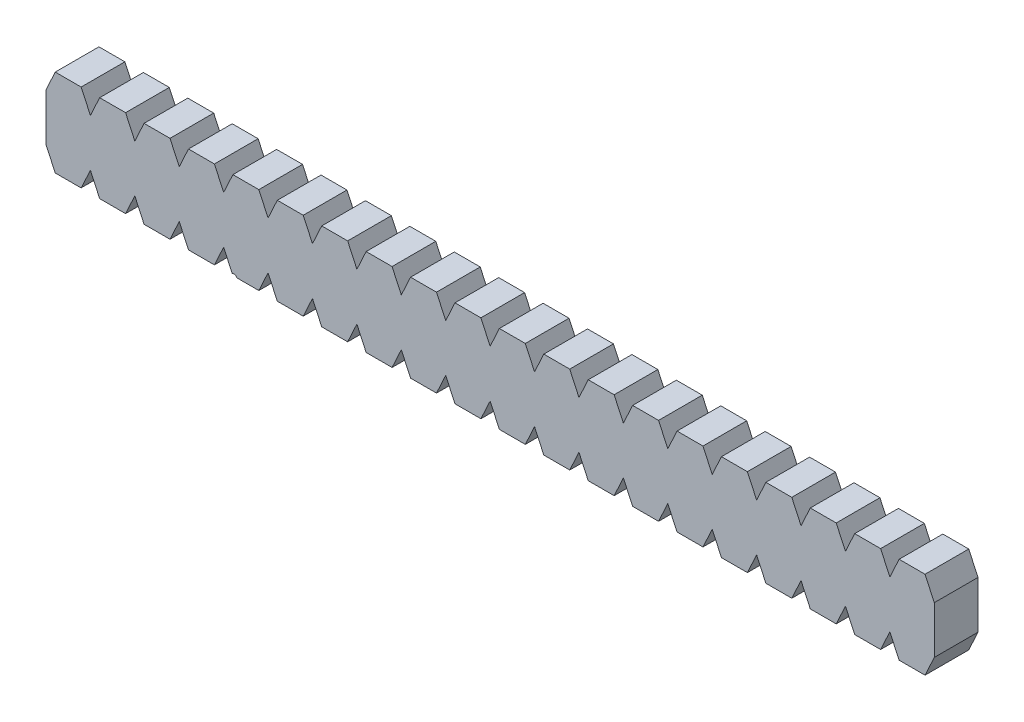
ISO-10303-21;
HEADER;
FILE_DESCRIPTION(('STEP AP214'),'2;1');
FILE_NAME('part.step','',(''),(''),'','','');
FILE_SCHEMA(('AUTOMOTIVE_DESIGN { 1 0 10303 214 1 1 1 1 }'));
ENDSEC;
DATA;
#1=APPLICATION_CONTEXT('core data for automotive mechanical design processes');
#2=APPLICATION_PROTOCOL_DEFINITION('international standard','automotive_design',2000,#1);
#3=PRODUCT_CONTEXT('',#1,'mechanical');
#4=PRODUCT('Part','Part','',(#3));
#5=PRODUCT_RELATED_PRODUCT_CATEGORY('part','',(#4));
#6=PRODUCT_DEFINITION_FORMATION('','',#4);
#7=PRODUCT_DEFINITION_CONTEXT('part definition',#1,'design');
#8=PRODUCT_DEFINITION('design','',#6,#7);
#9=PRODUCT_DEFINITION_SHAPE('','',#8);
#10=(LENGTH_UNIT() NAMED_UNIT(*) SI_UNIT(.MILLI.,.METRE.));
#11=(NAMED_UNIT(*) PLANE_ANGLE_UNIT() SI_UNIT($,.RADIAN.));
#12=(NAMED_UNIT(*) SI_UNIT($,.STERADIAN.) SOLID_ANGLE_UNIT());
#13=UNCERTAINTY_MEASURE_WITH_UNIT(LENGTH_MEASURE(1.E-05),#10,'distance_accuracy_value','');
#14=(GEOMETRIC_REPRESENTATION_CONTEXT(3) GLOBAL_UNCERTAINTY_ASSIGNED_CONTEXT((#13)) GLOBAL_UNIT_ASSIGNED_CONTEXT((#10,
#11,#12)) REPRESENTATION_CONTEXT('',''));
#15=CARTESIAN_POINT('',(0.,0.,0.));
#16=DIRECTION('',(0.,0.,1.));
#17=DIRECTION('',(1.,0.,0.));
#18=AXIS2_PLACEMENT_3D('',#15,#16,#17);
#19=CARTESIAN_POINT('',(-16.4746824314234,24.4016407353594,0.99));
#20=DIRECTION('',(0.907799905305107,-0.419403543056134,0.));
#21=DIRECTION('',(0.419403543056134,0.907799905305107,0.));
#22=AXIS2_PLACEMENT_3D('',#19,#20,#21);
#23=PLANE('',#22);
#24=DIRECTION('',(0.419403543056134,0.907799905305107,0.));
#25=VECTOR('',#24,1.);
#26=CARTESIAN_POINT('',(-16.4746824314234,24.4016407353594,1.));
#27=LINE('',#26,#25);
#28=CARTESIAN_POINT('',(-16.4704883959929,24.4107187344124,1.));
#29=VERTEX_POINT('',#28);
#30=CARTESIAN_POINT('',(-15.9419620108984,25.5547152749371,1.));
#31=VERTEX_POINT('',#30);
#32=EDGE_CURVE('E784',#29,#31,#27,.T.);
#33=ORIENTED_EDGE('',*,*,#32,.T.);
#34=DIRECTION('',(0.,0.,1.));
#35=VECTOR('',#34,1.);
#36=CARTESIAN_POINT('',(-15.9419620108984,25.5547152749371,0.99));
#37=LINE('',#36,#35);
#38=CARTESIAN_POINT('',(-15.9419620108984,25.5547152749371,3.5));
#39=VERTEX_POINT('',#38);
#40=EDGE_CURVE('E786',#39,#31,#37,.F.);
#41=ORIENTED_EDGE('',*,*,#40,.F.);
#42=DIRECTION('',(0.419403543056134,0.907799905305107,0.));
#43=VECTOR('',#42,1.);
#44=CARTESIAN_POINT('',(-16.4746824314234,24.4016407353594,3.5));
#45=LINE('',#44,#43);
#46=CARTESIAN_POINT('',(-16.4704883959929,24.4107187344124,3.5));
#47=VERTEX_POINT('',#46);
#48=EDGE_CURVE('E20',#39,#47,#45,.F.);
#49=ORIENTED_EDGE('',*,*,#48,.T.);
#50=DIRECTION('',(0.,0.,-1.));
#51=VECTOR('',#50,1.);
#52=CARTESIAN_POINT('',(-16.4704883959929,24.4107187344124,0.99));
#53=LINE('',#52,#51);
#54=EDGE_CURVE('E795',#29,#47,#53,.F.);
#55=ORIENTED_EDGE('',*,*,#54,.F.);
#56=EDGE_LOOP('',(#33,#41,#49,#55));
#57=FACE_BOUND('',#56,.T.);
#58=ADVANCED_FACE('F17',(#57),#23,.T.);
#59=CARTESIAN_POINT('',(-17.9634356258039,24.4107187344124,0.99));
#60=DIRECTION('',(0.,-1.,0.));
#61=DIRECTION('',(0.,0.,-1.));
#62=AXIS2_PLACEMENT_3D('',#59,#60,#61);
#63=PLANE('',#62);
#64=DIRECTION('',(1.,0.,0.));
#65=VECTOR('',#64,1.);
#66=CARTESIAN_POINT('',(-17.9634356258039,24.4107187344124,1.));
#67=LINE('',#66,#65);
#68=CARTESIAN_POINT('',(-17.9534356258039,24.4107187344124,1.));
#69=VERTEX_POINT('',#68);
#70=EDGE_CURVE('E797',#69,#29,#67,.T.);
#71=ORIENTED_EDGE('',*,*,#70,.T.);
#72=ORIENTED_EDGE('',*,*,#54,.T.);
#73=DIRECTION('',(1.,0.,0.));
#74=VECTOR('',#73,1.);
#75=CARTESIAN_POINT('',(-17.9634356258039,24.4107187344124,3.5));
#76=LINE('',#75,#74);
#77=CARTESIAN_POINT('',(-17.9534356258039,24.4107187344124,3.5));
#78=VERTEX_POINT('',#77);
#79=EDGE_CURVE('E780',#47,#78,#76,.F.);
#80=ORIENTED_EDGE('',*,*,#79,.T.);
#81=DIRECTION('',(0.,0.,1.));
#82=VECTOR('',#81,1.);
#83=CARTESIAN_POINT('',(-17.9534356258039,24.4107187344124,0.99));
#84=LINE('',#83,#82);
#85=EDGE_CURVE('E808',#69,#78,#84,.T.);
#86=ORIENTED_EDGE('',*,*,#85,.F.);
#87=EDGE_LOOP('',(#71,#72,#80,#86));
#88=FACE_BOUND('',#87,.T.);
#89=ADVANCED_FACE('F807',(#88),#63,.T.);
#90=CARTESIAN_POINT('',(-15.946156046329,25.5637932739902,0.99));
#91=DIRECTION('',(-0.907799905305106,-0.419403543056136,0.));
#92=DIRECTION('',(0.419403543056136,-0.907799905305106,0.));
#93=AXIS2_PLACEMENT_3D('',#90,#91,#92);
#94=PLANE('',#93);
#95=DIRECTION('',(0.419403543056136,-0.907799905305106,0.));
#96=VECTOR('',#95,1.);
#97=CARTESIAN_POINT('',(-15.946156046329,25.5637932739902,1.));
#98=LINE('',#97,#96);
#99=CARTESIAN_POINT('',(-15.4134356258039,24.4107187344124,1.));
#100=VERTEX_POINT('',#99);
#101=EDGE_CURVE('E789',#31,#100,#98,.T.);
#102=ORIENTED_EDGE('',*,*,#101,.T.);
#103=DIRECTION('',(0.,0.,-1.));
#104=VECTOR('',#103,1.);
#105=CARTESIAN_POINT('',(-15.4134356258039,24.4107187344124,0.99));
#106=LINE('',#105,#104);
#107=CARTESIAN_POINT('',(-15.4134356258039,24.4107187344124,3.5));
#108=VERTEX_POINT('',#107);
#109=EDGE_CURVE('E793',#108,#100,#106,.T.);
#110=ORIENTED_EDGE('',*,*,#109,.F.);
#111=DIRECTION('',(0.419403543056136,-0.907799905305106,0.));
#112=VECTOR('',#111,1.);
#113=CARTESIAN_POINT('',(-15.946156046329,25.5637932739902,3.5));
#114=LINE('',#113,#112);
#115=EDGE_CURVE('E777',#108,#39,#114,.F.);
#116=ORIENTED_EDGE('',*,*,#115,.T.);
#117=ORIENTED_EDGE('',*,*,#40,.T.);
#118=EDGE_LOOP('',(#102,#110,#116,#117));
#119=FACE_BOUND('',#118,.T.);
#120=ADVANCED_FACE('F791',(#119),#94,.T.);
#121=CARTESIAN_POINT('',(-15.4092415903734,29.4197967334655,0.99));
#122=DIRECTION('',(-0.90779990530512,0.419403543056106,0.));
#123=DIRECTION('',(-0.419403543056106,-0.90779990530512,0.));
#124=AXIS2_PLACEMENT_3D('',#121,#122,#123);
#125=PLANE('',#124);
#126=DIRECTION('',(-0.419403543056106,-0.90779990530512,0.));
#127=VECTOR('',#126,1.);
#128=CARTESIAN_POINT('',(-15.4092415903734,29.4197967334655,1.));
#129=LINE('',#128,#127);
#130=CARTESIAN_POINT('',(-15.413435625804,29.4107187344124,1.));
#131=VERTEX_POINT('',#130);
#132=CARTESIAN_POINT('',(-15.9419620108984,28.2667221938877,1.));
#133=VERTEX_POINT('',#132);
#134=EDGE_CURVE('E1588',#131,#133,#129,.T.);
#135=ORIENTED_EDGE('',*,*,#134,.T.);
#136=DIRECTION('',(0.,0.,1.));
#137=VECTOR('',#136,1.);
#138=CARTESIAN_POINT('',(-15.9419620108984,28.2667221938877,0.99));
#139=LINE('',#138,#137);
#140=CARTESIAN_POINT('',(-15.9419620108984,28.2667221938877,3.5));
#141=VERTEX_POINT('',#140);
#142=EDGE_CURVE('E824',#141,#133,#139,.F.);
#143=ORIENTED_EDGE('',*,*,#142,.F.);
#144=DIRECTION('',(-0.419403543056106,-0.90779990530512,0.));
#145=VECTOR('',#144,1.);
#146=CARTESIAN_POINT('',(-15.4092415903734,29.4197967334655,3.5));
#147=LINE('',#146,#145);
#148=CARTESIAN_POINT('',(-15.413435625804,29.4107187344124,3.5));
#149=VERTEX_POINT('',#148);
#150=EDGE_CURVE('E1589',#141,#149,#147,.F.);
#151=ORIENTED_EDGE('',*,*,#150,.T.);
#152=DIRECTION('',(0.,0.,1.));
#153=VECTOR('',#152,1.);
#154=CARTESIAN_POINT('',(-15.413435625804,29.4107187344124,0.99));
#155=LINE('',#154,#153);
#156=EDGE_CURVE('E1575',#131,#149,#155,.T.);
#157=ORIENTED_EDGE('',*,*,#156,.F.);
#158=EDGE_LOOP('',(#135,#143,#151,#157));
#159=FACE_BOUND('',#158,.T.);
#160=ADVANCED_FACE('F1955',(#159),#125,.T.);
#161=CARTESIAN_POINT('',(-15.9377679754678,28.2576441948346,0.99));
#162=DIRECTION('',(0.907799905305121,0.419403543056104,0.));
#163=DIRECTION('',(-0.419403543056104,0.907799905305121,0.));
#164=AXIS2_PLACEMENT_3D('',#161,#162,#163);
#165=PLANE('',#164);
#166=DIRECTION('',(-0.419403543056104,0.907799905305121,0.));
#167=VECTOR('',#166,1.);
#168=CARTESIAN_POINT('',(-15.9377679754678,28.2576441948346,1.));
#169=LINE('',#168,#167);
#170=CARTESIAN_POINT('',(-16.4704883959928,29.4107187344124,1.));
#171=VERTEX_POINT('',#170);
#172=EDGE_CURVE('E826',#133,#171,#169,.T.);
#173=ORIENTED_EDGE('',*,*,#172,.T.);
#174=DIRECTION('',(0.,0.,1.));
#175=VECTOR('',#174,1.);
#176=CARTESIAN_POINT('',(-16.4704883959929,29.4107187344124,0.99));
#177=LINE('',#176,#175);
#178=CARTESIAN_POINT('',(-16.4704883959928,29.4107187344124,3.5));
#179=VERTEX_POINT('',#178);
#180=EDGE_CURVE('E1571',#179,#171,#177,.F.);
#181=ORIENTED_EDGE('',*,*,#180,.F.);
#182=DIRECTION('',(-0.419403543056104,0.907799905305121,0.));
#183=VECTOR('',#182,1.);
#184=CARTESIAN_POINT('',(-15.9377679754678,28.2576441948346,3.5));
#185=LINE('',#184,#183);
#186=EDGE_CURVE('E827',#179,#141,#185,.F.);
#187=ORIENTED_EDGE('',*,*,#186,.T.);
#188=ORIENTED_EDGE('',*,*,#142,.T.);
#189=EDGE_LOOP('',(#173,#181,#187,#188));
#190=FACE_BOUND('',#189,.T.);
#191=ADVANCED_FACE('F1961',(#190),#165,.T.);
#192=CARTESIAN_POINT('',(-18.486156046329,25.5637932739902,0.99));
#193=DIRECTION('',(-0.907799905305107,-0.419403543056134,0.));
#194=DIRECTION('',(0.419403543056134,-0.907799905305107,0.));
#195=AXIS2_PLACEMENT_3D('',#192,#193,#194);
#196=PLANE('',#195);
#197=DIRECTION('',(0.419403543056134,-0.907799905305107,0.));
#198=VECTOR('',#197,1.);
#199=CARTESIAN_POINT('',(-18.486156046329,25.5637932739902,1.));
#200=LINE('',#199,#198);
#201=CARTESIAN_POINT('',(-18.4819620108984,25.5547152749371,1.));
#202=VERTEX_POINT('',#201);
#203=EDGE_CURVE('E816',#202,#69,#200,.T.);
#204=ORIENTED_EDGE('',*,*,#203,.T.);
#205=ORIENTED_EDGE('',*,*,#85,.T.);
#206=DIRECTION('',(0.419403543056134,-0.907799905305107,0.));
#207=VECTOR('',#206,1.);
#208=CARTESIAN_POINT('',(-18.486156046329,25.5637932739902,3.5));
#209=LINE('',#208,#207);
#210=CARTESIAN_POINT('',(-18.4819620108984,25.5547152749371,3.5));
#211=VERTEX_POINT('',#210);
#212=EDGE_CURVE('E814',#78,#211,#209,.F.);
#213=ORIENTED_EDGE('',*,*,#212,.T.);
#214=DIRECTION('',(0.,0.,1.));
#215=VECTOR('',#214,1.);
#216=CARTESIAN_POINT('',(-18.4819620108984,25.5547152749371,0.99));
#217=LINE('',#216,#215);
#218=EDGE_CURVE('E1562',#202,#211,#217,.T.);
#219=ORIENTED_EDGE('',*,*,#218,.F.);
#220=EDGE_LOOP('',(#204,#205,#213,#219));
#221=FACE_BOUND('',#220,.T.);
#222=ADVANCED_FACE('F812',(#221),#196,.T.);
#223=CARTESIAN_POINT('',(-15.423435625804,24.4107187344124,0.99));
#224=DIRECTION('',(0.,-1.,0.));
#225=DIRECTION('',(0.,0.,-1.));
#226=AXIS2_PLACEMENT_3D('',#223,#224,#225);
#227=PLANE('',#226);
#228=DIRECTION('',(1.,0.,0.));
#229=VECTOR('',#228,1.);
#230=CARTESIAN_POINT('',(-15.423435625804,24.4107187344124,1.));
#231=LINE('',#230,#229);
#232=CARTESIAN_POINT('',(-13.9304883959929,24.4107187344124,1.));
#233=VERTEX_POINT('',#232);
#234=EDGE_CURVE('E1582',#100,#233,#231,.T.);
#235=ORIENTED_EDGE('',*,*,#234,.T.);
#236=DIRECTION('',(0.,0.,1.));
#237=VECTOR('',#236,1.);
#238=CARTESIAN_POINT('',(-13.9304883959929,24.4107187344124,0.99));
#239=LINE('',#238,#237);
#240=CARTESIAN_POINT('',(-13.9304883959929,24.4107187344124,3.5));
#241=VERTEX_POINT('',#240);
#242=EDGE_CURVE('E1558',#241,#233,#239,.F.);
#243=ORIENTED_EDGE('',*,*,#242,.F.);
#244=DIRECTION('',(1.,0.,0.));
#245=VECTOR('',#244,1.);
#246=CARTESIAN_POINT('',(-15.423435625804,24.4107187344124,3.5));
#247=LINE('',#246,#245);
#248=EDGE_CURVE('E817',#241,#108,#247,.F.);
#249=ORIENTED_EDGE('',*,*,#248,.T.);
#250=ORIENTED_EDGE('',*,*,#109,.T.);
#251=EDGE_LOOP('',(#235,#243,#249,#250));
#252=FACE_BOUND('',#251,.T.);
#253=ADVANCED_FACE('F1603',(#252),#227,.T.);
#254=CARTESIAN_POINT('',(-13.9204883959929,29.4107187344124,0.99));
#255=DIRECTION('',(0.,1.,0.));
#256=DIRECTION('',(0.,0.,1.));
#257=AXIS2_PLACEMENT_3D('',#254,#255,#256);
#258=PLANE('',#257);
#259=DIRECTION('',(1.,0.,0.));
#260=VECTOR('',#259,1.);
#261=CARTESIAN_POINT('',(-13.9204883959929,29.4107187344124,1.));
#262=LINE('',#261,#260);
#263=CARTESIAN_POINT('',(-13.9304883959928,29.4107187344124,1.));
#264=VERTEX_POINT('',#263);
#265=EDGE_CURVE('E1576',#264,#131,#262,.F.);
#266=ORIENTED_EDGE('',*,*,#265,.T.);
#267=ORIENTED_EDGE('',*,*,#156,.T.);
#268=DIRECTION('',(1.,0.,0.));
#269=VECTOR('',#268,1.);
#270=CARTESIAN_POINT('',(-13.9204883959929,29.4107187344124,3.5));
#271=LINE('',#270,#269);
#272=CARTESIAN_POINT('',(-13.9304883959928,29.4107187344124,3.5));
#273=VERTEX_POINT('',#272);
#274=EDGE_CURVE('E1579',#149,#273,#271,.T.);
#275=ORIENTED_EDGE('',*,*,#274,.T.);
#276=DIRECTION('',(0.,0.,1.));
#277=VECTOR('',#276,1.);
#278=CARTESIAN_POINT('',(-13.9304883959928,29.4107187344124,0.99));
#279=LINE('',#278,#277);
#280=EDGE_CURVE('E1549',#264,#273,#279,.T.);
#281=ORIENTED_EDGE('',*,*,#280,.F.);
#282=EDGE_LOOP('',(#266,#267,#275,#281));
#283=FACE_BOUND('',#282,.T.);
#284=ADVANCED_FACE('F1953',(#283),#258,.T.);
#285=CARTESIAN_POINT('',(-16.4604883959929,29.4107187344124,0.99));
#286=DIRECTION('',(0.,1.,0.));
#287=DIRECTION('',(0.,0.,1.));
#288=AXIS2_PLACEMENT_3D('',#285,#286,#287);
#289=PLANE('',#288);
#290=DIRECTION('',(1.,0.,0.));
#291=VECTOR('',#290,1.);
#292=CARTESIAN_POINT('',(-16.4604883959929,29.4107187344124,1.));
#293=LINE('',#292,#291);
#294=CARTESIAN_POINT('',(-17.953435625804,29.4107187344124,1.));
#295=VERTEX_POINT('',#294);
#296=EDGE_CURVE('E1569',#171,#295,#293,.F.);
#297=ORIENTED_EDGE('',*,*,#296,.T.);
#298=DIRECTION('',(0.,0.,1.));
#299=VECTOR('',#298,1.);
#300=CARTESIAN_POINT('',(-17.953435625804,29.4107187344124,0.99));
#301=LINE('',#300,#299);
#302=CARTESIAN_POINT('',(-17.953435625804,29.4107187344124,3.5));
#303=VERTEX_POINT('',#302);
#304=EDGE_CURVE('E1545',#303,#295,#301,.F.);
#305=ORIENTED_EDGE('',*,*,#304,.F.);
#306=DIRECTION('',(1.,0.,0.));
#307=VECTOR('',#306,1.);
#308=CARTESIAN_POINT('',(-16.4604883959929,29.4107187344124,3.5));
#309=LINE('',#308,#307);
#310=EDGE_CURVE('E1572',#303,#179,#309,.T.);
#311=ORIENTED_EDGE('',*,*,#310,.T.);
#312=ORIENTED_EDGE('',*,*,#180,.T.);
#313=EDGE_LOOP('',(#297,#305,#311,#312));
#314=FACE_BOUND('',#313,.T.);
#315=ADVANCED_FACE('F2992',(#314),#289,.T.);
#316=CARTESIAN_POINT('',(-19.0146824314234,24.4016407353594,0.99));
#317=DIRECTION('',(0.907799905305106,-0.419403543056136,0.));
#318=DIRECTION('',(0.419403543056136,0.907799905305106,0.));
#319=AXIS2_PLACEMENT_3D('',#316,#317,#318);
#320=PLANE('',#319);
#321=DIRECTION('',(0.419403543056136,0.907799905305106,0.));
#322=VECTOR('',#321,1.);
#323=CARTESIAN_POINT('',(-19.0146824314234,24.4016407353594,1.));
#324=LINE('',#323,#322);
#325=CARTESIAN_POINT('',(-19.0104883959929,24.4107187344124,1.));
#326=VERTEX_POINT('',#325);
#327=EDGE_CURVE('E1563',#326,#202,#324,.T.);
#328=ORIENTED_EDGE('',*,*,#327,.T.);
#329=ORIENTED_EDGE('',*,*,#218,.T.);
#330=DIRECTION('',(0.419403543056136,0.907799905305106,0.));
#331=VECTOR('',#330,1.);
#332=CARTESIAN_POINT('',(-19.0146824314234,24.4016407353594,3.5));
#333=LINE('',#332,#331);
#334=CARTESIAN_POINT('',(-19.0104883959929,24.4107187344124,3.5));
#335=VERTEX_POINT('',#334);
#336=EDGE_CURVE('E1566',#211,#335,#333,.F.);
#337=ORIENTED_EDGE('',*,*,#336,.T.);
#338=DIRECTION('',(0.,0.,-1.));
#339=VECTOR('',#338,1.);
#340=CARTESIAN_POINT('',(-19.0104883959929,24.4107187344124,0.99));
#341=LINE('',#340,#339);
#342=EDGE_CURVE('E1536',#326,#335,#341,.F.);
#343=ORIENTED_EDGE('',*,*,#342,.F.);
#344=EDGE_LOOP('',(#328,#329,#337,#343));
#345=FACE_BOUND('',#344,.T.);
#346=ADVANCED_FACE('F2984',(#345),#320,.T.);
#347=CARTESIAN_POINT('',(-13.9346824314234,24.4016407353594,0.99));
#348=DIRECTION('',(0.907799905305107,-0.419403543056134,0.));
#349=DIRECTION('',(0.419403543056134,0.907799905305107,0.));
#350=AXIS2_PLACEMENT_3D('',#347,#348,#349);
#351=PLANE('',#350);
#352=DIRECTION('',(0.419403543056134,0.907799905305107,0.));
#353=VECTOR('',#352,1.);
#354=CARTESIAN_POINT('',(-13.9346824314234,24.4016407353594,1.));
#355=LINE('',#354,#353);
#356=CARTESIAN_POINT('',(-13.4019620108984,25.5547152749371,1.));
#357=VERTEX_POINT('',#356);
#358=EDGE_CURVE('E1556',#233,#357,#355,.T.);
#359=ORIENTED_EDGE('',*,*,#358,.T.);
#360=DIRECTION('',(0.,0.,1.));
#361=VECTOR('',#360,1.);
#362=CARTESIAN_POINT('',(-13.4019620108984,25.5547152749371,0.99));
#363=LINE('',#362,#361);
#364=CARTESIAN_POINT('',(-13.4019620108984,25.5547152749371,3.5));
#365=VERTEX_POINT('',#364);
#366=EDGE_CURVE('E1532',#365,#357,#363,.F.);
#367=ORIENTED_EDGE('',*,*,#366,.F.);
#368=DIRECTION('',(0.419403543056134,0.907799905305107,0.));
#369=VECTOR('',#368,1.);
#370=CARTESIAN_POINT('',(-13.9346824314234,24.4016407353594,3.5));
#371=LINE('',#370,#369);
#372=EDGE_CURVE('E1559',#365,#241,#371,.F.);
#373=ORIENTED_EDGE('',*,*,#372,.T.);
#374=ORIENTED_EDGE('',*,*,#242,.T.);
#375=EDGE_LOOP('',(#359,#367,#373,#374));
#376=FACE_BOUND('',#375,.T.);
#377=ADVANCED_FACE('F1608',(#376),#351,.T.);
#378=CARTESIAN_POINT('',(-13.3977679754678,28.2576441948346,0.99));
#379=DIRECTION('',(0.907799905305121,0.419403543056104,0.));
#380=DIRECTION('',(-0.419403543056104,0.907799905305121,0.));
#381=AXIS2_PLACEMENT_3D('',#378,#379,#380);
#382=PLANE('',#381);
#383=DIRECTION('',(-0.419403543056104,0.907799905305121,0.));
#384=VECTOR('',#383,1.);
#385=CARTESIAN_POINT('',(-13.3977679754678,28.2576441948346,1.));
#386=LINE('',#385,#384);
#387=CARTESIAN_POINT('',(-13.4019620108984,28.2667221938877,1.));
#388=VERTEX_POINT('',#387);
#389=EDGE_CURVE('E1550',#388,#264,#386,.T.);
#390=ORIENTED_EDGE('',*,*,#389,.T.);
#391=ORIENTED_EDGE('',*,*,#280,.T.);
#392=DIRECTION('',(-0.419403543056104,0.907799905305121,0.));
#393=VECTOR('',#392,1.);
#394=CARTESIAN_POINT('',(-13.3977679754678,28.2576441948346,3.5));
#395=LINE('',#394,#393);
#396=CARTESIAN_POINT('',(-13.4019620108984,28.2667221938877,3.5));
#397=VERTEX_POINT('',#396);
#398=EDGE_CURVE('E1553',#273,#397,#395,.F.);
#399=ORIENTED_EDGE('',*,*,#398,.T.);
#400=DIRECTION('',(0.,0.,1.));
#401=VECTOR('',#400,1.);
#402=CARTESIAN_POINT('',(-13.4019620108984,28.2667221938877,0.99));
#403=LINE('',#402,#401);
#404=EDGE_CURVE('E1523',#388,#397,#403,.T.);
#405=ORIENTED_EDGE('',*,*,#404,.F.);
#406=EDGE_LOOP('',(#390,#391,#399,#405));
#407=FACE_BOUND('',#406,.T.);
#408=ADVANCED_FACE('F1965',(#407),#382,.T.);
#409=CARTESIAN_POINT('',(-17.9492415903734,29.4197967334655,0.99));
#410=DIRECTION('',(-0.907799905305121,0.419403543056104,0.));
#411=DIRECTION('',(-0.419403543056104,-0.907799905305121,0.));
#412=AXIS2_PLACEMENT_3D('',#409,#410,#411);
#413=PLANE('',#412);
#414=DIRECTION('',(-0.419403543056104,-0.907799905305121,0.));
#415=VECTOR('',#414,1.);
#416=CARTESIAN_POINT('',(-17.9492415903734,29.4197967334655,1.));
#417=LINE('',#416,#415);
#418=CARTESIAN_POINT('',(-18.4819620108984,28.2667221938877,1.));
#419=VERTEX_POINT('',#418);
#420=EDGE_CURVE('E1543',#295,#419,#417,.T.);
#421=ORIENTED_EDGE('',*,*,#420,.T.);
#422=DIRECTION('',(0.,0.,1.));
#423=VECTOR('',#422,1.);
#424=CARTESIAN_POINT('',(-18.4819620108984,28.2667221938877,0.99));
#425=LINE('',#424,#423);
#426=CARTESIAN_POINT('',(-18.4819620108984,28.2667221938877,3.5));
#427=VERTEX_POINT('',#426);
#428=EDGE_CURVE('E1519',#427,#419,#425,.F.);
#429=ORIENTED_EDGE('',*,*,#428,.F.);
#430=DIRECTION('',(-0.419403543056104,-0.907799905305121,0.));
#431=VECTOR('',#430,1.);
#432=CARTESIAN_POINT('',(-17.9492415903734,29.4197967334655,3.5));
#433=LINE('',#432,#431);
#434=EDGE_CURVE('E1546',#427,#303,#433,.F.);
#435=ORIENTED_EDGE('',*,*,#434,.T.);
#436=ORIENTED_EDGE('',*,*,#304,.T.);
#437=EDGE_LOOP('',(#421,#429,#435,#436));
#438=FACE_BOUND('',#437,.T.);
#439=ADVANCED_FACE('F2960',(#438),#413,.T.);
#440=CARTESIAN_POINT('',(-20.5034356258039,24.4107187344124,0.99));
#441=DIRECTION('',(0.,-1.,0.));
#442=DIRECTION('',(0.,0.,-1.));
#443=AXIS2_PLACEMENT_3D('',#440,#441,#442);
#444=PLANE('',#443);
#445=DIRECTION('',(1.,0.,0.));
#446=VECTOR('',#445,1.);
#447=CARTESIAN_POINT('',(-20.5034356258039,24.4107187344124,1.));
#448=LINE('',#447,#446);
#449=CARTESIAN_POINT('',(-20.4934356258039,24.4107187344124,1.));
#450=VERTEX_POINT('',#449);
#451=EDGE_CURVE('E1537',#450,#326,#448,.T.);
#452=ORIENTED_EDGE('',*,*,#451,.T.);
#453=ORIENTED_EDGE('',*,*,#342,.T.);
#454=DIRECTION('',(1.,0.,0.));
#455=VECTOR('',#454,1.);
#456=CARTESIAN_POINT('',(-20.5034356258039,24.4107187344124,3.5));
#457=LINE('',#456,#455);
#458=CARTESIAN_POINT('',(-20.4934356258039,24.4107187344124,3.5));
#459=VERTEX_POINT('',#458);
#460=EDGE_CURVE('E1540',#335,#459,#457,.F.);
#461=ORIENTED_EDGE('',*,*,#460,.T.);
#462=DIRECTION('',(0.,0.,1.));
#463=VECTOR('',#462,1.);
#464=CARTESIAN_POINT('',(-20.4934356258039,24.4107187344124,0.99));
#465=LINE('',#464,#463);
#466=EDGE_CURVE('E1510',#450,#459,#465,.T.);
#467=ORIENTED_EDGE('',*,*,#466,.F.);
#468=EDGE_LOOP('',(#452,#453,#461,#467));
#469=FACE_BOUND('',#468,.T.);
#470=ADVANCED_FACE('F2952',(#469),#444,.T.);
#471=CARTESIAN_POINT('',(-13.406156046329,25.5637932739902,0.99));
#472=DIRECTION('',(-0.907799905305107,-0.419403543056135,0.));
#473=DIRECTION('',(0.419403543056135,-0.907799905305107,0.));
#474=AXIS2_PLACEMENT_3D('',#471,#472,#473);
#475=PLANE('',#474);
#476=DIRECTION('',(0.419403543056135,-0.907799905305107,0.));
#477=VECTOR('',#476,1.);
#478=CARTESIAN_POINT('',(-13.406156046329,25.5637932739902,1.));
#479=LINE('',#478,#477);
#480=CARTESIAN_POINT('',(-12.8734356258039,24.4107187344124,1.));
#481=VERTEX_POINT('',#480);
#482=EDGE_CURVE('E1530',#357,#481,#479,.T.);
#483=ORIENTED_EDGE('',*,*,#482,.T.);
#484=DIRECTION('',(0.,0.,-1.));
#485=VECTOR('',#484,1.);
#486=CARTESIAN_POINT('',(-12.8734356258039,24.4107187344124,0.99));
#487=LINE('',#486,#485);
#488=CARTESIAN_POINT('',(-12.8734356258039,24.4107187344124,3.5));
#489=VERTEX_POINT('',#488);
#490=EDGE_CURVE('E1506',#489,#481,#487,.T.);
#491=ORIENTED_EDGE('',*,*,#490,.F.);
#492=DIRECTION('',(0.419403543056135,-0.907799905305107,0.));
#493=VECTOR('',#492,1.);
#494=CARTESIAN_POINT('',(-13.406156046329,25.5637932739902,3.5));
#495=LINE('',#494,#493);
#496=EDGE_CURVE('E1533',#489,#365,#495,.F.);
#497=ORIENTED_EDGE('',*,*,#496,.T.);
#498=ORIENTED_EDGE('',*,*,#366,.T.);
#499=EDGE_LOOP('',(#483,#491,#497,#498));
#500=FACE_BOUND('',#499,.T.);
#501=ADVANCED_FACE('F1611',(#500),#475,.T.);
#502=CARTESIAN_POINT('',(-12.8692415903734,29.4197967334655,0.99));
#503=DIRECTION('',(-0.907799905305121,0.419403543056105,0.));
#504=DIRECTION('',(-0.419403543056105,-0.907799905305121,0.));
#505=AXIS2_PLACEMENT_3D('',#502,#503,#504);
#506=PLANE('',#505);
#507=DIRECTION('',(-0.419403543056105,-0.907799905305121,0.));
#508=VECTOR('',#507,1.);
#509=CARTESIAN_POINT('',(-12.8692415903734,29.4197967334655,1.));
#510=LINE('',#509,#508);
#511=CARTESIAN_POINT('',(-12.873435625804,29.4107187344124,1.));
#512=VERTEX_POINT('',#511);
#513=EDGE_CURVE('E1524',#512,#388,#510,.T.);
#514=ORIENTED_EDGE('',*,*,#513,.T.);
#515=ORIENTED_EDGE('',*,*,#404,.T.);
#516=DIRECTION('',(-0.419403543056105,-0.907799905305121,0.));
#517=VECTOR('',#516,1.);
#518=CARTESIAN_POINT('',(-12.8692415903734,29.4197967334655,3.5));
#519=LINE('',#518,#517);
#520=CARTESIAN_POINT('',(-12.873435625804,29.4107187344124,3.5));
#521=VERTEX_POINT('',#520);
#522=EDGE_CURVE('E1527',#397,#521,#519,.F.);
#523=ORIENTED_EDGE('',*,*,#522,.T.);
#524=DIRECTION('',(0.,0.,1.));
#525=VECTOR('',#524,1.);
#526=CARTESIAN_POINT('',(-12.8734356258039,29.4107187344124,0.99));
#527=LINE('',#526,#525);
#528=EDGE_CURVE('E1497',#512,#521,#527,.T.);
#529=ORIENTED_EDGE('',*,*,#528,.F.);
#530=EDGE_LOOP('',(#514,#515,#523,#529));
#531=FACE_BOUND('',#530,.T.);
#532=ADVANCED_FACE('F1967',(#531),#506,.T.);
#533=CARTESIAN_POINT('',(-18.4777679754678,28.2576441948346,0.99));
#534=DIRECTION('',(0.90779990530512,0.419403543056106,0.));
#535=DIRECTION('',(-0.419403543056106,0.90779990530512,0.));
#536=AXIS2_PLACEMENT_3D('',#533,#534,#535);
#537=PLANE('',#536);
#538=DIRECTION('',(-0.419403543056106,0.90779990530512,0.));
#539=VECTOR('',#538,1.);
#540=CARTESIAN_POINT('',(-18.4777679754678,28.2576441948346,1.));
#541=LINE('',#540,#539);
#542=CARTESIAN_POINT('',(-19.0104883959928,29.4107187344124,1.));
#543=VERTEX_POINT('',#542);
#544=EDGE_CURVE('E1517',#419,#543,#541,.T.);
#545=ORIENTED_EDGE('',*,*,#544,.T.);
#546=DIRECTION('',(0.,0.,1.));
#547=VECTOR('',#546,1.);
#548=CARTESIAN_POINT('',(-19.0104883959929,29.4107187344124,0.99));
#549=LINE('',#548,#547);
#550=CARTESIAN_POINT('',(-19.0104883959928,29.4107187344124,3.5));
#551=VERTEX_POINT('',#550);
#552=EDGE_CURVE('E1493',#551,#543,#549,.F.);
#553=ORIENTED_EDGE('',*,*,#552,.F.);
#554=DIRECTION('',(-0.419403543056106,0.90779990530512,0.));
#555=VECTOR('',#554,1.);
#556=CARTESIAN_POINT('',(-18.4777679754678,28.2576441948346,3.5));
#557=LINE('',#556,#555);
#558=EDGE_CURVE('E1520',#551,#427,#557,.F.);
#559=ORIENTED_EDGE('',*,*,#558,.T.);
#560=ORIENTED_EDGE('',*,*,#428,.T.);
#561=EDGE_LOOP('',(#545,#553,#559,#560));
#562=FACE_BOUND('',#561,.T.);
#563=ADVANCED_FACE('F2928',(#562),#537,.T.);
#564=CARTESIAN_POINT('',(-21.026156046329,25.5637932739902,0.99));
#565=DIRECTION('',(-0.907799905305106,-0.419403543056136,0.));
#566=DIRECTION('',(0.419403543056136,-0.907799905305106,0.));
#567=AXIS2_PLACEMENT_3D('',#564,#565,#566);
#568=PLANE('',#567);
#569=DIRECTION('',(0.419403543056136,-0.907799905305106,0.));
#570=VECTOR('',#569,1.);
#571=CARTESIAN_POINT('',(-21.026156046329,25.5637932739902,1.));
#572=LINE('',#571,#570);
#573=CARTESIAN_POINT('',(-21.0219620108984,25.5547152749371,1.));
#574=VERTEX_POINT('',#573);
#575=EDGE_CURVE('E1511',#574,#450,#572,.T.);
#576=ORIENTED_EDGE('',*,*,#575,.T.);
#577=ORIENTED_EDGE('',*,*,#466,.T.);
#578=DIRECTION('',(0.419403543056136,-0.907799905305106,0.));
#579=VECTOR('',#578,1.);
#580=CARTESIAN_POINT('',(-21.026156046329,25.5637932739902,3.5));
#581=LINE('',#580,#579);
#582=CARTESIAN_POINT('',(-21.0219620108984,25.5547152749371,3.5));
#583=VERTEX_POINT('',#582);
#584=EDGE_CURVE('E1514',#459,#583,#581,.F.);
#585=ORIENTED_EDGE('',*,*,#584,.T.);
#586=DIRECTION('',(0.,0.,1.));
#587=VECTOR('',#586,1.);
#588=CARTESIAN_POINT('',(-21.0219620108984,25.5547152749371,0.99));
#589=LINE('',#588,#587);
#590=EDGE_CURVE('E1484',#574,#583,#589,.T.);
#591=ORIENTED_EDGE('',*,*,#590,.F.);
#592=EDGE_LOOP('',(#576,#577,#585,#591));
#593=FACE_BOUND('',#592,.T.);
#594=ADVANCED_FACE('F2920',(#593),#568,.T.);
#595=CARTESIAN_POINT('',(-12.8834356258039,24.4107187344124,0.99));
#596=DIRECTION('',(0.,-1.,0.));
#597=DIRECTION('',(0.,0.,-1.));
#598=AXIS2_PLACEMENT_3D('',#595,#596,#597);
#599=PLANE('',#598);
#600=DIRECTION('',(1.,0.,0.));
#601=VECTOR('',#600,1.);
#602=CARTESIAN_POINT('',(-12.8834356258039,24.4107187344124,1.));
#603=LINE('',#602,#601);
#604=CARTESIAN_POINT('',(-11.3904883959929,24.4107187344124,1.));
#605=VERTEX_POINT('',#604);
#606=EDGE_CURVE('E1504',#481,#605,#603,.T.);
#607=ORIENTED_EDGE('',*,*,#606,.T.);
#608=DIRECTION('',(0.,0.,1.));
#609=VECTOR('',#608,1.);
#610=CARTESIAN_POINT('',(-11.3904883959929,24.4107187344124,0.99));
#611=LINE('',#610,#609);
#612=CARTESIAN_POINT('',(-11.3904883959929,24.4107187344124,3.5));
#613=VERTEX_POINT('',#612);
#614=EDGE_CURVE('E1480',#613,#605,#611,.F.);
#615=ORIENTED_EDGE('',*,*,#614,.F.);
#616=DIRECTION('',(1.,0.,0.));
#617=VECTOR('',#616,1.);
#618=CARTESIAN_POINT('',(-12.8834356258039,24.4107187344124,3.5));
#619=LINE('',#618,#617);
#620=EDGE_CURVE('E1507',#613,#489,#619,.F.);
#621=ORIENTED_EDGE('',*,*,#620,.T.);
#622=ORIENTED_EDGE('',*,*,#490,.T.);
#623=EDGE_LOOP('',(#607,#615,#621,#622));
#624=FACE_BOUND('',#623,.T.);
#625=ADVANCED_FACE('F1617',(#624),#599,.T.);
#626=CARTESIAN_POINT('',(-11.3804883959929,29.4107187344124,0.99));
#627=DIRECTION('',(0.,1.,0.));
#628=DIRECTION('',(0.,0.,1.));
#629=AXIS2_PLACEMENT_3D('',#626,#627,#628);
#630=PLANE('',#629);
#631=DIRECTION('',(1.,0.,0.));
#632=VECTOR('',#631,1.);
#633=CARTESIAN_POINT('',(-11.3804883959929,29.4107187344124,1.));
#634=LINE('',#633,#632);
#635=CARTESIAN_POINT('',(-11.3904883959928,29.4107187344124,1.));
#636=VERTEX_POINT('',#635);
#637=EDGE_CURVE('E1498',#636,#512,#634,.F.);
#638=ORIENTED_EDGE('',*,*,#637,.T.);
#639=ORIENTED_EDGE('',*,*,#528,.T.);
#640=DIRECTION('',(1.,0.,0.));
#641=VECTOR('',#640,1.);
#642=CARTESIAN_POINT('',(-11.3804883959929,29.4107187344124,3.5));
#643=LINE('',#642,#641);
#644=CARTESIAN_POINT('',(-11.3904883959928,29.4107187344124,3.5));
#645=VERTEX_POINT('',#644);
#646=EDGE_CURVE('E1501',#521,#645,#643,.T.);
#647=ORIENTED_EDGE('',*,*,#646,.T.);
#648=DIRECTION('',(0.,0.,1.));
#649=VECTOR('',#648,1.);
#650=CARTESIAN_POINT('',(-11.3904883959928,29.4107187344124,0.99));
#651=LINE('',#650,#649);
#652=EDGE_CURVE('E1471',#636,#645,#651,.T.);
#653=ORIENTED_EDGE('',*,*,#652,.F.);
#654=EDGE_LOOP('',(#638,#639,#647,#653));
#655=FACE_BOUND('',#654,.T.);
#656=ADVANCED_FACE('F1972',(#655),#630,.T.);
#657=CARTESIAN_POINT('',(-19.0004883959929,29.4107187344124,0.99));
#658=DIRECTION('',(0.,1.,0.));
#659=DIRECTION('',(0.,0.,1.));
#660=AXIS2_PLACEMENT_3D('',#657,#658,#659);
#661=PLANE('',#660);
#662=DIRECTION('',(1.,0.,0.));
#663=VECTOR('',#662,1.);
#664=CARTESIAN_POINT('',(-19.0004883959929,29.4107187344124,1.));
#665=LINE('',#664,#663);
#666=CARTESIAN_POINT('',(-20.493435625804,29.4107187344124,1.));
#667=VERTEX_POINT('',#666);
#668=EDGE_CURVE('E1491',#543,#667,#665,.F.);
#669=ORIENTED_EDGE('',*,*,#668,.T.);
#670=DIRECTION('',(0.,0.,1.));
#671=VECTOR('',#670,1.);
#672=CARTESIAN_POINT('',(-20.493435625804,29.4107187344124,0.99));
#673=LINE('',#672,#671);
#674=CARTESIAN_POINT('',(-20.493435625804,29.4107187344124,3.5));
#675=VERTEX_POINT('',#674);
#676=EDGE_CURVE('E1467',#675,#667,#673,.F.);
#677=ORIENTED_EDGE('',*,*,#676,.F.);
#678=DIRECTION('',(1.,0.,0.));
#679=VECTOR('',#678,1.);
#680=CARTESIAN_POINT('',(-19.0004883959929,29.4107187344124,3.5));
#681=LINE('',#680,#679);
#682=EDGE_CURVE('E1494',#675,#551,#681,.T.);
#683=ORIENTED_EDGE('',*,*,#682,.T.);
#684=ORIENTED_EDGE('',*,*,#552,.T.);
#685=EDGE_LOOP('',(#669,#677,#683,#684));
#686=FACE_BOUND('',#685,.T.);
#687=ADVANCED_FACE('F2896',(#686),#661,.T.);
#688=CARTESIAN_POINT('',(-21.5546824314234,24.4016407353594,0.99));
#689=DIRECTION('',(0.907799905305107,-0.419403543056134,0.));
#690=DIRECTION('',(0.419403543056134,0.907799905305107,0.));
#691=AXIS2_PLACEMENT_3D('',#688,#689,#690);
#692=PLANE('',#691);
#693=DIRECTION('',(0.419403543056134,0.907799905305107,0.));
#694=VECTOR('',#693,1.);
#695=CARTESIAN_POINT('',(-21.5546824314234,24.4016407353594,1.));
#696=LINE('',#695,#694);
#697=CARTESIAN_POINT('',(-21.5504883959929,24.4107187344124,1.));
#698=VERTEX_POINT('',#697);
#699=EDGE_CURVE('E1485',#698,#574,#696,.T.);
#700=ORIENTED_EDGE('',*,*,#699,.T.);
#701=ORIENTED_EDGE('',*,*,#590,.T.);
#702=DIRECTION('',(0.419403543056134,0.907799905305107,0.));
#703=VECTOR('',#702,1.);
#704=CARTESIAN_POINT('',(-21.5546824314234,24.4016407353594,3.5));
#705=LINE('',#704,#703);
#706=CARTESIAN_POINT('',(-21.5504883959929,24.4107187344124,3.5));
#707=VERTEX_POINT('',#706);
#708=EDGE_CURVE('E1488',#583,#707,#705,.F.);
#709=ORIENTED_EDGE('',*,*,#708,.T.);
#710=DIRECTION('',(0.,0.,-1.));
#711=VECTOR('',#710,1.);
#712=CARTESIAN_POINT('',(-21.5504883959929,24.4107187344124,0.99));
#713=LINE('',#712,#711);
#714=EDGE_CURVE('E1458',#698,#707,#713,.F.);
#715=ORIENTED_EDGE('',*,*,#714,.F.);
#716=EDGE_LOOP('',(#700,#701,#709,#715));
#717=FACE_BOUND('',#716,.T.);
#718=ADVANCED_FACE('F2888',(#717),#692,.T.);
#719=CARTESIAN_POINT('',(-11.3946824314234,24.4016407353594,0.99));
#720=DIRECTION('',(0.907799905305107,-0.419403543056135,0.));
#721=DIRECTION('',(0.419403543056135,0.907799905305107,0.));
#722=AXIS2_PLACEMENT_3D('',#719,#720,#721);
#723=PLANE('',#722);
#724=DIRECTION('',(0.419403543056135,0.907799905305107,0.));
#725=VECTOR('',#724,1.);
#726=CARTESIAN_POINT('',(-11.3946824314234,24.4016407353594,1.));
#727=LINE('',#726,#725);
#728=CARTESIAN_POINT('',(-10.8619620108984,25.5547152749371,1.));
#729=VERTEX_POINT('',#728);
#730=EDGE_CURVE('E1478',#605,#729,#727,.T.);
#731=ORIENTED_EDGE('',*,*,#730,.T.);
#732=DIRECTION('',(0.,0.,1.));
#733=VECTOR('',#732,1.);
#734=CARTESIAN_POINT('',(-10.8619620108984,25.5547152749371,0.99));
#735=LINE('',#734,#733);
#736=CARTESIAN_POINT('',(-10.8619620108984,25.5547152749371,3.5));
#737=VERTEX_POINT('',#736);
#738=EDGE_CURVE('E1454',#737,#729,#735,.F.);
#739=ORIENTED_EDGE('',*,*,#738,.F.);
#740=DIRECTION('',(0.419403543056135,0.907799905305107,0.));
#741=VECTOR('',#740,1.);
#742=CARTESIAN_POINT('',(-11.3946824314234,24.4016407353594,3.5));
#743=LINE('',#742,#741);
#744=EDGE_CURVE('E1481',#737,#613,#743,.F.);
#745=ORIENTED_EDGE('',*,*,#744,.T.);
#746=ORIENTED_EDGE('',*,*,#614,.T.);
#747=EDGE_LOOP('',(#731,#739,#745,#746));
#748=FACE_BOUND('',#747,.T.);
#749=ADVANCED_FACE('F1623',(#748),#723,.T.);
#750=CARTESIAN_POINT('',(-10.8577679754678,28.2576441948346,0.99));
#751=DIRECTION('',(0.907799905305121,0.419403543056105,0.));
#752=DIRECTION('',(-0.419403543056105,0.907799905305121,0.));
#753=AXIS2_PLACEMENT_3D('',#750,#751,#752);
#754=PLANE('',#753);
#755=DIRECTION('',(-0.419403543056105,0.907799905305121,0.));
#756=VECTOR('',#755,1.);
#757=CARTESIAN_POINT('',(-10.8577679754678,28.2576441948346,1.));
#758=LINE('',#757,#756);
#759=CARTESIAN_POINT('',(-10.8619620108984,28.2667221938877,1.));
#760=VERTEX_POINT('',#759);
#761=EDGE_CURVE('E1472',#760,#636,#758,.T.);
#762=ORIENTED_EDGE('',*,*,#761,.T.);
#763=ORIENTED_EDGE('',*,*,#652,.T.);
#764=DIRECTION('',(-0.419403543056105,0.907799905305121,0.));
#765=VECTOR('',#764,1.);
#766=CARTESIAN_POINT('',(-10.8577679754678,28.2576441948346,3.5));
#767=LINE('',#766,#765);
#768=CARTESIAN_POINT('',(-10.8619620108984,28.2667221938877,3.5));
#769=VERTEX_POINT('',#768);
#770=EDGE_CURVE('E1475',#645,#769,#767,.F.);
#771=ORIENTED_EDGE('',*,*,#770,.T.);
#772=DIRECTION('',(0.,0.,1.));
#773=VECTOR('',#772,1.);
#774=CARTESIAN_POINT('',(-10.8619620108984,28.2667221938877,0.99));
#775=LINE('',#774,#773);
#776=EDGE_CURVE('E1445',#760,#769,#775,.T.);
#777=ORIENTED_EDGE('',*,*,#776,.F.);
#778=EDGE_LOOP('',(#762,#763,#771,#777));
#779=FACE_BOUND('',#778,.T.);
#780=ADVANCED_FACE('F1974',(#779),#754,.T.);
#781=CARTESIAN_POINT('',(-20.4892415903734,29.4197967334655,0.99));
#782=DIRECTION('',(-0.90779990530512,0.419403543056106,0.));
#783=DIRECTION('',(-0.419403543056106,-0.90779990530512,0.));
#784=AXIS2_PLACEMENT_3D('',#781,#782,#783);
#785=PLANE('',#784);
#786=DIRECTION('',(-0.419403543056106,-0.90779990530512,0.));
#787=VECTOR('',#786,1.);
#788=CARTESIAN_POINT('',(-20.4892415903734,29.4197967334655,1.));
#789=LINE('',#788,#787);
#790=CARTESIAN_POINT('',(-21.0219620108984,28.2667221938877,1.));
#791=VERTEX_POINT('',#790);
#792=EDGE_CURVE('E1465',#667,#791,#789,.T.);
#793=ORIENTED_EDGE('',*,*,#792,.T.);
#794=DIRECTION('',(0.,0.,1.));
#795=VECTOR('',#794,1.);
#796=CARTESIAN_POINT('',(-21.0219620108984,28.2667221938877,0.99));
#797=LINE('',#796,#795);
#798=CARTESIAN_POINT('',(-21.0219620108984,28.2667221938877,3.5));
#799=VERTEX_POINT('',#798);
#800=EDGE_CURVE('E1441',#799,#791,#797,.F.);
#801=ORIENTED_EDGE('',*,*,#800,.F.);
#802=DIRECTION('',(-0.419403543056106,-0.90779990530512,0.));
#803=VECTOR('',#802,1.);
#804=CARTESIAN_POINT('',(-20.4892415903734,29.4197967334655,3.5));
#805=LINE('',#804,#803);
#806=EDGE_CURVE('E1468',#799,#675,#805,.F.);
#807=ORIENTED_EDGE('',*,*,#806,.T.);
#808=ORIENTED_EDGE('',*,*,#676,.T.);
#809=EDGE_LOOP('',(#793,#801,#807,#808));
#810=FACE_BOUND('',#809,.T.);
#811=ADVANCED_FACE('F2864',(#810),#785,.T.);
#812=CARTESIAN_POINT('',(-23.043435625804,24.4107187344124,0.99));
#813=DIRECTION('',(0.,-1.,0.));
#814=DIRECTION('',(0.,0.,-1.));
#815=AXIS2_PLACEMENT_3D('',#812,#813,#814);
#816=PLANE('',#815);
#817=DIRECTION('',(1.,0.,0.));
#818=VECTOR('',#817,1.);
#819=CARTESIAN_POINT('',(-23.043435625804,24.4107187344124,1.));
#820=LINE('',#819,#818);
#821=CARTESIAN_POINT('',(-23.0334356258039,24.4107187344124,1.));
#822=VERTEX_POINT('',#821);
#823=EDGE_CURVE('E1459',#822,#698,#820,.T.);
#824=ORIENTED_EDGE('',*,*,#823,.T.);
#825=ORIENTED_EDGE('',*,*,#714,.T.);
#826=DIRECTION('',(1.,0.,0.));
#827=VECTOR('',#826,1.);
#828=CARTESIAN_POINT('',(-23.043435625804,24.4107187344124,3.5));
#829=LINE('',#828,#827);
#830=CARTESIAN_POINT('',(-23.0334356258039,24.4107187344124,3.5));
#831=VERTEX_POINT('',#830);
#832=EDGE_CURVE('E1462',#707,#831,#829,.F.);
#833=ORIENTED_EDGE('',*,*,#832,.T.);
#834=DIRECTION('',(0.,0.,1.));
#835=VECTOR('',#834,1.);
#836=CARTESIAN_POINT('',(-23.0334356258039,24.4107187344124,0.99));
#837=LINE('',#836,#835);
#838=EDGE_CURVE('E1432',#822,#831,#837,.T.);
#839=ORIENTED_EDGE('',*,*,#838,.F.);
#840=EDGE_LOOP('',(#824,#825,#833,#839));
#841=FACE_BOUND('',#840,.T.);
#842=ADVANCED_FACE('F2856',(#841),#816,.T.);
#843=CARTESIAN_POINT('',(-10.866156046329,25.5637932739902,0.99));
#844=DIRECTION('',(-0.907799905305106,-0.419403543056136,0.));
#845=DIRECTION('',(0.419403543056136,-0.907799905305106,0.));
#846=AXIS2_PLACEMENT_3D('',#843,#844,#845);
#847=PLANE('',#846);
#848=DIRECTION('',(0.419403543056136,-0.907799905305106,0.));
#849=VECTOR('',#848,1.);
#850=CARTESIAN_POINT('',(-10.866156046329,25.5637932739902,1.));
#851=LINE('',#850,#849);
#852=CARTESIAN_POINT('',(-10.3334356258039,24.4107187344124,1.));
#853=VERTEX_POINT('',#852);
#854=EDGE_CURVE('E1452',#729,#853,#851,.T.);
#855=ORIENTED_EDGE('',*,*,#854,.T.);
#856=DIRECTION('',(0.,0.,-1.));
#857=VECTOR('',#856,1.);
#858=CARTESIAN_POINT('',(-10.3334356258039,24.4107187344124,0.99));
#859=LINE('',#858,#857);
#860=CARTESIAN_POINT('',(-10.3334356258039,24.4107187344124,3.5));
#861=VERTEX_POINT('',#860);
#862=EDGE_CURVE('E1428',#861,#853,#859,.T.);
#863=ORIENTED_EDGE('',*,*,#862,.F.);
#864=DIRECTION('',(0.419403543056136,-0.907799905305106,0.));
#865=VECTOR('',#864,1.);
#866=CARTESIAN_POINT('',(-10.866156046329,25.5637932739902,3.5));
#867=LINE('',#866,#865);
#868=EDGE_CURVE('E1455',#861,#737,#867,.F.);
#869=ORIENTED_EDGE('',*,*,#868,.T.);
#870=ORIENTED_EDGE('',*,*,#738,.T.);
#871=EDGE_LOOP('',(#855,#863,#869,#870));
#872=FACE_BOUND('',#871,.T.);
#873=ADVANCED_FACE('F1628',(#872),#847,.T.);
#874=CARTESIAN_POINT('',(-10.3292415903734,29.4197967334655,0.99));
#875=DIRECTION('',(-0.90779990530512,0.419403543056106,0.));
#876=DIRECTION('',(-0.419403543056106,-0.90779990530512,0.));
#877=AXIS2_PLACEMENT_3D('',#874,#875,#876);
#878=PLANE('',#877);
#879=DIRECTION('',(-0.419403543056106,-0.90779990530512,0.));
#880=VECTOR('',#879,1.);
#881=CARTESIAN_POINT('',(-10.3292415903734,29.4197967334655,1.));
#882=LINE('',#881,#880);
#883=CARTESIAN_POINT('',(-10.333435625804,29.4107187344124,1.));
#884=VERTEX_POINT('',#883);
#885=EDGE_CURVE('E1446',#884,#760,#882,.T.);
#886=ORIENTED_EDGE('',*,*,#885,.T.);
#887=ORIENTED_EDGE('',*,*,#776,.T.);
#888=DIRECTION('',(-0.419403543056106,-0.90779990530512,0.));
#889=VECTOR('',#888,1.);
#890=CARTESIAN_POINT('',(-10.3292415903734,29.4197967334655,3.5));
#891=LINE('',#890,#889);
#892=CARTESIAN_POINT('',(-10.333435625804,29.4107187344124,3.5));
#893=VERTEX_POINT('',#892);
#894=EDGE_CURVE('E1449',#769,#893,#891,.F.);
#895=ORIENTED_EDGE('',*,*,#894,.T.);
#896=DIRECTION('',(0.,0.,1.));
#897=VECTOR('',#896,1.);
#898=CARTESIAN_POINT('',(-10.333435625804,29.4107187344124,0.99));
#899=LINE('',#898,#897);
#900=EDGE_CURVE('E1419',#884,#893,#899,.T.);
#901=ORIENTED_EDGE('',*,*,#900,.F.);
#902=EDGE_LOOP('',(#886,#887,#895,#901));
#903=FACE_BOUND('',#902,.T.);
#904=ADVANCED_FACE('F1977',(#903),#878,.T.);
#905=CARTESIAN_POINT('',(-21.0177679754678,28.2576441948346,0.99));
#906=DIRECTION('',(0.907799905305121,0.419403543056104,0.));
#907=DIRECTION('',(-0.419403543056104,0.907799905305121,0.));
#908=AXIS2_PLACEMENT_3D('',#905,#906,#907);
#909=PLANE('',#908);
#910=DIRECTION('',(-0.419403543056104,0.907799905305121,0.));
#911=VECTOR('',#910,1.);
#912=CARTESIAN_POINT('',(-21.0177679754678,28.2576441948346,1.));
#913=LINE('',#912,#911);
#914=CARTESIAN_POINT('',(-21.5504883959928,29.4107187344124,1.));
#915=VERTEX_POINT('',#914);
#916=EDGE_CURVE('E1439',#791,#915,#913,.T.);
#917=ORIENTED_EDGE('',*,*,#916,.T.);
#918=DIRECTION('',(0.,0.,1.));
#919=VECTOR('',#918,1.);
#920=CARTESIAN_POINT('',(-21.5504883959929,29.4107187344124,0.99));
#921=LINE('',#920,#919);
#922=CARTESIAN_POINT('',(-21.5504883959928,29.4107187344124,3.5));
#923=VERTEX_POINT('',#922);
#924=EDGE_CURVE('E1415',#923,#915,#921,.F.);
#925=ORIENTED_EDGE('',*,*,#924,.F.);
#926=DIRECTION('',(-0.419403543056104,0.907799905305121,0.));
#927=VECTOR('',#926,1.);
#928=CARTESIAN_POINT('',(-21.0177679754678,28.2576441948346,3.5));
#929=LINE('',#928,#927);
#930=EDGE_CURVE('E1442',#923,#799,#929,.F.);
#931=ORIENTED_EDGE('',*,*,#930,.T.);
#932=ORIENTED_EDGE('',*,*,#800,.T.);
#933=EDGE_LOOP('',(#917,#925,#931,#932));
#934=FACE_BOUND('',#933,.T.);
#935=ADVANCED_FACE('F2832',(#934),#909,.T.);
#936=CARTESIAN_POINT('',(-23.566156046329,25.5637932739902,0.99));
#937=DIRECTION('',(-0.907799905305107,-0.419403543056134,0.));
#938=DIRECTION('',(0.419403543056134,-0.907799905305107,0.));
#939=AXIS2_PLACEMENT_3D('',#936,#937,#938);
#940=PLANE('',#939);
#941=DIRECTION('',(0.419403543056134,-0.907799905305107,0.));
#942=VECTOR('',#941,1.);
#943=CARTESIAN_POINT('',(-23.566156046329,25.5637932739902,1.));
#944=LINE('',#943,#942);
#945=CARTESIAN_POINT('',(-23.5619620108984,25.5547152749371,1.));
#946=VERTEX_POINT('',#945);
#947=EDGE_CURVE('E1433',#946,#822,#944,.T.);
#948=ORIENTED_EDGE('',*,*,#947,.T.);
#949=ORIENTED_EDGE('',*,*,#838,.T.);
#950=DIRECTION('',(0.419403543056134,-0.907799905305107,0.));
#951=VECTOR('',#950,1.);
#952=CARTESIAN_POINT('',(-23.566156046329,25.5637932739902,3.5));
#953=LINE('',#952,#951);
#954=CARTESIAN_POINT('',(-23.5619620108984,25.5547152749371,3.5));
#955=VERTEX_POINT('',#954);
#956=EDGE_CURVE('E1436',#831,#955,#953,.F.);
#957=ORIENTED_EDGE('',*,*,#956,.T.);
#958=DIRECTION('',(0.,0.,1.));
#959=VECTOR('',#958,1.);
#960=CARTESIAN_POINT('',(-23.5619620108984,25.5547152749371,0.99));
#961=LINE('',#960,#959);
#962=EDGE_CURVE('E1406',#946,#955,#961,.T.);
#963=ORIENTED_EDGE('',*,*,#962,.F.);
#964=EDGE_LOOP('',(#948,#949,#957,#963));
#965=FACE_BOUND('',#964,.T.);
#966=ADVANCED_FACE('F2824',(#965),#940,.T.);
#967=CARTESIAN_POINT('',(-10.3434356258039,24.4107187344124,0.99));
#968=DIRECTION('',(0.,-1.,0.));
#969=DIRECTION('',(0.,0.,-1.));
#970=AXIS2_PLACEMENT_3D('',#967,#968,#969);
#971=PLANE('',#970);
#972=DIRECTION('',(1.,0.,0.));
#973=VECTOR('',#972,1.);
#974=CARTESIAN_POINT('',(-10.3434356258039,24.4107187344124,1.));
#975=LINE('',#974,#973);
#976=CARTESIAN_POINT('',(-8.85048839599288,24.4107187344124,1.));
#977=VERTEX_POINT('',#976);
#978=EDGE_CURVE('E1426',#853,#977,#975,.T.);
#979=ORIENTED_EDGE('',*,*,#978,.T.);
#980=DIRECTION('',(0.,0.,1.));
#981=VECTOR('',#980,1.);
#982=CARTESIAN_POINT('',(-8.85048839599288,24.4107187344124,0.99));
#983=LINE('',#982,#981);
#984=CARTESIAN_POINT('',(-8.85048839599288,24.4107187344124,3.5));
#985=VERTEX_POINT('',#984);
#986=EDGE_CURVE('E1402',#985,#977,#983,.F.);
#987=ORIENTED_EDGE('',*,*,#986,.F.);
#988=DIRECTION('',(1.,0.,0.));
#989=VECTOR('',#988,1.);
#990=CARTESIAN_POINT('',(-10.3434356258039,24.4107187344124,3.5));
#991=LINE('',#990,#989);
#992=EDGE_CURVE('E1429',#985,#861,#991,.F.);
#993=ORIENTED_EDGE('',*,*,#992,.T.);
#994=ORIENTED_EDGE('',*,*,#862,.T.);
#995=EDGE_LOOP('',(#979,#987,#993,#994));
#996=FACE_BOUND('',#995,.T.);
#997=ADVANCED_FACE('F1634',(#996),#971,.T.);
#998=CARTESIAN_POINT('',(-8.84048839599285,29.4107187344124,0.99));
#999=DIRECTION('',(0.,1.,0.));
#1000=DIRECTION('',(0.,0.,1.));
#1001=AXIS2_PLACEMENT_3D('',#998,#999,#1000);
#1002=PLANE('',#1001);
#1003=DIRECTION('',(1.,0.,0.));
#1004=VECTOR('',#1003,1.);
#1005=CARTESIAN_POINT('',(-8.84048839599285,29.4107187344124,1.));
#1006=LINE('',#1005,#1004);
#1007=CARTESIAN_POINT('',(-8.85048839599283,29.4107187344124,1.));
#1008=VERTEX_POINT('',#1007);
#1009=EDGE_CURVE('E1420',#1008,#884,#1006,.F.);
#1010=ORIENTED_EDGE('',*,*,#1009,.T.);
#1011=ORIENTED_EDGE('',*,*,#900,.T.);
#1012=DIRECTION('',(1.,0.,0.));
#1013=VECTOR('',#1012,1.);
#1014=CARTESIAN_POINT('',(-8.84048839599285,29.4107187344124,3.5));
#1015=LINE('',#1014,#1013);
#1016=CARTESIAN_POINT('',(-8.85048839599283,29.4107187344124,3.5));
#1017=VERTEX_POINT('',#1016);
#1018=EDGE_CURVE('E1423',#893,#1017,#1015,.T.);
#1019=ORIENTED_EDGE('',*,*,#1018,.T.);
#1020=DIRECTION('',(0.,0.,1.));
#1021=VECTOR('',#1020,1.);
#1022=CARTESIAN_POINT('',(-8.85048839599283,29.4107187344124,0.99));
#1023=LINE('',#1022,#1021);
#1024=EDGE_CURVE('E1393',#1008,#1017,#1023,.T.);
#1025=ORIENTED_EDGE('',*,*,#1024,.F.);
#1026=EDGE_LOOP('',(#1010,#1011,#1019,#1025));
#1027=FACE_BOUND('',#1026,.T.);
#1028=ADVANCED_FACE('F1981',(#1027),#1002,.T.);
#1029=CARTESIAN_POINT('',(-21.5404883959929,29.4107187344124,0.99));
#1030=DIRECTION('',(0.,1.,0.));
#1031=DIRECTION('',(0.,0.,1.));
#1032=AXIS2_PLACEMENT_3D('',#1029,#1030,#1031);
#1033=PLANE('',#1032);
#1034=DIRECTION('',(1.,0.,0.));
#1035=VECTOR('',#1034,1.);
#1036=CARTESIAN_POINT('',(-21.5404883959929,29.4107187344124,1.));
#1037=LINE('',#1036,#1035);
#1038=CARTESIAN_POINT('',(-23.033435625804,29.4107187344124,1.));
#1039=VERTEX_POINT('',#1038);
#1040=EDGE_CURVE('E1413',#915,#1039,#1037,.F.);
#1041=ORIENTED_EDGE('',*,*,#1040,.T.);
#1042=DIRECTION('',(0.,0.,1.));
#1043=VECTOR('',#1042,1.);
#1044=CARTESIAN_POINT('',(-23.033435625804,29.4107187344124,0.99));
#1045=LINE('',#1044,#1043);
#1046=CARTESIAN_POINT('',(-23.033435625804,29.4107187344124,3.5));
#1047=VERTEX_POINT('',#1046);
#1048=EDGE_CURVE('E1389',#1047,#1039,#1045,.F.);
#1049=ORIENTED_EDGE('',*,*,#1048,.F.);
#1050=DIRECTION('',(1.,0.,0.));
#1051=VECTOR('',#1050,1.);
#1052=CARTESIAN_POINT('',(-21.5404883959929,29.4107187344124,3.5));
#1053=LINE('',#1052,#1051);
#1054=EDGE_CURVE('E1416',#1047,#923,#1053,.T.);
#1055=ORIENTED_EDGE('',*,*,#1054,.T.);
#1056=ORIENTED_EDGE('',*,*,#924,.T.);
#1057=EDGE_LOOP('',(#1041,#1049,#1055,#1056));
#1058=FACE_BOUND('',#1057,.T.);
#1059=ADVANCED_FACE('F2800',(#1058),#1033,.T.);
#1060=CARTESIAN_POINT('',(-24.0946824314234,24.4016407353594,0.99));
#1061=DIRECTION('',(0.907799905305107,-0.419403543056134,0.));
#1062=DIRECTION('',(0.419403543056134,0.907799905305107,0.));
#1063=AXIS2_PLACEMENT_3D('',#1060,#1061,#1062);
#1064=PLANE('',#1063);
#1065=DIRECTION('',(0.419403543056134,0.907799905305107,0.));
#1066=VECTOR('',#1065,1.);
#1067=CARTESIAN_POINT('',(-24.0946824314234,24.4016407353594,1.));
#1068=LINE('',#1067,#1066);
#1069=CARTESIAN_POINT('',(-24.0904883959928,24.4107187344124,1.));
#1070=VERTEX_POINT('',#1069);
#1071=EDGE_CURVE('E1407',#1070,#946,#1068,.T.);
#1072=ORIENTED_EDGE('',*,*,#1071,.T.);
#1073=ORIENTED_EDGE('',*,*,#962,.T.);
#1074=DIRECTION('',(0.419403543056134,0.907799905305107,0.));
#1075=VECTOR('',#1074,1.);
#1076=CARTESIAN_POINT('',(-24.0946824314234,24.4016407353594,3.5));
#1077=LINE('',#1076,#1075);
#1078=CARTESIAN_POINT('',(-24.0904883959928,24.4107187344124,3.5));
#1079=VERTEX_POINT('',#1078);
#1080=EDGE_CURVE('E1410',#955,#1079,#1077,.F.);
#1081=ORIENTED_EDGE('',*,*,#1080,.T.);
#1082=DIRECTION('',(0.,0.,-1.));
#1083=VECTOR('',#1082,1.);
#1084=CARTESIAN_POINT('',(-24.0904883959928,24.4107187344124,0.99));
#1085=LINE('',#1084,#1083);
#1086=EDGE_CURVE('E1380',#1070,#1079,#1085,.F.);
#1087=ORIENTED_EDGE('',*,*,#1086,.F.);
#1088=EDGE_LOOP('',(#1072,#1073,#1081,#1087));
#1089=FACE_BOUND('',#1088,.T.);
#1090=ADVANCED_FACE('F2792',(#1089),#1064,.T.);
#1091=CARTESIAN_POINT('',(-8.85468243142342,24.4016407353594,0.99));
#1092=DIRECTION('',(0.907799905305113,-0.419403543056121,0.));
#1093=DIRECTION('',(0.419403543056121,0.907799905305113,0.));
#1094=AXIS2_PLACEMENT_3D('',#1091,#1092,#1093);
#1095=PLANE('',#1094);
#1096=DIRECTION('',(0.419403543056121,0.907799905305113,0.));
#1097=VECTOR('',#1096,1.);
#1098=CARTESIAN_POINT('',(-8.85468243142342,24.4016407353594,1.));
#1099=LINE('',#1098,#1097);
#1100=CARTESIAN_POINT('',(-8.32196201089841,25.5547152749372,1.));
#1101=VERTEX_POINT('',#1100);
#1102=EDGE_CURVE('E1400',#977,#1101,#1099,.T.);
#1103=ORIENTED_EDGE('',*,*,#1102,.T.);
#1104=DIRECTION('',(0.,0.,1.));
#1105=VECTOR('',#1104,1.);
#1106=CARTESIAN_POINT('',(-8.32196201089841,25.5547152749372,0.99));
#1107=LINE('',#1106,#1105);
#1108=CARTESIAN_POINT('',(-8.32196201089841,25.5547152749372,3.5));
#1109=VERTEX_POINT('',#1108);
#1110=EDGE_CURVE('E1376',#1109,#1101,#1107,.F.);
#1111=ORIENTED_EDGE('',*,*,#1110,.F.);
#1112=DIRECTION('',(0.419403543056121,0.907799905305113,0.));
#1113=VECTOR('',#1112,1.);
#1114=CARTESIAN_POINT('',(-8.85468243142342,24.4016407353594,3.5));
#1115=LINE('',#1114,#1113);
#1116=EDGE_CURVE('E1403',#1109,#985,#1115,.F.);
#1117=ORIENTED_EDGE('',*,*,#1116,.T.);
#1118=ORIENTED_EDGE('',*,*,#986,.T.);
#1119=EDGE_LOOP('',(#1103,#1111,#1117,#1118));
#1120=FACE_BOUND('',#1119,.T.);
#1121=ADVANCED_FACE('F1640',(#1120),#1095,.T.);
#1122=CARTESIAN_POINT('',(-8.31776797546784,28.2576441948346,0.99));
#1123=DIRECTION('',(0.907799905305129,0.419403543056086,0.));
#1124=DIRECTION('',(-0.419403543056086,0.907799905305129,0.));
#1125=AXIS2_PLACEMENT_3D('',#1122,#1123,#1124);
#1126=PLANE('',#1125);
#1127=DIRECTION('',(-0.419403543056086,0.907799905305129,0.));
#1128=VECTOR('',#1127,1.);
#1129=CARTESIAN_POINT('',(-8.31776797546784,28.2576441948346,1.));
#1130=LINE('',#1129,#1128);
#1131=CARTESIAN_POINT('',(-8.3219620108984,28.2667221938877,1.));
#1132=VERTEX_POINT('',#1131);
#1133=EDGE_CURVE('E1394',#1132,#1008,#1130,.T.);
#1134=ORIENTED_EDGE('',*,*,#1133,.T.);
#1135=ORIENTED_EDGE('',*,*,#1024,.T.);
#1136=DIRECTION('',(-0.419403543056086,0.907799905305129,0.));
#1137=VECTOR('',#1136,1.);
#1138=CARTESIAN_POINT('',(-8.31776797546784,28.2576441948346,3.5));
#1139=LINE('',#1138,#1137);
#1140=CARTESIAN_POINT('',(-8.3219620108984,28.2667221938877,3.5));
#1141=VERTEX_POINT('',#1140);
#1142=EDGE_CURVE('E1397',#1017,#1141,#1139,.F.);
#1143=ORIENTED_EDGE('',*,*,#1142,.T.);
#1144=DIRECTION('',(0.,0.,1.));
#1145=VECTOR('',#1144,1.);
#1146=CARTESIAN_POINT('',(-8.3219620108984,28.2667221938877,0.99));
#1147=LINE('',#1146,#1145);
#1148=EDGE_CURVE('E1367',#1132,#1141,#1147,.T.);
#1149=ORIENTED_EDGE('',*,*,#1148,.F.);
#1150=EDGE_LOOP('',(#1134,#1135,#1143,#1149));
#1151=FACE_BOUND('',#1150,.T.);
#1152=ADVANCED_FACE('F1983',(#1151),#1126,.T.);
#1153=CARTESIAN_POINT('',(-23.0292415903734,29.4197967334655,0.99));
#1154=DIRECTION('',(-0.907799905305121,0.419403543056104,0.));
#1155=DIRECTION('',(-0.419403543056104,-0.907799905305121,0.));
#1156=AXIS2_PLACEMENT_3D('',#1153,#1154,#1155);
#1157=PLANE('',#1156);
#1158=DIRECTION('',(-0.419403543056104,-0.907799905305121,0.));
#1159=VECTOR('',#1158,1.);
#1160=CARTESIAN_POINT('',(-23.0292415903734,29.4197967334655,1.));
#1161=LINE('',#1160,#1159);
#1162=CARTESIAN_POINT('',(-23.5619620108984,28.2667221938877,1.));
#1163=VERTEX_POINT('',#1162);
#1164=EDGE_CURVE('E1387',#1039,#1163,#1161,.T.);
#1165=ORIENTED_EDGE('',*,*,#1164,.T.);
#1166=DIRECTION('',(0.,0.,1.));
#1167=VECTOR('',#1166,1.);
#1168=CARTESIAN_POINT('',(-23.5619620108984,28.2667221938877,0.99));
#1169=LINE('',#1168,#1167);
#1170=CARTESIAN_POINT('',(-23.5619620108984,28.2667221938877,3.5));
#1171=VERTEX_POINT('',#1170);
#1172=EDGE_CURVE('E1363',#1171,#1163,#1169,.F.);
#1173=ORIENTED_EDGE('',*,*,#1172,.F.);
#1174=DIRECTION('',(-0.419403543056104,-0.907799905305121,0.));
#1175=VECTOR('',#1174,1.);
#1176=CARTESIAN_POINT('',(-23.0292415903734,29.4197967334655,3.5));
#1177=LINE('',#1176,#1175);
#1178=EDGE_CURVE('E1390',#1171,#1047,#1177,.F.);
#1179=ORIENTED_EDGE('',*,*,#1178,.T.);
#1180=ORIENTED_EDGE('',*,*,#1048,.T.);
#1181=EDGE_LOOP('',(#1165,#1173,#1179,#1180));
#1182=FACE_BOUND('',#1181,.T.);
#1183=ADVANCED_FACE('F2768',(#1182),#1157,.T.);
#1184=CARTESIAN_POINT('',(-25.5834356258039,24.4107187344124,0.99));
#1185=DIRECTION('',(0.,-1.,0.));
#1186=DIRECTION('',(0.,0.,-1.));
#1187=AXIS2_PLACEMENT_3D('',#1184,#1185,#1186);
#1188=PLANE('',#1187);
#1189=DIRECTION('',(1.,0.,0.));
#1190=VECTOR('',#1189,1.);
#1191=CARTESIAN_POINT('',(-25.5834356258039,24.4107187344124,1.));
#1192=LINE('',#1191,#1190);
#1193=CARTESIAN_POINT('',(-25.5734356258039,24.4107187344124,1.));
#1194=VERTEX_POINT('',#1193);
#1195=EDGE_CURVE('E1381',#1194,#1070,#1192,.T.);
#1196=ORIENTED_EDGE('',*,*,#1195,.T.);
#1197=ORIENTED_EDGE('',*,*,#1086,.T.);
#1198=DIRECTION('',(1.,0.,0.));
#1199=VECTOR('',#1198,1.);
#1200=CARTESIAN_POINT('',(-25.5834356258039,24.4107187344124,3.5));
#1201=LINE('',#1200,#1199);
#1202=CARTESIAN_POINT('',(-25.5734356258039,24.4107187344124,3.5));
#1203=VERTEX_POINT('',#1202);
#1204=EDGE_CURVE('E1384',#1079,#1203,#1201,.F.);
#1205=ORIENTED_EDGE('',*,*,#1204,.T.);
#1206=DIRECTION('',(0.,0.,1.));
#1207=VECTOR('',#1206,1.);
#1208=CARTESIAN_POINT('',(-25.5734356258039,24.4107187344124,0.99));
#1209=LINE('',#1208,#1207);
#1210=EDGE_CURVE('E1354',#1194,#1203,#1209,.T.);
#1211=ORIENTED_EDGE('',*,*,#1210,.F.);
#1212=EDGE_LOOP('',(#1196,#1197,#1205,#1211));
#1213=FACE_BOUND('',#1212,.T.);
#1214=ADVANCED_FACE('F2760',(#1213),#1188,.T.);
#1215=CARTESIAN_POINT('',(-8.32615604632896,25.5637932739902,0.99));
#1216=DIRECTION('',(-0.907799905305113,-0.419403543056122,0.));
#1217=DIRECTION('',(0.419403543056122,-0.907799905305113,0.));
#1218=AXIS2_PLACEMENT_3D('',#1215,#1216,#1217);
#1219=PLANE('',#1218);
#1220=DIRECTION('',(0.419403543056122,-0.907799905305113,0.));
#1221=VECTOR('',#1220,1.);
#1222=CARTESIAN_POINT('',(-8.32615604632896,25.5637932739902,1.));
#1223=LINE('',#1222,#1221);
#1224=CARTESIAN_POINT('',(-7.79343562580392,24.4107187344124,1.));
#1225=VERTEX_POINT('',#1224);
#1226=EDGE_CURVE('E1374',#1101,#1225,#1223,.T.);
#1227=ORIENTED_EDGE('',*,*,#1226,.T.);
#1228=DIRECTION('',(0.,0.,-1.));
#1229=VECTOR('',#1228,1.);
#1230=CARTESIAN_POINT('',(-7.79343562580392,24.4107187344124,0.99));
#1231=LINE('',#1230,#1229);
#1232=CARTESIAN_POINT('',(-7.79343562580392,24.4107187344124,3.5));
#1233=VERTEX_POINT('',#1232);
#1234=EDGE_CURVE('E1350',#1233,#1225,#1231,.T.);
#1235=ORIENTED_EDGE('',*,*,#1234,.F.);
#1236=DIRECTION('',(0.419403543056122,-0.907799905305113,0.));
#1237=VECTOR('',#1236,1.);
#1238=CARTESIAN_POINT('',(-8.32615604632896,25.5637932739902,3.5));
#1239=LINE('',#1238,#1237);
#1240=EDGE_CURVE('E1377',#1233,#1109,#1239,.F.);
#1241=ORIENTED_EDGE('',*,*,#1240,.T.);
#1242=ORIENTED_EDGE('',*,*,#1110,.T.);
#1243=EDGE_LOOP('',(#1227,#1235,#1241,#1242));
#1244=FACE_BOUND('',#1243,.T.);
#1245=ADVANCED_FACE('F1645',(#1244),#1219,.T.);
#1246=CARTESIAN_POINT('',(-7.78924159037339,29.4197967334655,0.99));
#1247=DIRECTION('',(-0.907799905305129,0.419403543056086,0.));
#1248=DIRECTION('',(-0.419403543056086,-0.907799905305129,0.));
#1249=AXIS2_PLACEMENT_3D('',#1246,#1247,#1248);
#1250=PLANE('',#1249);
#1251=DIRECTION('',(-0.419403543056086,-0.907799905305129,0.));
#1252=VECTOR('',#1251,1.);
#1253=CARTESIAN_POINT('',(-7.78924159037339,29.4197967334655,1.));
#1254=LINE('',#1253,#1252);
#1255=CARTESIAN_POINT('',(-7.79343562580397,29.4107187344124,1.));
#1256=VERTEX_POINT('',#1255);
#1257=EDGE_CURVE('E1368',#1256,#1132,#1254,.T.);
#1258=ORIENTED_EDGE('',*,*,#1257,.T.);
#1259=ORIENTED_EDGE('',*,*,#1148,.T.);
#1260=DIRECTION('',(-0.419403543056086,-0.907799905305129,0.));
#1261=VECTOR('',#1260,1.);
#1262=CARTESIAN_POINT('',(-7.78924159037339,29.4197967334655,3.5));
#1263=LINE('',#1262,#1261);
#1264=CARTESIAN_POINT('',(-7.79343562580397,29.4107187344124,3.5));
#1265=VERTEX_POINT('',#1264);
#1266=EDGE_CURVE('E1371',#1141,#1265,#1263,.F.);
#1267=ORIENTED_EDGE('',*,*,#1266,.T.);
#1268=DIRECTION('',(0.,0.,1.));
#1269=VECTOR('',#1268,1.);
#1270=CARTESIAN_POINT('',(-7.79343562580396,29.4107187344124,0.99));
#1271=LINE('',#1270,#1269);
#1272=EDGE_CURVE('E1341',#1256,#1265,#1271,.T.);
#1273=ORIENTED_EDGE('',*,*,#1272,.F.);
#1274=EDGE_LOOP('',(#1258,#1259,#1267,#1273));
#1275=FACE_BOUND('',#1274,.T.);
#1276=ADVANCED_FACE('F1986',(#1275),#1250,.T.);
#1277=CARTESIAN_POINT('',(-23.5577679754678,28.2576441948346,0.99));
#1278=DIRECTION('',(0.907799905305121,0.419403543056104,0.));
#1279=DIRECTION('',(-0.419403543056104,0.907799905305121,0.));
#1280=AXIS2_PLACEMENT_3D('',#1277,#1278,#1279);
#1281=PLANE('',#1280);
#1282=DIRECTION('',(-0.419403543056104,0.907799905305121,0.));
#1283=VECTOR('',#1282,1.);
#1284=CARTESIAN_POINT('',(-23.5577679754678,28.2576441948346,1.));
#1285=LINE('',#1284,#1283);
#1286=CARTESIAN_POINT('',(-24.0904883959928,29.4107187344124,1.));
#1287=VERTEX_POINT('',#1286);
#1288=EDGE_CURVE('E1361',#1163,#1287,#1285,.T.);
#1289=ORIENTED_EDGE('',*,*,#1288,.T.);
#1290=DIRECTION('',(0.,0.,1.));
#1291=VECTOR('',#1290,1.);
#1292=CARTESIAN_POINT('',(-24.0904883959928,29.4107187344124,0.99));
#1293=LINE('',#1292,#1291);
#1294=CARTESIAN_POINT('',(-24.0904883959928,29.4107187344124,3.5));
#1295=VERTEX_POINT('',#1294);
#1296=EDGE_CURVE('E1337',#1295,#1287,#1293,.F.);
#1297=ORIENTED_EDGE('',*,*,#1296,.F.);
#1298=DIRECTION('',(-0.419403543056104,0.907799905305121,0.));
#1299=VECTOR('',#1298,1.);
#1300=CARTESIAN_POINT('',(-23.5577679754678,28.2576441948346,3.5));
#1301=LINE('',#1300,#1299);
#1302=EDGE_CURVE('E1364',#1295,#1171,#1301,.F.);
#1303=ORIENTED_EDGE('',*,*,#1302,.T.);
#1304=ORIENTED_EDGE('',*,*,#1172,.T.);
#1305=EDGE_LOOP('',(#1289,#1297,#1303,#1304));
#1306=FACE_BOUND('',#1305,.T.);
#1307=ADVANCED_FACE('F2736',(#1306),#1281,.T.);
#1308=CARTESIAN_POINT('',(-26.106156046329,25.5637932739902,0.99));
#1309=DIRECTION('',(-0.907799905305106,-0.419403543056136,0.));
#1310=DIRECTION('',(0.419403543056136,-0.907799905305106,0.));
#1311=AXIS2_PLACEMENT_3D('',#1308,#1309,#1310);
#1312=PLANE('',#1311);
#1313=DIRECTION('',(0.419403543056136,-0.907799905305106,0.));
#1314=VECTOR('',#1313,1.);
#1315=CARTESIAN_POINT('',(-26.106156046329,25.5637932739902,1.));
#1316=LINE('',#1315,#1314);
#1317=CARTESIAN_POINT('',(-26.1019620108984,25.5547152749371,1.));
#1318=VERTEX_POINT('',#1317);
#1319=EDGE_CURVE('E1355',#1318,#1194,#1316,.T.);
#1320=ORIENTED_EDGE('',*,*,#1319,.T.);
#1321=ORIENTED_EDGE('',*,*,#1210,.T.);
#1322=DIRECTION('',(0.419403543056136,-0.907799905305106,0.));
#1323=VECTOR('',#1322,1.);
#1324=CARTESIAN_POINT('',(-26.106156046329,25.5637932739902,3.5));
#1325=LINE('',#1324,#1323);
#1326=CARTESIAN_POINT('',(-26.1019620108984,25.5547152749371,3.5));
#1327=VERTEX_POINT('',#1326);
#1328=EDGE_CURVE('E1358',#1203,#1327,#1325,.F.);
#1329=ORIENTED_EDGE('',*,*,#1328,.T.);
#1330=DIRECTION('',(0.,0.,1.));
#1331=VECTOR('',#1330,1.);
#1332=CARTESIAN_POINT('',(-26.1019620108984,25.5547152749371,0.99));
#1333=LINE('',#1332,#1331);
#1334=EDGE_CURVE('E1328',#1318,#1327,#1333,.T.);
#1335=ORIENTED_EDGE('',*,*,#1334,.F.);
#1336=EDGE_LOOP('',(#1320,#1321,#1329,#1335));
#1337=FACE_BOUND('',#1336,.T.);
#1338=ADVANCED_FACE('F2728',(#1337),#1312,.T.);
#1339=CARTESIAN_POINT('',(-7.80343562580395,24.4107187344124,0.99));
#1340=DIRECTION('',(0.,-1.,0.));
#1341=DIRECTION('',(0.,0.,-1.));
#1342=AXIS2_PLACEMENT_3D('',#1339,#1340,#1341);
#1343=PLANE('',#1342);
#1344=DIRECTION('',(1.,0.,0.));
#1345=VECTOR('',#1344,1.);
#1346=CARTESIAN_POINT('',(-7.80343562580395,24.4107187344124,1.));
#1347=LINE('',#1346,#1345);
#1348=CARTESIAN_POINT('',(-6.31048839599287,24.4107187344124,1.));
#1349=VERTEX_POINT('',#1348);
#1350=EDGE_CURVE('E1348',#1225,#1349,#1347,.T.);
#1351=ORIENTED_EDGE('',*,*,#1350,.T.);
#1352=DIRECTION('',(0.,0.,1.));
#1353=VECTOR('',#1352,1.);
#1354=CARTESIAN_POINT('',(-6.31048839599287,24.4107187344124,0.99));
#1355=LINE('',#1354,#1353);
#1356=CARTESIAN_POINT('',(-6.31048839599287,24.4107187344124,3.5));
#1357=VERTEX_POINT('',#1356);
#1358=EDGE_CURVE('E1324',#1357,#1349,#1355,.F.);
#1359=ORIENTED_EDGE('',*,*,#1358,.F.);
#1360=DIRECTION('',(1.,0.,0.));
#1361=VECTOR('',#1360,1.);
#1362=CARTESIAN_POINT('',(-7.80343562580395,24.4107187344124,3.5));
#1363=LINE('',#1362,#1361);
#1364=EDGE_CURVE('E1351',#1357,#1233,#1363,.F.);
#1365=ORIENTED_EDGE('',*,*,#1364,.T.);
#1366=ORIENTED_EDGE('',*,*,#1234,.T.);
#1367=EDGE_LOOP('',(#1351,#1359,#1365,#1366));
#1368=FACE_BOUND('',#1367,.T.);
#1369=ADVANCED_FACE('F1651',(#1368),#1343,.T.);
#1370=CARTESIAN_POINT('',(-6.30048839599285,29.4107187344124,0.99));
#1371=DIRECTION('',(0.,1.,0.));
#1372=DIRECTION('',(0.,0.,1.));
#1373=AXIS2_PLACEMENT_3D('',#1370,#1371,#1372);
#1374=PLANE('',#1373);
#1375=DIRECTION('',(1.,0.,0.));
#1376=VECTOR('',#1375,1.);
#1377=CARTESIAN_POINT('',(-6.30048839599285,29.4107187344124,1.));
#1378=LINE('',#1377,#1376);
#1379=CARTESIAN_POINT('',(-6.31048839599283,29.4107187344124,1.));
#1380=VERTEX_POINT('',#1379);
#1381=EDGE_CURVE('E1342',#1380,#1256,#1378,.F.);
#1382=ORIENTED_EDGE('',*,*,#1381,.T.);
#1383=ORIENTED_EDGE('',*,*,#1272,.T.);
#1384=DIRECTION('',(1.,0.,0.));
#1385=VECTOR('',#1384,1.);
#1386=CARTESIAN_POINT('',(-6.30048839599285,29.4107187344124,3.5));
#1387=LINE('',#1386,#1385);
#1388=CARTESIAN_POINT('',(-6.31048839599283,29.4107187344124,3.5));
#1389=VERTEX_POINT('',#1388);
#1390=EDGE_CURVE('E1345',#1265,#1389,#1387,.T.);
#1391=ORIENTED_EDGE('',*,*,#1390,.T.);
#1392=DIRECTION('',(0.,0.,1.));
#1393=VECTOR('',#1392,1.);
#1394=CARTESIAN_POINT('',(-6.31048839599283,29.4107187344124,0.99));
#1395=LINE('',#1394,#1393);
#1396=EDGE_CURVE('E1315',#1380,#1389,#1395,.T.);
#1397=ORIENTED_EDGE('',*,*,#1396,.F.);
#1398=EDGE_LOOP('',(#1382,#1383,#1391,#1397));
#1399=FACE_BOUND('',#1398,.T.);
#1400=ADVANCED_FACE('F1990',(#1399),#1374,.T.);
#1401=CARTESIAN_POINT('',(-24.0804883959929,29.4107187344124,0.99));
#1402=DIRECTION('',(0.,1.,0.));
#1403=DIRECTION('',(0.,0.,1.));
#1404=AXIS2_PLACEMENT_3D('',#1401,#1402,#1403);
#1405=PLANE('',#1404);
#1406=DIRECTION('',(1.,0.,0.));
#1407=VECTOR('',#1406,1.);
#1408=CARTESIAN_POINT('',(-24.0804883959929,29.4107187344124,1.));
#1409=LINE('',#1408,#1407);
#1410=CARTESIAN_POINT('',(-25.573435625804,29.4107187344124,1.));
#1411=VERTEX_POINT('',#1410);
#1412=EDGE_CURVE('E1335',#1287,#1411,#1409,.F.);
#1413=ORIENTED_EDGE('',*,*,#1412,.T.);
#1414=DIRECTION('',(0.,0.,1.));
#1415=VECTOR('',#1414,1.);
#1416=CARTESIAN_POINT('',(-25.573435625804,29.4107187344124,0.99));
#1417=LINE('',#1416,#1415);
#1418=CARTESIAN_POINT('',(-25.573435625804,29.4107187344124,3.5));
#1419=VERTEX_POINT('',#1418);
#1420=EDGE_CURVE('E1311',#1419,#1411,#1417,.F.);
#1421=ORIENTED_EDGE('',*,*,#1420,.F.);
#1422=DIRECTION('',(1.,0.,0.));
#1423=VECTOR('',#1422,1.);
#1424=CARTESIAN_POINT('',(-24.0804883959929,29.4107187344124,3.5));
#1425=LINE('',#1424,#1423);
#1426=EDGE_CURVE('E1338',#1419,#1295,#1425,.T.);
#1427=ORIENTED_EDGE('',*,*,#1426,.T.);
#1428=ORIENTED_EDGE('',*,*,#1296,.T.);
#1429=EDGE_LOOP('',(#1413,#1421,#1427,#1428));
#1430=FACE_BOUND('',#1429,.T.);
#1431=ADVANCED_FACE('F2704',(#1430),#1405,.T.);
#1432=CARTESIAN_POINT('',(-26.6346824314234,24.4016407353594,0.99));
#1433=DIRECTION('',(0.907799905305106,-0.419403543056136,0.));
#1434=DIRECTION('',(0.419403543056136,0.907799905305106,0.));
#1435=AXIS2_PLACEMENT_3D('',#1432,#1433,#1434);
#1436=PLANE('',#1435);
#1437=DIRECTION('',(0.419403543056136,0.907799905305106,0.));
#1438=VECTOR('',#1437,1.);
#1439=CARTESIAN_POINT('',(-26.6346824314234,24.4016407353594,1.));
#1440=LINE('',#1439,#1438);
#1441=CARTESIAN_POINT('',(-26.6304883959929,24.4107187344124,1.));
#1442=VERTEX_POINT('',#1441);
#1443=EDGE_CURVE('E1329',#1442,#1318,#1440,.T.);
#1444=ORIENTED_EDGE('',*,*,#1443,.T.);
#1445=ORIENTED_EDGE('',*,*,#1334,.T.);
#1446=DIRECTION('',(0.419403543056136,0.907799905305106,0.));
#1447=VECTOR('',#1446,1.);
#1448=CARTESIAN_POINT('',(-26.6346824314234,24.4016407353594,3.5));
#1449=LINE('',#1448,#1447);
#1450=CARTESIAN_POINT('',(-26.6304883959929,24.4107187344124,3.5));
#1451=VERTEX_POINT('',#1450);
#1452=EDGE_CURVE('E1332',#1327,#1451,#1449,.F.);
#1453=ORIENTED_EDGE('',*,*,#1452,.T.);
#1454=DIRECTION('',(0.,0.,-1.));
#1455=VECTOR('',#1454,1.);
#1456=CARTESIAN_POINT('',(-26.6304883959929,24.4107187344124,0.99));
#1457=LINE('',#1456,#1455);
#1458=EDGE_CURVE('E1302',#1442,#1451,#1457,.F.);
#1459=ORIENTED_EDGE('',*,*,#1458,.F.);
#1460=EDGE_LOOP('',(#1444,#1445,#1453,#1459));
#1461=FACE_BOUND('',#1460,.T.);
#1462=ADVANCED_FACE('F2696',(#1461),#1436,.T.);
#1463=CARTESIAN_POINT('',(-6.31468243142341,24.4016407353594,0.99));
#1464=DIRECTION('',(0.907799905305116,-0.419403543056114,0.));
#1465=DIRECTION('',(0.419403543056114,0.907799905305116,0.));
#1466=AXIS2_PLACEMENT_3D('',#1463,#1464,#1465);
#1467=PLANE('',#1466);
#1468=DIRECTION('',(0.419403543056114,0.907799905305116,0.));
#1469=VECTOR('',#1468,1.);
#1470=CARTESIAN_POINT('',(-6.31468243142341,24.4016407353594,1.));
#1471=LINE('',#1470,#1469);
#1472=CARTESIAN_POINT('',(-5.7819620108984,25.5547152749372,1.));
#1473=VERTEX_POINT('',#1472);
#1474=EDGE_CURVE('E1322',#1349,#1473,#1471,.T.);
#1475=ORIENTED_EDGE('',*,*,#1474,.T.);
#1476=DIRECTION('',(0.,0.,1.));
#1477=VECTOR('',#1476,1.);
#1478=CARTESIAN_POINT('',(-5.78196201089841,25.5547152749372,0.99));
#1479=LINE('',#1478,#1477);
#1480=CARTESIAN_POINT('',(-5.7819620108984,25.5547152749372,3.5));
#1481=VERTEX_POINT('',#1480);
#1482=EDGE_CURVE('E1298',#1481,#1473,#1479,.F.);
#1483=ORIENTED_EDGE('',*,*,#1482,.F.);
#1484=DIRECTION('',(0.419403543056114,0.907799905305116,0.));
#1485=VECTOR('',#1484,1.);
#1486=CARTESIAN_POINT('',(-6.31468243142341,24.4016407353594,3.5));
#1487=LINE('',#1486,#1485);
#1488=EDGE_CURVE('E1325',#1481,#1357,#1487,.F.);
#1489=ORIENTED_EDGE('',*,*,#1488,.T.);
#1490=ORIENTED_EDGE('',*,*,#1358,.T.);
#1491=EDGE_LOOP('',(#1475,#1483,#1489,#1490));
#1492=FACE_BOUND('',#1491,.T.);
#1493=ADVANCED_FACE('F1657',(#1492),#1467,.T.);
#1494=CARTESIAN_POINT('',(-5.77776797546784,28.2576441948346,0.99));
#1495=DIRECTION('',(0.90779990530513,0.419403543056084,0.));
#1496=DIRECTION('',(-0.419403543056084,0.90779990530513,0.));
#1497=AXIS2_PLACEMENT_3D('',#1494,#1495,#1496);
#1498=PLANE('',#1497);
#1499=DIRECTION('',(-0.419403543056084,0.90779990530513,0.));
#1500=VECTOR('',#1499,1.);
#1501=CARTESIAN_POINT('',(-5.77776797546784,28.2576441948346,1.));
#1502=LINE('',#1501,#1500);
#1503=CARTESIAN_POINT('',(-5.7819620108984,28.2667221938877,1.));
#1504=VERTEX_POINT('',#1503);
#1505=EDGE_CURVE('E1316',#1504,#1380,#1502,.T.);
#1506=ORIENTED_EDGE('',*,*,#1505,.T.);
#1507=ORIENTED_EDGE('',*,*,#1396,.T.);
#1508=DIRECTION('',(-0.419403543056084,0.90779990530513,0.));
#1509=VECTOR('',#1508,1.);
#1510=CARTESIAN_POINT('',(-5.77776797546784,28.2576441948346,3.5));
#1511=LINE('',#1510,#1509);
#1512=CARTESIAN_POINT('',(-5.7819620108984,28.2667221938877,3.5));
#1513=VERTEX_POINT('',#1512);
#1514=EDGE_CURVE('E1319',#1389,#1513,#1511,.F.);
#1515=ORIENTED_EDGE('',*,*,#1514,.T.);
#1516=DIRECTION('',(0.,0.,1.));
#1517=VECTOR('',#1516,1.);
#1518=CARTESIAN_POINT('',(-5.78196201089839,28.2667221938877,0.99));
#1519=LINE('',#1518,#1517);
#1520=EDGE_CURVE('E1289',#1504,#1513,#1519,.T.);
#1521=ORIENTED_EDGE('',*,*,#1520,.F.);
#1522=EDGE_LOOP('',(#1506,#1507,#1515,#1521));
#1523=FACE_BOUND('',#1522,.T.);
#1524=ADVANCED_FACE('F1992',(#1523),#1498,.T.);
#1525=CARTESIAN_POINT('',(-25.5692415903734,29.4197967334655,0.99));
#1526=DIRECTION('',(-0.90779990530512,0.419403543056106,0.));
#1527=DIRECTION('',(-0.419403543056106,-0.90779990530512,0.));
#1528=AXIS2_PLACEMENT_3D('',#1525,#1526,#1527);
#1529=PLANE('',#1528);
#1530=DIRECTION('',(-0.419403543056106,-0.90779990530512,0.));
#1531=VECTOR('',#1530,1.);
#1532=CARTESIAN_POINT('',(-25.5692415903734,29.4197967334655,1.));
#1533=LINE('',#1532,#1531);
#1534=CARTESIAN_POINT('',(-26.1019620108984,28.2667221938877,1.));
#1535=VERTEX_POINT('',#1534);
#1536=EDGE_CURVE('E1309',#1411,#1535,#1533,.T.);
#1537=ORIENTED_EDGE('',*,*,#1536,.T.);
#1538=DIRECTION('',(0.,0.,1.));
#1539=VECTOR('',#1538,1.);
#1540=CARTESIAN_POINT('',(-26.1019620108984,28.2667221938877,0.99));
#1541=LINE('',#1540,#1539);
#1542=CARTESIAN_POINT('',(-26.1019620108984,28.2667221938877,3.5));
#1543=VERTEX_POINT('',#1542);
#1544=EDGE_CURVE('E1285',#1543,#1535,#1541,.F.);
#1545=ORIENTED_EDGE('',*,*,#1544,.F.);
#1546=DIRECTION('',(-0.419403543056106,-0.90779990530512,0.));
#1547=VECTOR('',#1546,1.);
#1548=CARTESIAN_POINT('',(-25.5692415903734,29.4197967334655,3.5));
#1549=LINE('',#1548,#1547);
#1550=EDGE_CURVE('E1312',#1543,#1419,#1549,.F.);
#1551=ORIENTED_EDGE('',*,*,#1550,.T.);
#1552=ORIENTED_EDGE('',*,*,#1420,.T.);
#1553=EDGE_LOOP('',(#1537,#1545,#1551,#1552));
#1554=FACE_BOUND('',#1553,.T.);
#1555=ADVANCED_FACE('F2672',(#1554),#1529,.T.);
#1556=CARTESIAN_POINT('',(-28.1234356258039,24.4107187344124,0.99));
#1557=DIRECTION('',(0.,-1.,0.));
#1558=DIRECTION('',(0.,0.,-1.));
#1559=AXIS2_PLACEMENT_3D('',#1556,#1557,#1558);
#1560=PLANE('',#1559);
#1561=DIRECTION('',(1.,0.,0.));
#1562=VECTOR('',#1561,1.);
#1563=CARTESIAN_POINT('',(-28.1234356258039,24.4107187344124,1.));
#1564=LINE('',#1563,#1562);
#1565=CARTESIAN_POINT('',(-28.1134356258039,24.4107187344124,1.));
#1566=VERTEX_POINT('',#1565);
#1567=EDGE_CURVE('E1303',#1566,#1442,#1564,.T.);
#1568=ORIENTED_EDGE('',*,*,#1567,.T.);
#1569=ORIENTED_EDGE('',*,*,#1458,.T.);
#1570=DIRECTION('',(1.,0.,0.));
#1571=VECTOR('',#1570,1.);
#1572=CARTESIAN_POINT('',(-28.1234356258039,24.4107187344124,3.5));
#1573=LINE('',#1572,#1571);
#1574=CARTESIAN_POINT('',(-28.1134356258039,24.4107187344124,3.5));
#1575=VERTEX_POINT('',#1574);
#1576=EDGE_CURVE('E1306',#1451,#1575,#1573,.F.);
#1577=ORIENTED_EDGE('',*,*,#1576,.T.);
#1578=DIRECTION('',(0.,0.,1.));
#1579=VECTOR('',#1578,1.);
#1580=CARTESIAN_POINT('',(-28.1134356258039,24.4107187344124,0.99));
#1581=LINE('',#1580,#1579);
#1582=EDGE_CURVE('E1276',#1566,#1575,#1581,.T.);
#1583=ORIENTED_EDGE('',*,*,#1582,.F.);
#1584=EDGE_LOOP('',(#1568,#1569,#1577,#1583));
#1585=FACE_BOUND('',#1584,.T.);
#1586=ADVANCED_FACE('F2664',(#1585),#1560,.T.);
#1587=CARTESIAN_POINT('',(-5.78615604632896,25.5637932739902,0.99));
#1588=DIRECTION('',(-0.907799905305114,-0.41940354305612,0.));
#1589=DIRECTION('',(0.41940354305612,-0.907799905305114,0.));
#1590=AXIS2_PLACEMENT_3D('',#1587,#1588,#1589);
#1591=PLANE('',#1590);
#1592=DIRECTION('',(0.41940354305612,-0.907799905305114,0.));
#1593=VECTOR('',#1592,1.);
#1594=CARTESIAN_POINT('',(-5.78615604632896,25.5637932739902,1.));
#1595=LINE('',#1594,#1593);
#1596=CARTESIAN_POINT('',(-5.25343562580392,24.4107187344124,1.));
#1597=VERTEX_POINT('',#1596);
#1598=EDGE_CURVE('E1296',#1473,#1597,#1595,.T.);
#1599=ORIENTED_EDGE('',*,*,#1598,.T.);
#1600=DIRECTION('',(0.,0.,-1.));
#1601=VECTOR('',#1600,1.);
#1602=CARTESIAN_POINT('',(-5.25343562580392,24.4107187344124,0.99));
#1603=LINE('',#1602,#1601);
#1604=CARTESIAN_POINT('',(-5.25343562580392,24.4107187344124,3.5));
#1605=VERTEX_POINT('',#1604);
#1606=EDGE_CURVE('E1272',#1605,#1597,#1603,.T.);
#1607=ORIENTED_EDGE('',*,*,#1606,.F.);
#1608=DIRECTION('',(0.41940354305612,-0.907799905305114,0.));
#1609=VECTOR('',#1608,1.);
#1610=CARTESIAN_POINT('',(-5.78615604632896,25.5637932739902,3.5));
#1611=LINE('',#1610,#1609);
#1612=EDGE_CURVE('E1299',#1605,#1481,#1611,.F.);
#1613=ORIENTED_EDGE('',*,*,#1612,.T.);
#1614=ORIENTED_EDGE('',*,*,#1482,.T.);
#1615=EDGE_LOOP('',(#1599,#1607,#1613,#1614));
#1616=FACE_BOUND('',#1615,.T.);
#1617=ADVANCED_FACE('F1662',(#1616),#1591,.T.);
#1618=CARTESIAN_POINT('',(-5.24924159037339,29.4197967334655,0.99));
#1619=DIRECTION('',(-0.90779990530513,0.419403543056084,0.));
#1620=DIRECTION('',(-0.419403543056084,-0.90779990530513,0.));
#1621=AXIS2_PLACEMENT_3D('',#1618,#1619,#1620);
#1622=PLANE('',#1621);
#1623=DIRECTION('',(-0.419403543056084,-0.90779990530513,0.));
#1624=VECTOR('',#1623,1.);
#1625=CARTESIAN_POINT('',(-5.24924159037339,29.4197967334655,1.));
#1626=LINE('',#1625,#1624);
#1627=CARTESIAN_POINT('',(-5.25343562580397,29.4107187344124,1.));
#1628=VERTEX_POINT('',#1627);
#1629=EDGE_CURVE('E1290',#1628,#1504,#1626,.T.);
#1630=ORIENTED_EDGE('',*,*,#1629,.T.);
#1631=ORIENTED_EDGE('',*,*,#1520,.T.);
#1632=DIRECTION('',(-0.419403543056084,-0.90779990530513,0.));
#1633=VECTOR('',#1632,1.);
#1634=CARTESIAN_POINT('',(-5.24924159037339,29.4197967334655,3.5));
#1635=LINE('',#1634,#1633);
#1636=CARTESIAN_POINT('',(-5.25343562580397,29.4107187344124,3.5));
#1637=VERTEX_POINT('',#1636);
#1638=EDGE_CURVE('E1293',#1513,#1637,#1635,.F.);
#1639=ORIENTED_EDGE('',*,*,#1638,.T.);
#1640=DIRECTION('',(0.,0.,1.));
#1641=VECTOR('',#1640,1.);
#1642=CARTESIAN_POINT('',(-5.25343562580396,29.4107187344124,0.99));
#1643=LINE('',#1642,#1641);
#1644=EDGE_CURVE('E1263',#1628,#1637,#1643,.T.);
#1645=ORIENTED_EDGE('',*,*,#1644,.F.);
#1646=EDGE_LOOP('',(#1630,#1631,#1639,#1645));
#1647=FACE_BOUND('',#1646,.T.);
#1648=ADVANCED_FACE('F1995',(#1647),#1622,.T.);
#1649=CARTESIAN_POINT('',(-26.0977679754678,28.2576441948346,0.99));
#1650=DIRECTION('',(0.90779990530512,0.419403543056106,0.));
#1651=DIRECTION('',(-0.419403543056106,0.90779990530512,0.));
#1652=AXIS2_PLACEMENT_3D('',#1649,#1650,#1651);
#1653=PLANE('',#1652);
#1654=DIRECTION('',(-0.419403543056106,0.90779990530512,0.));
#1655=VECTOR('',#1654,1.);
#1656=CARTESIAN_POINT('',(-26.0977679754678,28.2576441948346,1.));
#1657=LINE('',#1656,#1655);
#1658=CARTESIAN_POINT('',(-26.6304883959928,29.4107187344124,1.));
#1659=VERTEX_POINT('',#1658);
#1660=EDGE_CURVE('E1283',#1535,#1659,#1657,.T.);
#1661=ORIENTED_EDGE('',*,*,#1660,.T.);
#1662=DIRECTION('',(0.,0.,1.));
#1663=VECTOR('',#1662,1.);
#1664=CARTESIAN_POINT('',(-26.6304883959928,29.4107187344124,0.99));
#1665=LINE('',#1664,#1663);
#1666=CARTESIAN_POINT('',(-26.6304883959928,29.4107187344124,3.5));
#1667=VERTEX_POINT('',#1666);
#1668=EDGE_CURVE('E1259',#1667,#1659,#1665,.F.);
#1669=ORIENTED_EDGE('',*,*,#1668,.F.);
#1670=DIRECTION('',(-0.419403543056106,0.90779990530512,0.));
#1671=VECTOR('',#1670,1.);
#1672=CARTESIAN_POINT('',(-26.0977679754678,28.2576441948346,3.5));
#1673=LINE('',#1672,#1671);
#1674=EDGE_CURVE('E1286',#1667,#1543,#1673,.F.);
#1675=ORIENTED_EDGE('',*,*,#1674,.T.);
#1676=ORIENTED_EDGE('',*,*,#1544,.T.);
#1677=EDGE_LOOP('',(#1661,#1669,#1675,#1676));
#1678=FACE_BOUND('',#1677,.T.);
#1679=ADVANCED_FACE('F2640',(#1678),#1653,.T.);
#1680=CARTESIAN_POINT('',(-28.646156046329,25.5637932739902,0.99));
#1681=DIRECTION('',(-0.907799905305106,-0.419403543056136,0.));
#1682=DIRECTION('',(0.419403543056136,-0.907799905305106,0.));
#1683=AXIS2_PLACEMENT_3D('',#1680,#1681,#1682);
#1684=PLANE('',#1683);
#1685=DIRECTION('',(0.419403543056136,-0.907799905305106,0.));
#1686=VECTOR('',#1685,1.);
#1687=CARTESIAN_POINT('',(-28.646156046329,25.5637932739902,1.));
#1688=LINE('',#1687,#1686);
#1689=CARTESIAN_POINT('',(-28.6419620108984,25.5547152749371,1.));
#1690=VERTEX_POINT('',#1689);
#1691=EDGE_CURVE('E1277',#1690,#1566,#1688,.T.);
#1692=ORIENTED_EDGE('',*,*,#1691,.T.);
#1693=ORIENTED_EDGE('',*,*,#1582,.T.);
#1694=DIRECTION('',(0.419403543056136,-0.907799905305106,0.));
#1695=VECTOR('',#1694,1.);
#1696=CARTESIAN_POINT('',(-28.646156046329,25.5637932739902,3.5));
#1697=LINE('',#1696,#1695);
#1698=CARTESIAN_POINT('',(-28.6419620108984,25.5547152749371,3.5));
#1699=VERTEX_POINT('',#1698);
#1700=EDGE_CURVE('E1280',#1575,#1699,#1697,.F.);
#1701=ORIENTED_EDGE('',*,*,#1700,.T.);
#1702=DIRECTION('',(0.,0.,1.));
#1703=VECTOR('',#1702,1.);
#1704=CARTESIAN_POINT('',(-28.6419620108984,25.5547152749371,0.99));
#1705=LINE('',#1704,#1703);
#1706=EDGE_CURVE('E1250',#1690,#1699,#1705,.T.);
#1707=ORIENTED_EDGE('',*,*,#1706,.F.);
#1708=EDGE_LOOP('',(#1692,#1693,#1701,#1707));
#1709=FACE_BOUND('',#1708,.T.);
#1710=ADVANCED_FACE('F2632',(#1709),#1684,.T.);
#1711=CARTESIAN_POINT('',(-5.26343562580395,24.4107187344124,0.99));
#1712=DIRECTION('',(0.,-1.,0.));
#1713=DIRECTION('',(0.,0.,-1.));
#1714=AXIS2_PLACEMENT_3D('',#1711,#1712,#1713);
#1715=PLANE('',#1714);
#1716=DIRECTION('',(1.,0.,0.));
#1717=VECTOR('',#1716,1.);
#1718=CARTESIAN_POINT('',(-5.26343562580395,24.4107187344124,1.));
#1719=LINE('',#1718,#1717);
#1720=CARTESIAN_POINT('',(-3.77048839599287,24.4107187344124,1.));
#1721=VERTEX_POINT('',#1720);
#1722=EDGE_CURVE('E1270',#1597,#1721,#1719,.T.);
#1723=ORIENTED_EDGE('',*,*,#1722,.T.);
#1724=DIRECTION('',(0.,0.,1.));
#1725=VECTOR('',#1724,1.);
#1726=CARTESIAN_POINT('',(-3.77048839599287,24.4107187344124,0.99));
#1727=LINE('',#1726,#1725);
#1728=CARTESIAN_POINT('',(-3.77048839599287,24.4107187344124,3.5));
#1729=VERTEX_POINT('',#1728);
#1730=EDGE_CURVE('E1246',#1729,#1721,#1727,.F.);
#1731=ORIENTED_EDGE('',*,*,#1730,.F.);
#1732=DIRECTION('',(1.,0.,0.));
#1733=VECTOR('',#1732,1.);
#1734=CARTESIAN_POINT('',(-5.26343562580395,24.4107187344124,3.5));
#1735=LINE('',#1734,#1733);
#1736=EDGE_CURVE('E1273',#1729,#1605,#1735,.F.);
#1737=ORIENTED_EDGE('',*,*,#1736,.T.);
#1738=ORIENTED_EDGE('',*,*,#1606,.T.);
#1739=EDGE_LOOP('',(#1723,#1731,#1737,#1738));
#1740=FACE_BOUND('',#1739,.T.);
#1741=ADVANCED_FACE('F1668',(#1740),#1715,.T.);
#1742=CARTESIAN_POINT('',(-3.76048839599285,29.4107187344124,0.99));
#1743=DIRECTION('',(0.,1.,0.));
#1744=DIRECTION('',(0.,0.,1.));
#1745=AXIS2_PLACEMENT_3D('',#1742,#1743,#1744);
#1746=PLANE('',#1745);
#1747=DIRECTION('',(1.,0.,0.));
#1748=VECTOR('',#1747,1.);
#1749=CARTESIAN_POINT('',(-3.76048839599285,29.4107187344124,1.));
#1750=LINE('',#1749,#1748);
#1751=CARTESIAN_POINT('',(-3.77048839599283,29.4107187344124,1.));
#1752=VERTEX_POINT('',#1751);
#1753=EDGE_CURVE('E1264',#1752,#1628,#1750,.F.);
#1754=ORIENTED_EDGE('',*,*,#1753,.T.);
#1755=ORIENTED_EDGE('',*,*,#1644,.T.);
#1756=DIRECTION('',(1.,0.,0.));
#1757=VECTOR('',#1756,1.);
#1758=CARTESIAN_POINT('',(-3.76048839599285,29.4107187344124,3.5));
#1759=LINE('',#1758,#1757);
#1760=CARTESIAN_POINT('',(-3.77048839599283,29.4107187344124,3.5));
#1761=VERTEX_POINT('',#1760);
#1762=EDGE_CURVE('E1267',#1637,#1761,#1759,.T.);
#1763=ORIENTED_EDGE('',*,*,#1762,.T.);
#1764=DIRECTION('',(0.,0.,1.));
#1765=VECTOR('',#1764,1.);
#1766=CARTESIAN_POINT('',(-3.77048839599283,29.4107187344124,0.99));
#1767=LINE('',#1766,#1765);
#1768=EDGE_CURVE('E1237',#1752,#1761,#1767,.T.);
#1769=ORIENTED_EDGE('',*,*,#1768,.F.);
#1770=EDGE_LOOP('',(#1754,#1755,#1763,#1769));
#1771=FACE_BOUND('',#1770,.T.);
#1772=ADVANCED_FACE('F1999',(#1771),#1746,.T.);
#1773=CARTESIAN_POINT('',(-26.6204883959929,29.4107187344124,0.99));
#1774=DIRECTION('',(0.,1.,0.));
#1775=DIRECTION('',(0.,0.,1.));
#1776=AXIS2_PLACEMENT_3D('',#1773,#1774,#1775);
#1777=PLANE('',#1776);
#1778=DIRECTION('',(1.,0.,0.));
#1779=VECTOR('',#1778,1.);
#1780=CARTESIAN_POINT('',(-26.6204883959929,29.4107187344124,1.));
#1781=LINE('',#1780,#1779);
#1782=CARTESIAN_POINT('',(-28.113435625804,29.4107187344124,1.));
#1783=VERTEX_POINT('',#1782);
#1784=EDGE_CURVE('E1257',#1659,#1783,#1781,.F.);
#1785=ORIENTED_EDGE('',*,*,#1784,.T.);
#1786=DIRECTION('',(0.,0.,1.));
#1787=VECTOR('',#1786,1.);
#1788=CARTESIAN_POINT('',(-28.113435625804,29.4107187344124,0.99));
#1789=LINE('',#1788,#1787);
#1790=CARTESIAN_POINT('',(-28.113435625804,29.4107187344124,3.5));
#1791=VERTEX_POINT('',#1790);
#1792=EDGE_CURVE('E1233',#1791,#1783,#1789,.F.);
#1793=ORIENTED_EDGE('',*,*,#1792,.F.);
#1794=DIRECTION('',(1.,0.,0.));
#1795=VECTOR('',#1794,1.);
#1796=CARTESIAN_POINT('',(-26.6204883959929,29.4107187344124,3.5));
#1797=LINE('',#1796,#1795);
#1798=EDGE_CURVE('E1260',#1791,#1667,#1797,.T.);
#1799=ORIENTED_EDGE('',*,*,#1798,.T.);
#1800=ORIENTED_EDGE('',*,*,#1668,.T.);
#1801=EDGE_LOOP('',(#1785,#1793,#1799,#1800));
#1802=FACE_BOUND('',#1801,.T.);
#1803=ADVANCED_FACE('F2608',(#1802),#1777,.T.);
#1804=CARTESIAN_POINT('',(-29.1746824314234,24.4016407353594,0.99));
#1805=DIRECTION('',(0.907799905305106,-0.419403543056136,0.));
#1806=DIRECTION('',(0.419403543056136,0.907799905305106,0.));
#1807=AXIS2_PLACEMENT_3D('',#1804,#1805,#1806);
#1808=PLANE('',#1807);
#1809=DIRECTION('',(0.419403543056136,0.907799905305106,0.));
#1810=VECTOR('',#1809,1.);
#1811=CARTESIAN_POINT('',(-29.1746824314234,24.4016407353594,1.));
#1812=LINE('',#1811,#1810);
#1813=CARTESIAN_POINT('',(-29.1704883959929,24.4107187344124,1.));
#1814=VERTEX_POINT('',#1813);
#1815=EDGE_CURVE('E1251',#1814,#1690,#1812,.T.);
#1816=ORIENTED_EDGE('',*,*,#1815,.T.);
#1817=ORIENTED_EDGE('',*,*,#1706,.T.);
#1818=DIRECTION('',(0.419403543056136,0.907799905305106,0.));
#1819=VECTOR('',#1818,1.);
#1820=CARTESIAN_POINT('',(-29.1746824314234,24.4016407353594,3.5));
#1821=LINE('',#1820,#1819);
#1822=CARTESIAN_POINT('',(-29.1704883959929,24.4107187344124,3.5));
#1823=VERTEX_POINT('',#1822);
#1824=EDGE_CURVE('E1254',#1699,#1823,#1821,.F.);
#1825=ORIENTED_EDGE('',*,*,#1824,.T.);
#1826=DIRECTION('',(0.,0.,-1.));
#1827=VECTOR('',#1826,1.);
#1828=CARTESIAN_POINT('',(-29.1704883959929,24.4107187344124,0.99));
#1829=LINE('',#1828,#1827);
#1830=EDGE_CURVE('E1225',#1814,#1823,#1829,.F.);
#1831=ORIENTED_EDGE('',*,*,#1830,.F.);
#1832=EDGE_LOOP('',(#1816,#1817,#1825,#1831));
#1833=FACE_BOUND('',#1832,.T.);
#1834=ADVANCED_FACE('F2600',(#1833),#1808,.T.);
#1835=CARTESIAN_POINT('',(-3.77468243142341,24.4016407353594,0.99));
#1836=DIRECTION('',(0.907799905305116,-0.419403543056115,0.));
#1837=DIRECTION('',(0.419403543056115,0.907799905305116,0.));
#1838=AXIS2_PLACEMENT_3D('',#1835,#1836,#1837);
#1839=PLANE('',#1838);
#1840=DIRECTION('',(0.419403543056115,0.907799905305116,0.));
#1841=VECTOR('',#1840,1.);
#1842=CARTESIAN_POINT('',(-3.77468243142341,24.4016407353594,1.));
#1843=LINE('',#1842,#1841);
#1844=CARTESIAN_POINT('',(-3.24196201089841,25.5547152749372,1.));
#1845=VERTEX_POINT('',#1844);
#1846=EDGE_CURVE('E1244',#1721,#1845,#1843,.T.);
#1847=ORIENTED_EDGE('',*,*,#1846,.T.);
#1848=DIRECTION('',(0.,0.,1.));
#1849=VECTOR('',#1848,1.);
#1850=CARTESIAN_POINT('',(-3.24196201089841,25.5547152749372,0.99));
#1851=LINE('',#1850,#1849);
#1852=CARTESIAN_POINT('',(-3.24196201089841,25.5547152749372,3.5));
#1853=VERTEX_POINT('',#1852);
#1854=EDGE_CURVE('E1221',#1853,#1845,#1851,.F.);
#1855=ORIENTED_EDGE('',*,*,#1854,.F.);
#1856=DIRECTION('',(0.419403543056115,0.907799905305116,0.));
#1857=VECTOR('',#1856,1.);
#1858=CARTESIAN_POINT('',(-3.77468243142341,24.4016407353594,3.5));
#1859=LINE('',#1858,#1857);
#1860=EDGE_CURVE('E1247',#1853,#1729,#1859,.F.);
#1861=ORIENTED_EDGE('',*,*,#1860,.T.);
#1862=ORIENTED_EDGE('',*,*,#1730,.T.);
#1863=EDGE_LOOP('',(#1847,#1855,#1861,#1862));
#1864=FACE_BOUND('',#1863,.T.);
#1865=ADVANCED_FACE('F1674',(#1864),#1839,.T.);
#1866=CARTESIAN_POINT('',(-3.23776797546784,28.2576441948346,0.99));
#1867=DIRECTION('',(0.90779990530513,0.419403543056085,0.));
#1868=DIRECTION('',(-0.419403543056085,0.90779990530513,0.));
#1869=AXIS2_PLACEMENT_3D('',#1866,#1867,#1868);
#1870=PLANE('',#1869);
#1871=DIRECTION('',(-0.419403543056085,0.90779990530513,0.));
#1872=VECTOR('',#1871,1.);
#1873=CARTESIAN_POINT('',(-3.23776797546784,28.2576441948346,1.));
#1874=LINE('',#1873,#1872);
#1875=CARTESIAN_POINT('',(-3.2419620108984,28.2667221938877,1.));
#1876=VERTEX_POINT('',#1875);
#1877=EDGE_CURVE('E1238',#1876,#1752,#1874,.T.);
#1878=ORIENTED_EDGE('',*,*,#1877,.T.);
#1879=ORIENTED_EDGE('',*,*,#1768,.T.);
#1880=DIRECTION('',(-0.419403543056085,0.90779990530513,0.));
#1881=VECTOR('',#1880,1.);
#1882=CARTESIAN_POINT('',(-3.23776797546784,28.2576441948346,3.5));
#1883=LINE('',#1882,#1881);
#1884=CARTESIAN_POINT('',(-3.2419620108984,28.2667221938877,3.5));
#1885=VERTEX_POINT('',#1884);
#1886=EDGE_CURVE('E1241',#1761,#1885,#1883,.F.);
#1887=ORIENTED_EDGE('',*,*,#1886,.T.);
#1888=DIRECTION('',(0.,0.,1.));
#1889=VECTOR('',#1888,1.);
#1890=CARTESIAN_POINT('',(-3.24196201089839,28.2667221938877,0.99));
#1891=LINE('',#1890,#1889);
#1892=EDGE_CURVE('E1212',#1876,#1885,#1891,.T.);
#1893=ORIENTED_EDGE('',*,*,#1892,.F.);
#1894=EDGE_LOOP('',(#1878,#1879,#1887,#1893));
#1895=FACE_BOUND('',#1894,.T.);
#1896=ADVANCED_FACE('F2001',(#1895),#1870,.T.);
#1897=CARTESIAN_POINT('',(-28.1092415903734,29.4197967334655,0.99));
#1898=DIRECTION('',(-0.90779990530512,0.419403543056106,0.));
#1899=DIRECTION('',(-0.419403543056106,-0.90779990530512,0.));
#1900=AXIS2_PLACEMENT_3D('',#1897,#1898,#1899);
#1901=PLANE('',#1900);
#1902=DIRECTION('',(-0.419403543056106,-0.90779990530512,0.));
#1903=VECTOR('',#1902,1.);
#1904=CARTESIAN_POINT('',(-28.1092415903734,29.4197967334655,1.));
#1905=LINE('',#1904,#1903);
#1906=CARTESIAN_POINT('',(-28.6419620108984,28.2667221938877,1.));
#1907=VERTEX_POINT('',#1906);
#1908=EDGE_CURVE('E1231',#1783,#1907,#1905,.T.);
#1909=ORIENTED_EDGE('',*,*,#1908,.T.);
#1910=DIRECTION('',(0.,0.,1.));
#1911=VECTOR('',#1910,1.);
#1912=CARTESIAN_POINT('',(-28.6419620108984,28.2667221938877,0.99));
#1913=LINE('',#1912,#1911);
#1914=CARTESIAN_POINT('',(-28.6419620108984,28.2667221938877,3.5));
#1915=VERTEX_POINT('',#1914);
#1916=EDGE_CURVE('E1208',#1915,#1907,#1913,.F.);
#1917=ORIENTED_EDGE('',*,*,#1916,.F.);
#1918=DIRECTION('',(-0.419403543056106,-0.90779990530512,0.));
#1919=VECTOR('',#1918,1.);
#1920=CARTESIAN_POINT('',(-28.1092415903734,29.4197967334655,3.5));
#1921=LINE('',#1920,#1919);
#1922=EDGE_CURVE('E1234',#1915,#1791,#1921,.F.);
#1923=ORIENTED_EDGE('',*,*,#1922,.T.);
#1924=ORIENTED_EDGE('',*,*,#1792,.T.);
#1925=EDGE_LOOP('',(#1909,#1917,#1923,#1924));
#1926=FACE_BOUND('',#1925,.T.);
#1927=ADVANCED_FACE('F2576',(#1926),#1901,.T.);
#1928=CARTESIAN_POINT('',(-30.4332390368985,24.4107187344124,0.99));
#1929=DIRECTION('',(0.,-1.,0.));
#1930=DIRECTION('',(0.,0.,-1.));
#1931=AXIS2_PLACEMENT_3D('',#1928,#1929,#1930);
#1932=PLANE('',#1931);
#1933=DIRECTION('',(1.,0.,0.));
#1934=VECTOR('',#1933,1.);
#1935=CARTESIAN_POINT('',(-30.4332390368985,24.4107187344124,1.));
#1936=LINE('',#1935,#1934);
#1937=CARTESIAN_POINT('',(-30.4232390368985,24.4107187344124,1.));
#1938=VERTEX_POINT('',#1937);
#1939=EDGE_CURVE('E1226',#1938,#1814,#1936,.T.);
#1940=ORIENTED_EDGE('',*,*,#1939,.T.);
#1941=ORIENTED_EDGE('',*,*,#1830,.T.);
#1942=DIRECTION('',(1.,0.,0.));
#1943=VECTOR('',#1942,1.);
#1944=CARTESIAN_POINT('',(-30.4332390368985,24.4107187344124,3.5));
#1945=LINE('',#1944,#1943);
#1946=CARTESIAN_POINT('',(-30.4232390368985,24.4107187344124,3.5));
#1947=VERTEX_POINT('',#1946);
#1948=EDGE_CURVE('E1229',#1823,#1947,#1945,.F.);
#1949=ORIENTED_EDGE('',*,*,#1948,.T.);
#1950=DIRECTION('',(0.,0.,1.));
#1951=VECTOR('',#1950,1.);
#1952=CARTESIAN_POINT('',(-30.4232390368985,24.4107187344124,1.));
#1953=LINE('',#1952,#1951);
#1954=EDGE_CURVE('E1205',#1947,#1938,#1953,.F.);
#1955=ORIENTED_EDGE('',*,*,#1954,.T.);
#1956=EDGE_LOOP('',(#1940,#1941,#1949,#1955));
#1957=FACE_BOUND('',#1956,.T.);
#1958=ADVANCED_FACE('F2568',(#1957),#1932,.T.);
#1959=CARTESIAN_POINT('',(-3.24615604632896,25.5637932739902,0.99));
#1960=DIRECTION('',(-0.907799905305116,-0.419403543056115,0.));
#1961=DIRECTION('',(0.419403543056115,-0.907799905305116,0.));
#1962=AXIS2_PLACEMENT_3D('',#1959,#1960,#1961);
#1963=PLANE('',#1962);
#1964=DIRECTION('',(0.419403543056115,-0.907799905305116,0.));
#1965=VECTOR('',#1964,1.);
#1966=CARTESIAN_POINT('',(-3.24615604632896,25.5637932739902,1.));
#1967=LINE('',#1966,#1965);
#1968=CARTESIAN_POINT('',(-2.71343562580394,24.4107187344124,1.));
#1969=VERTEX_POINT('',#1968);
#1970=EDGE_CURVE('E1219',#1845,#1969,#1967,.T.);
#1971=ORIENTED_EDGE('',*,*,#1970,.T.);
#1972=DIRECTION('',(0.,0.,-1.));
#1973=VECTOR('',#1972,1.);
#1974=CARTESIAN_POINT('',(-2.71343562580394,24.4107187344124,0.99));
#1975=LINE('',#1974,#1973);
#1976=CARTESIAN_POINT('',(-2.71343562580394,24.4107187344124,3.5));
#1977=VERTEX_POINT('',#1976);
#1978=EDGE_CURVE('E1196',#1977,#1969,#1975,.T.);
#1979=ORIENTED_EDGE('',*,*,#1978,.F.);
#1980=DIRECTION('',(0.419403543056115,-0.907799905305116,0.));
#1981=VECTOR('',#1980,1.);
#1982=CARTESIAN_POINT('',(-3.24615604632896,25.5637932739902,3.5));
#1983=LINE('',#1982,#1981);
#1984=EDGE_CURVE('E1222',#1977,#1853,#1983,.F.);
#1985=ORIENTED_EDGE('',*,*,#1984,.T.);
#1986=ORIENTED_EDGE('',*,*,#1854,.T.);
#1987=EDGE_LOOP('',(#1971,#1979,#1985,#1986));
#1988=FACE_BOUND('',#1987,.T.);
#1989=ADVANCED_FACE('F1679',(#1988),#1963,.T.);
#1990=CARTESIAN_POINT('',(-2.70924159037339,29.4197967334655,0.99));
#1991=DIRECTION('',(-0.90779990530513,0.419403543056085,0.));
#1992=DIRECTION('',(-0.419403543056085,-0.90779990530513,0.));
#1993=AXIS2_PLACEMENT_3D('',#1990,#1991,#1992);
#1994=PLANE('',#1993);
#1995=DIRECTION('',(-0.419403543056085,-0.90779990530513,0.));
#1996=VECTOR('',#1995,1.);
#1997=CARTESIAN_POINT('',(-2.70924159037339,29.4197967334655,1.));
#1998=LINE('',#1997,#1996);
#1999=CARTESIAN_POINT('',(-2.71343562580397,29.4107187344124,1.));
#2000=VERTEX_POINT('',#1999);
#2001=EDGE_CURVE('E1213',#2000,#1876,#1998,.T.);
#2002=ORIENTED_EDGE('',*,*,#2001,.T.);
#2003=ORIENTED_EDGE('',*,*,#1892,.T.);
#2004=DIRECTION('',(-0.419403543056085,-0.90779990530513,0.));
#2005=VECTOR('',#2004,1.);
#2006=CARTESIAN_POINT('',(-2.70924159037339,29.4197967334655,3.5));
#2007=LINE('',#2006,#2005);
#2008=CARTESIAN_POINT('',(-2.71343562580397,29.4107187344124,3.5));
#2009=VERTEX_POINT('',#2008);
#2010=EDGE_CURVE('E1216',#1885,#2009,#2007,.F.);
#2011=ORIENTED_EDGE('',*,*,#2010,.T.);
#2012=DIRECTION('',(0.,0.,1.));
#2013=VECTOR('',#2012,1.);
#2014=CARTESIAN_POINT('',(-2.71343562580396,29.4107187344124,0.99));
#2015=LINE('',#2014,#2013);
#2016=EDGE_CURVE('E1187',#2000,#2009,#2015,.T.);
#2017=ORIENTED_EDGE('',*,*,#2016,.F.);
#2018=EDGE_LOOP('',(#2002,#2003,#2011,#2017));
#2019=FACE_BOUND('',#2018,.T.);
#2020=ADVANCED_FACE('F2004',(#2019),#1994,.T.);
#2021=CARTESIAN_POINT('',(-28.6377679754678,28.2576441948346,0.99));
#2022=DIRECTION('',(0.90779990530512,0.419403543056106,0.));
#2023=DIRECTION('',(-0.419403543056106,0.90779990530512,0.));
#2024=AXIS2_PLACEMENT_3D('',#2021,#2022,#2023);
#2025=PLANE('',#2024);
#2026=DIRECTION('',(-0.419403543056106,0.90779990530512,0.));
#2027=VECTOR('',#2026,1.);
#2028=CARTESIAN_POINT('',(-28.6377679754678,28.2576441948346,1.));
#2029=LINE('',#2028,#2027);
#2030=CARTESIAN_POINT('',(-29.1704883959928,29.4107187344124,1.));
#2031=VERTEX_POINT('',#2030);
#2032=EDGE_CURVE('E1206',#1907,#2031,#2029,.T.);
#2033=ORIENTED_EDGE('',*,*,#2032,.T.);
#2034=DIRECTION('',(0.,0.,1.));
#2035=VECTOR('',#2034,1.);
#2036=CARTESIAN_POINT('',(-29.1704883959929,29.4107187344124,0.99));
#2037=LINE('',#2036,#2035);
#2038=CARTESIAN_POINT('',(-29.1704883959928,29.4107187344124,3.5));
#2039=VERTEX_POINT('',#2038);
#2040=EDGE_CURVE('E1183',#2039,#2031,#2037,.F.);
#2041=ORIENTED_EDGE('',*,*,#2040,.F.);
#2042=DIRECTION('',(-0.419403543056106,0.90779990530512,0.));
#2043=VECTOR('',#2042,1.);
#2044=CARTESIAN_POINT('',(-28.6377679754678,28.2576441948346,3.5));
#2045=LINE('',#2044,#2043);
#2046=EDGE_CURVE('E1209',#2039,#1915,#2045,.F.);
#2047=ORIENTED_EDGE('',*,*,#2046,.T.);
#2048=ORIENTED_EDGE('',*,*,#1916,.T.);
#2049=EDGE_LOOP('',(#2033,#2041,#2047,#2048));
#2050=FACE_BOUND('',#2049,.T.);
#2051=ADVANCED_FACE('F2544',(#2050),#2025,.T.);
#2052=CARTESIAN_POINT('',(-30.6026371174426,24.3223087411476,1.));
#2053=DIRECTION('',(0.,0.,1.));
#2054=DIRECTION('',(1.,0.,0.));
#2055=AXIS2_PLACEMENT_3D('',#2052,#2053,#2054);
#2056=CYLINDRICAL_SURFACE('',#2055,0.199999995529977);
#2057=DIRECTION('',(0.,0.,1.));
#2058=VECTOR('',#2057,1.);
#2059=CARTESIAN_POINT('',(-30.6946345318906,24.4998938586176,0.99));
#2060=LINE('',#2059,#2058);
#2061=CARTESIAN_POINT('',(-30.6946345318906,24.4998938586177,1.));
#2062=VERTEX_POINT('',#2061);
#2063=CARTESIAN_POINT('',(-30.6946345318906,24.4998938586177,3.5));
#2064=VERTEX_POINT('',#2063);
#2065=EDGE_CURVE('E1174',#2062,#2064,#2060,.T.);
#2066=ORIENTED_EDGE('',*,*,#2065,.F.);
#2067=CARTESIAN_POINT('',(-30.6026371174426,24.3223087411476,1.));
#2068=DIRECTION('',(0.,0.,1.));
#2069=DIRECTION('',(1.,0.,0.));
#2070=AXIS2_PLACEMENT_3D('',#2067,#2068,#2069);
#2071=CIRCLE('',#2070,0.199999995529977);
#2072=EDGE_CURVE('E1203',#1938,#2062,#2071,.T.);
#2073=ORIENTED_EDGE('',*,*,#2072,.F.);
#2074=ORIENTED_EDGE('',*,*,#1954,.F.);
#2075=CARTESIAN_POINT('',(-30.6026371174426,24.3223087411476,3.5));
#2076=DIRECTION('',(0.,0.,1.));
#2077=DIRECTION('',(1.,0.,0.));
#2078=AXIS2_PLACEMENT_3D('',#2075,#2076,#2077);
#2079=CIRCLE('',#2078,0.199999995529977);
#2080=EDGE_CURVE('E1200',#2064,#1947,#2079,.F.);
#2081=ORIENTED_EDGE('',*,*,#2080,.F.);
#2082=EDGE_LOOP('',(#2066,#2073,#2074,#2081));
#2083=FACE_BOUND('',#2082,.T.);
#2084=ADVANCED_FACE('F2536',(#2083),#2056,.F.);
#2085=CARTESIAN_POINT('',(-2.72343562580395,24.4107187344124,0.99));
#2086=DIRECTION('',(0.,-1.,0.));
#2087=DIRECTION('',(0.,0.,-1.));
#2088=AXIS2_PLACEMENT_3D('',#2085,#2086,#2087);
#2089=PLANE('',#2088);
#2090=DIRECTION('',(1.,0.,0.));
#2091=VECTOR('',#2090,1.);
#2092=CARTESIAN_POINT('',(-2.72343562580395,24.4107187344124,1.));
#2093=LINE('',#2092,#2091);
#2094=CARTESIAN_POINT('',(-1.23048839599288,24.4107187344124,1.));
#2095=VERTEX_POINT('',#2094);
#2096=EDGE_CURVE('E1194',#1969,#2095,#2093,.T.);
#2097=ORIENTED_EDGE('',*,*,#2096,.T.);
#2098=DIRECTION('',(0.,0.,1.));
#2099=VECTOR('',#2098,1.);
#2100=CARTESIAN_POINT('',(-1.23048839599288,24.4107187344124,0.99));
#2101=LINE('',#2100,#2099);
#2102=CARTESIAN_POINT('',(-1.23048839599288,24.4107187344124,3.5));
#2103=VERTEX_POINT('',#2102);
#2104=EDGE_CURVE('E1170',#2103,#2095,#2101,.F.);
#2105=ORIENTED_EDGE('',*,*,#2104,.F.);
#2106=DIRECTION('',(1.,0.,0.));
#2107=VECTOR('',#2106,1.);
#2108=CARTESIAN_POINT('',(-2.72343562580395,24.4107187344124,3.5));
#2109=LINE('',#2108,#2107);
#2110=EDGE_CURVE('E1197',#2103,#1977,#2109,.F.);
#2111=ORIENTED_EDGE('',*,*,#2110,.T.);
#2112=ORIENTED_EDGE('',*,*,#1978,.T.);
#2113=EDGE_LOOP('',(#2097,#2105,#2111,#2112));
#2114=FACE_BOUND('',#2113,.T.);
#2115=ADVANCED_FACE('F1685',(#2114),#2089,.T.);
#2116=CARTESIAN_POINT('',(-1.22048839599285,29.4107187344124,0.99));
#2117=DIRECTION('',(0.,1.,0.));
#2118=DIRECTION('',(0.,0.,1.));
#2119=AXIS2_PLACEMENT_3D('',#2116,#2117,#2118);
#2120=PLANE('',#2119);
#2121=DIRECTION('',(1.,0.,0.));
#2122=VECTOR('',#2121,1.);
#2123=CARTESIAN_POINT('',(-1.22048839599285,29.4107187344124,1.));
#2124=LINE('',#2123,#2122);
#2125=CARTESIAN_POINT('',(-1.23048839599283,29.4107187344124,1.));
#2126=VERTEX_POINT('',#2125);
#2127=EDGE_CURVE('E1188',#2126,#2000,#2124,.F.);
#2128=ORIENTED_EDGE('',*,*,#2127,.T.);
#2129=ORIENTED_EDGE('',*,*,#2016,.T.);
#2130=DIRECTION('',(1.,0.,0.));
#2131=VECTOR('',#2130,1.);
#2132=CARTESIAN_POINT('',(-1.22048839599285,29.4107187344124,3.5));
#2133=LINE('',#2132,#2131);
#2134=CARTESIAN_POINT('',(-1.23048839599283,29.4107187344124,3.5));
#2135=VERTEX_POINT('',#2134);
#2136=EDGE_CURVE('E1191',#2009,#2135,#2133,.T.);
#2137=ORIENTED_EDGE('',*,*,#2136,.T.);
#2138=DIRECTION('',(0.,0.,1.));
#2139=VECTOR('',#2138,1.);
#2140=CARTESIAN_POINT('',(-1.23048839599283,29.4107187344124,0.99));
#2141=LINE('',#2140,#2139);
#2142=EDGE_CURVE('E1161',#2126,#2135,#2141,.T.);
#2143=ORIENTED_EDGE('',*,*,#2142,.F.);
#2144=EDGE_LOOP('',(#2128,#2129,#2137,#2143));
#2145=FACE_BOUND('',#2144,.T.);
#2146=ADVANCED_FACE('F2008',(#2145),#2120,.T.);
#2147=CARTESIAN_POINT('',(-29.1604883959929,29.4107187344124,0.99));
#2148=DIRECTION('',(0.,1.,0.));
#2149=DIRECTION('',(0.,0.,1.));
#2150=AXIS2_PLACEMENT_3D('',#2147,#2148,#2149);
#2151=PLANE('',#2150);
#2152=DIRECTION('',(1.,0.,0.));
#2153=VECTOR('',#2152,1.);
#2154=CARTESIAN_POINT('',(-29.1604883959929,29.4107187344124,1.));
#2155=LINE('',#2154,#2153);
#2156=CARTESIAN_POINT('',(-30.653435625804,29.4107187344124,1.));
#2157=VERTEX_POINT('',#2156);
#2158=EDGE_CURVE('E1181',#2031,#2157,#2155,.F.);
#2159=ORIENTED_EDGE('',*,*,#2158,.T.);
#2160=DIRECTION('',(0.,0.,1.));
#2161=VECTOR('',#2160,1.);
#2162=CARTESIAN_POINT('',(-30.653435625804,29.4107187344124,0.99));
#2163=LINE('',#2162,#2161);
#2164=CARTESIAN_POINT('',(-30.653435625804,29.4107187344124,3.5));
#2165=VERTEX_POINT('',#2164);
#2166=EDGE_CURVE('E1157',#2165,#2157,#2163,.F.);
#2167=ORIENTED_EDGE('',*,*,#2166,.F.);
#2168=DIRECTION('',(1.,0.,0.));
#2169=VECTOR('',#2168,1.);
#2170=CARTESIAN_POINT('',(-29.1604883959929,29.4107187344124,3.5));
#2171=LINE('',#2170,#2169);
#2172=EDGE_CURVE('E1184',#2165,#2039,#2171,.T.);
#2173=ORIENTED_EDGE('',*,*,#2172,.T.);
#2174=ORIENTED_EDGE('',*,*,#2040,.T.);
#2175=EDGE_LOOP('',(#2159,#2167,#2173,#2174));
#2176=FACE_BOUND('',#2175,.T.);
#2177=ADVANCED_FACE('F2512',(#2176),#2151,.T.);
#2178=CARTESIAN_POINT('',(-31.186156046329,25.5637932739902,0.99));
#2179=DIRECTION('',(-0.907799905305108,-0.419403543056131,0.));
#2180=DIRECTION('',(0.419403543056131,-0.907799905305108,0.));
#2181=AXIS2_PLACEMENT_3D('',#2178,#2179,#2180);
#2182=PLANE('',#2181);
#2183=DIRECTION('',(0.419403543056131,-0.907799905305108,0.));
#2184=VECTOR('',#2183,1.);
#2185=CARTESIAN_POINT('',(-31.186156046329,25.5637932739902,1.));
#2186=LINE('',#2185,#2184);
#2187=CARTESIAN_POINT('',(-31.1819620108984,25.5547152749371,1.));
#2188=VERTEX_POINT('',#2187);
#2189=EDGE_CURVE('E1175',#2188,#2062,#2186,.T.);
#2190=ORIENTED_EDGE('',*,*,#2189,.T.);
#2191=ORIENTED_EDGE('',*,*,#2065,.T.);
#2192=DIRECTION('',(0.419403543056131,-0.907799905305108,0.));
#2193=VECTOR('',#2192,1.);
#2194=CARTESIAN_POINT('',(-31.186156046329,25.5637932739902,3.5));
#2195=LINE('',#2194,#2193);
#2196=CARTESIAN_POINT('',(-31.1819620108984,25.5547152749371,3.5));
#2197=VERTEX_POINT('',#2196);
#2198=EDGE_CURVE('E1178',#2064,#2197,#2195,.F.);
#2199=ORIENTED_EDGE('',*,*,#2198,.T.);
#2200=DIRECTION('',(0.,0.,1.));
#2201=VECTOR('',#2200,1.);
#2202=CARTESIAN_POINT('',(-31.1819620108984,25.5547152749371,0.99));
#2203=LINE('',#2202,#2201);
#2204=EDGE_CURVE('E1148',#2188,#2197,#2203,.T.);
#2205=ORIENTED_EDGE('',*,*,#2204,.F.);
#2206=EDGE_LOOP('',(#2190,#2191,#2199,#2205));
#2207=FACE_BOUND('',#2206,.T.);
#2208=ADVANCED_FACE('F2504',(#2207),#2182,.T.);
#2209=CARTESIAN_POINT('',(-1.23468243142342,24.4016407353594,0.99));
#2210=DIRECTION('',(0.907799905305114,-0.41940354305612,0.));
#2211=DIRECTION('',(0.41940354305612,0.907799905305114,0.));
#2212=AXIS2_PLACEMENT_3D('',#2209,#2210,#2211);
#2213=PLANE('',#2212);
#2214=DIRECTION('',(0.41940354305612,0.907799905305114,0.));
#2215=VECTOR('',#2214,1.);
#2216=CARTESIAN_POINT('',(-1.23468243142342,24.4016407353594,1.));
#2217=LINE('',#2216,#2215);
#2218=CARTESIAN_POINT('',(-0.701962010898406,25.5547152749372,1.));
#2219=VERTEX_POINT('',#2218);
#2220=EDGE_CURVE('E1168',#2095,#2219,#2217,.T.);
#2221=ORIENTED_EDGE('',*,*,#2220,.T.);
#2222=DIRECTION('',(0.,0.,1.));
#2223=VECTOR('',#2222,1.);
#2224=CARTESIAN_POINT('',(-0.70196201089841,25.5547152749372,0.99));
#2225=LINE('',#2224,#2223);
#2226=CARTESIAN_POINT('',(-0.701962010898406,25.5547152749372,3.5));
#2227=VERTEX_POINT('',#2226);
#2228=EDGE_CURVE('E1144',#2227,#2219,#2225,.F.);
#2229=ORIENTED_EDGE('',*,*,#2228,.F.);
#2230=DIRECTION('',(0.41940354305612,0.907799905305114,0.));
#2231=VECTOR('',#2230,1.);
#2232=CARTESIAN_POINT('',(-1.23468243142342,24.4016407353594,3.5));
#2233=LINE('',#2232,#2231);
#2234=EDGE_CURVE('E1171',#2227,#2103,#2233,.F.);
#2235=ORIENTED_EDGE('',*,*,#2234,.T.);
#2236=ORIENTED_EDGE('',*,*,#2104,.T.);
#2237=EDGE_LOOP('',(#2221,#2229,#2235,#2236));
#2238=FACE_BOUND('',#2237,.T.);
#2239=ADVANCED_FACE('F1691',(#2238),#2213,.T.);
#2240=CARTESIAN_POINT('',(-0.697767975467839,28.2576441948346,0.99));
#2241=DIRECTION('',(0.90779990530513,0.419403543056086,0.));
#2242=DIRECTION('',(-0.419403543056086,0.90779990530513,0.));
#2243=AXIS2_PLACEMENT_3D('',#2240,#2241,#2242);
#2244=PLANE('',#2243);
#2245=DIRECTION('',(-0.419403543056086,0.90779990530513,0.));
#2246=VECTOR('',#2245,1.);
#2247=CARTESIAN_POINT('',(-0.697767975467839,28.2576441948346,1.));
#2248=LINE('',#2247,#2246);
#2249=CARTESIAN_POINT('',(-0.701962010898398,28.2667221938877,1.));
#2250=VERTEX_POINT('',#2249);
#2251=EDGE_CURVE('E1162',#2250,#2126,#2248,.T.);
#2252=ORIENTED_EDGE('',*,*,#2251,.T.);
#2253=ORIENTED_EDGE('',*,*,#2142,.T.);
#2254=DIRECTION('',(-0.419403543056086,0.90779990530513,0.));
#2255=VECTOR('',#2254,1.);
#2256=CARTESIAN_POINT('',(-0.697767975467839,28.2576441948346,3.5));
#2257=LINE('',#2256,#2255);
#2258=CARTESIAN_POINT('',(-0.701962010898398,28.2667221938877,3.5));
#2259=VERTEX_POINT('',#2258);
#2260=EDGE_CURVE('E1165',#2135,#2259,#2257,.F.);
#2261=ORIENTED_EDGE('',*,*,#2260,.T.);
#2262=DIRECTION('',(0.,0.,1.));
#2263=VECTOR('',#2262,1.);
#2264=CARTESIAN_POINT('',(-0.701962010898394,28.2667221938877,0.99));
#2265=LINE('',#2264,#2263);
#2266=EDGE_CURVE('E1135',#2250,#2259,#2265,.T.);
#2267=ORIENTED_EDGE('',*,*,#2266,.F.);
#2268=EDGE_LOOP('',(#2252,#2253,#2261,#2267));
#2269=FACE_BOUND('',#2268,.T.);
#2270=ADVANCED_FACE('F2010',(#2269),#2244,.T.);
#2271=CARTESIAN_POINT('',(-30.6492415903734,29.4197967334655,0.99));
#2272=DIRECTION('',(-0.907799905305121,0.419403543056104,0.));
#2273=DIRECTION('',(-0.419403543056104,-0.907799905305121,0.));
#2274=AXIS2_PLACEMENT_3D('',#2271,#2272,#2273);
#2275=PLANE('',#2274);
#2276=DIRECTION('',(-0.419403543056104,-0.907799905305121,0.));
#2277=VECTOR('',#2276,1.);
#2278=CARTESIAN_POINT('',(-30.6492415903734,29.4197967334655,1.));
#2279=LINE('',#2278,#2277);
#2280=CARTESIAN_POINT('',(-31.1819620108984,28.2667221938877,1.));
#2281=VERTEX_POINT('',#2280);
#2282=EDGE_CURVE('E1155',#2157,#2281,#2279,.T.);
#2283=ORIENTED_EDGE('',*,*,#2282,.T.);
#2284=DIRECTION('',(0.,0.,1.));
#2285=VECTOR('',#2284,1.);
#2286=CARTESIAN_POINT('',(-31.1819620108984,28.2667221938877,0.99));
#2287=LINE('',#2286,#2285);
#2288=CARTESIAN_POINT('',(-31.1819620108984,28.2667221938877,3.5));
#2289=VERTEX_POINT('',#2288);
#2290=EDGE_CURVE('E1131',#2289,#2281,#2287,.F.);
#2291=ORIENTED_EDGE('',*,*,#2290,.F.);
#2292=DIRECTION('',(-0.419403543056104,-0.907799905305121,0.));
#2293=VECTOR('',#2292,1.);
#2294=CARTESIAN_POINT('',(-30.6492415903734,29.4197967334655,3.5));
#2295=LINE('',#2294,#2293);
#2296=EDGE_CURVE('E1158',#2289,#2165,#2295,.F.);
#2297=ORIENTED_EDGE('',*,*,#2296,.T.);
#2298=ORIENTED_EDGE('',*,*,#2166,.T.);
#2299=EDGE_LOOP('',(#2283,#2291,#2297,#2298));
#2300=FACE_BOUND('',#2299,.T.);
#2301=ADVANCED_FACE('F2480',(#2300),#2275,.T.);
#2302=CARTESIAN_POINT('',(-31.7146824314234,24.4016407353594,0.99));
#2303=DIRECTION('',(0.907799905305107,-0.419403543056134,0.));
#2304=DIRECTION('',(0.419403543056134,0.907799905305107,0.));
#2305=AXIS2_PLACEMENT_3D('',#2302,#2303,#2304);
#2306=PLANE('',#2305);
#2307=DIRECTION('',(0.419403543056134,0.907799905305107,0.));
#2308=VECTOR('',#2307,1.);
#2309=CARTESIAN_POINT('',(-31.7146824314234,24.4016407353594,1.));
#2310=LINE('',#2309,#2308);
#2311=CARTESIAN_POINT('',(-31.7104883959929,24.4107187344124,1.));
#2312=VERTEX_POINT('',#2311);
#2313=EDGE_CURVE('E1149',#2312,#2188,#2310,.T.);
#2314=ORIENTED_EDGE('',*,*,#2313,.T.);
#2315=ORIENTED_EDGE('',*,*,#2204,.T.);
#2316=DIRECTION('',(0.419403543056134,0.907799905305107,0.));
#2317=VECTOR('',#2316,1.);
#2318=CARTESIAN_POINT('',(-31.7146824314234,24.4016407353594,3.5));
#2319=LINE('',#2318,#2317);
#2320=CARTESIAN_POINT('',(-31.7104883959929,24.4107187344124,3.5));
#2321=VERTEX_POINT('',#2320);
#2322=EDGE_CURVE('E1152',#2197,#2321,#2319,.F.);
#2323=ORIENTED_EDGE('',*,*,#2322,.T.);
#2324=DIRECTION('',(0.,0.,-1.));
#2325=VECTOR('',#2324,1.);
#2326=CARTESIAN_POINT('',(-31.7104883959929,24.4107187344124,0.99));
#2327=LINE('',#2326,#2325);
#2328=EDGE_CURVE('E1122',#2312,#2321,#2327,.F.);
#2329=ORIENTED_EDGE('',*,*,#2328,.F.);
#2330=EDGE_LOOP('',(#2314,#2315,#2323,#2329));
#2331=FACE_BOUND('',#2330,.T.);
#2332=ADVANCED_FACE('F2472',(#2331),#2306,.T.);
#2333=CARTESIAN_POINT('',(-0.706156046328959,25.5637932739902,0.99));
#2334=DIRECTION('',(-0.907799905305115,-0.419403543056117,0.));
#2335=DIRECTION('',(0.419403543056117,-0.907799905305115,0.));
#2336=AXIS2_PLACEMENT_3D('',#2333,#2334,#2335);
#2337=PLANE('',#2336);
#2338=DIRECTION('',(0.419403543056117,-0.907799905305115,0.));
#2339=VECTOR('',#2338,1.);
#2340=CARTESIAN_POINT('',(-0.706156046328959,25.5637932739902,1.));
#2341=LINE('',#2340,#2339);
#2342=CARTESIAN_POINT('',(-0.173435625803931,24.4107187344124,1.));
#2343=VERTEX_POINT('',#2342);
#2344=EDGE_CURVE('E1142',#2219,#2343,#2341,.T.);
#2345=ORIENTED_EDGE('',*,*,#2344,.T.);
#2346=DIRECTION('',(0.,0.,-1.));
#2347=VECTOR('',#2346,1.);
#2348=CARTESIAN_POINT('',(-0.173435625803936,24.4107187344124,0.99));
#2349=LINE('',#2348,#2347);
#2350=CARTESIAN_POINT('',(-0.173435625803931,24.4107187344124,3.5));
#2351=VERTEX_POINT('',#2350);
#2352=EDGE_CURVE('E1118',#2351,#2343,#2349,.T.);
#2353=ORIENTED_EDGE('',*,*,#2352,.F.);
#2354=DIRECTION('',(0.419403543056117,-0.907799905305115,0.));
#2355=VECTOR('',#2354,1.);
#2356=CARTESIAN_POINT('',(-0.706156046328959,25.5637932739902,3.5));
#2357=LINE('',#2356,#2355);
#2358=EDGE_CURVE('E1145',#2351,#2227,#2357,.F.);
#2359=ORIENTED_EDGE('',*,*,#2358,.T.);
#2360=ORIENTED_EDGE('',*,*,#2228,.T.);
#2361=EDGE_LOOP('',(#2345,#2353,#2359,#2360));
#2362=FACE_BOUND('',#2361,.T.);
#2363=ADVANCED_FACE('F1696',(#2362),#2337,.T.);
#2364=CARTESIAN_POINT('',(-0.169241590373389,29.4197967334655,0.99));
#2365=DIRECTION('',(-0.907799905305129,0.419403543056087,0.));
#2366=DIRECTION('',(-0.419403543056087,-0.907799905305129,0.));
#2367=AXIS2_PLACEMENT_3D('',#2364,#2365,#2366);
#2368=PLANE('',#2367);
#2369=DIRECTION('',(-0.419403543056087,-0.907799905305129,0.));
#2370=VECTOR('',#2369,1.);
#2371=CARTESIAN_POINT('',(-0.169241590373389,29.4197967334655,1.));
#2372=LINE('',#2371,#2370);
#2373=CARTESIAN_POINT('',(-0.173435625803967,29.4107187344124,1.));
#2374=VERTEX_POINT('',#2373);
#2375=EDGE_CURVE('E1136',#2374,#2250,#2372,.T.);
#2376=ORIENTED_EDGE('',*,*,#2375,.T.);
#2377=ORIENTED_EDGE('',*,*,#2266,.T.);
#2378=DIRECTION('',(-0.419403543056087,-0.907799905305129,0.));
#2379=VECTOR('',#2378,1.);
#2380=CARTESIAN_POINT('',(-0.169241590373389,29.4197967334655,3.5));
#2381=LINE('',#2380,#2379);
#2382=CARTESIAN_POINT('',(-0.173435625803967,29.4107187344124,3.5));
#2383=VERTEX_POINT('',#2382);
#2384=EDGE_CURVE('E1139',#2259,#2383,#2381,.F.);
#2385=ORIENTED_EDGE('',*,*,#2384,.T.);
#2386=DIRECTION('',(0.,0.,1.));
#2387=VECTOR('',#2386,1.);
#2388=CARTESIAN_POINT('',(-0.173435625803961,29.4107187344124,0.99));
#2389=LINE('',#2388,#2387);
#2390=EDGE_CURVE('E1109',#2374,#2383,#2389,.T.);
#2391=ORIENTED_EDGE('',*,*,#2390,.F.);
#2392=EDGE_LOOP('',(#2376,#2377,#2385,#2391));
#2393=FACE_BOUND('',#2392,.T.);
#2394=ADVANCED_FACE('F2013',(#2393),#2368,.T.);
#2395=CARTESIAN_POINT('',(-31.1777679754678,28.2576441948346,0.99));
#2396=DIRECTION('',(0.907799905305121,0.419403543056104,0.));
#2397=DIRECTION('',(-0.419403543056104,0.907799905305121,0.));
#2398=AXIS2_PLACEMENT_3D('',#2395,#2396,#2397);
#2399=PLANE('',#2398);
#2400=DIRECTION('',(-0.419403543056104,0.907799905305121,0.));
#2401=VECTOR('',#2400,1.);
#2402=CARTESIAN_POINT('',(-31.1777679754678,28.2576441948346,1.));
#2403=LINE('',#2402,#2401);
#2404=CARTESIAN_POINT('',(-31.7104883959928,29.4107187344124,1.));
#2405=VERTEX_POINT('',#2404);
#2406=EDGE_CURVE('E1129',#2281,#2405,#2403,.T.);
#2407=ORIENTED_EDGE('',*,*,#2406,.T.);
#2408=DIRECTION('',(0.,0.,1.));
#2409=VECTOR('',#2408,1.);
#2410=CARTESIAN_POINT('',(-31.7104883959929,29.4107187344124,0.99));
#2411=LINE('',#2410,#2409);
#2412=CARTESIAN_POINT('',(-31.7104883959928,29.4107187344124,3.5));
#2413=VERTEX_POINT('',#2412);
#2414=EDGE_CURVE('E1105',#2413,#2405,#2411,.F.);
#2415=ORIENTED_EDGE('',*,*,#2414,.F.);
#2416=DIRECTION('',(-0.419403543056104,0.907799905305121,0.));
#2417=VECTOR('',#2416,1.);
#2418=CARTESIAN_POINT('',(-31.1777679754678,28.2576441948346,3.5));
#2419=LINE('',#2418,#2417);
#2420=EDGE_CURVE('E1132',#2413,#2289,#2419,.F.);
#2421=ORIENTED_EDGE('',*,*,#2420,.T.);
#2422=ORIENTED_EDGE('',*,*,#2290,.T.);
#2423=EDGE_LOOP('',(#2407,#2415,#2421,#2422));
#2424=FACE_BOUND('',#2423,.T.);
#2425=ADVANCED_FACE('F2448',(#2424),#2399,.T.);
#2426=CARTESIAN_POINT('',(-33.2034356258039,24.4107187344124,0.99));
#2427=DIRECTION('',(0.,-1.,0.));
#2428=DIRECTION('',(0.,0.,-1.));
#2429=AXIS2_PLACEMENT_3D('',#2426,#2427,#2428);
#2430=PLANE('',#2429);
#2431=DIRECTION('',(1.,0.,0.));
#2432=VECTOR('',#2431,1.);
#2433=CARTESIAN_POINT('',(-33.2034356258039,24.4107187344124,1.));
#2434=LINE('',#2433,#2432);
#2435=CARTESIAN_POINT('',(-33.1934356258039,24.4107187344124,1.));
#2436=VERTEX_POINT('',#2435);
#2437=EDGE_CURVE('E1123',#2436,#2312,#2434,.T.);
#2438=ORIENTED_EDGE('',*,*,#2437,.T.);
#2439=ORIENTED_EDGE('',*,*,#2328,.T.);
#2440=DIRECTION('',(1.,0.,0.));
#2441=VECTOR('',#2440,1.);
#2442=CARTESIAN_POINT('',(-33.2034356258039,24.4107187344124,3.5));
#2443=LINE('',#2442,#2441);
#2444=CARTESIAN_POINT('',(-33.1934356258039,24.4107187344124,3.5));
#2445=VERTEX_POINT('',#2444);
#2446=EDGE_CURVE('E1126',#2321,#2445,#2443,.F.);
#2447=ORIENTED_EDGE('',*,*,#2446,.T.);
#2448=DIRECTION('',(0.,0.,1.));
#2449=VECTOR('',#2448,1.);
#2450=CARTESIAN_POINT('',(-33.1934356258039,24.4107187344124,0.99));
#2451=LINE('',#2450,#2449);
#2452=EDGE_CURVE('E1096',#2436,#2445,#2451,.T.);
#2453=ORIENTED_EDGE('',*,*,#2452,.F.);
#2454=EDGE_LOOP('',(#2438,#2439,#2447,#2453));
#2455=FACE_BOUND('',#2454,.T.);
#2456=ADVANCED_FACE('F2440',(#2455),#2430,.T.);
#2457=CARTESIAN_POINT('',(-0.183435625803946,24.4107187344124,0.99));
#2458=DIRECTION('',(0.,-1.,0.));
#2459=DIRECTION('',(0.,0.,-1.));
#2460=AXIS2_PLACEMENT_3D('',#2457,#2458,#2459);
#2461=PLANE('',#2460);
#2462=DIRECTION('',(1.,0.,0.));
#2463=VECTOR('',#2462,1.);
#2464=CARTESIAN_POINT('',(-0.183435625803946,24.4107187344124,1.));
#2465=LINE('',#2464,#2463);
#2466=CARTESIAN_POINT('',(1.30951160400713,24.4107187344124,1.));
#2467=VERTEX_POINT('',#2466);
#2468=EDGE_CURVE('E1116',#2343,#2467,#2465,.T.);
#2469=ORIENTED_EDGE('',*,*,#2468,.T.);
#2470=DIRECTION('',(0.,0.,1.));
#2471=VECTOR('',#2470,1.);
#2472=CARTESIAN_POINT('',(1.30951160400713,24.4107187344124,0.99));
#2473=LINE('',#2472,#2471);
#2474=CARTESIAN_POINT('',(1.30951160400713,24.4107187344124,3.5));
#2475=VERTEX_POINT('',#2474);
#2476=EDGE_CURVE('E1092',#2475,#2467,#2473,.F.);
#2477=ORIENTED_EDGE('',*,*,#2476,.F.);
#2478=DIRECTION('',(1.,0.,0.));
#2479=VECTOR('',#2478,1.);
#2480=CARTESIAN_POINT('',(-0.183435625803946,24.4107187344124,3.5));
#2481=LINE('',#2480,#2479);
#2482=EDGE_CURVE('E1119',#2475,#2351,#2481,.F.);
#2483=ORIENTED_EDGE('',*,*,#2482,.T.);
#2484=ORIENTED_EDGE('',*,*,#2352,.T.);
#2485=EDGE_LOOP('',(#2469,#2477,#2483,#2484));
#2486=FACE_BOUND('',#2485,.T.);
#2487=ADVANCED_FACE('F1702',(#2486),#2461,.T.);
#2488=CARTESIAN_POINT('',(1.31951160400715,29.4107187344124,0.99));
#2489=DIRECTION('',(0.,1.,0.));
#2490=DIRECTION('',(0.,0.,1.));
#2491=AXIS2_PLACEMENT_3D('',#2488,#2489,#2490);
#2492=PLANE('',#2491);
#2493=DIRECTION('',(1.,0.,0.));
#2494=VECTOR('',#2493,1.);
#2495=CARTESIAN_POINT('',(1.31951160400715,29.4107187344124,1.));
#2496=LINE('',#2495,#2494);
#2497=CARTESIAN_POINT('',(1.30951160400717,29.4107187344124,1.));
#2498=VERTEX_POINT('',#2497);
#2499=EDGE_CURVE('E1110',#2498,#2374,#2496,.F.);
#2500=ORIENTED_EDGE('',*,*,#2499,.T.);
#2501=ORIENTED_EDGE('',*,*,#2390,.T.);
#2502=DIRECTION('',(1.,0.,0.));
#2503=VECTOR('',#2502,1.);
#2504=CARTESIAN_POINT('',(1.31951160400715,29.4107187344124,3.5));
#2505=LINE('',#2504,#2503);
#2506=CARTESIAN_POINT('',(1.30951160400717,29.4107187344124,3.5));
#2507=VERTEX_POINT('',#2506);
#2508=EDGE_CURVE('E1113',#2383,#2507,#2505,.T.);
#2509=ORIENTED_EDGE('',*,*,#2508,.T.);
#2510=DIRECTION('',(0.,0.,1.));
#2511=VECTOR('',#2510,1.);
#2512=CARTESIAN_POINT('',(1.30951160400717,29.4107187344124,0.99));
#2513=LINE('',#2512,#2511);
#2514=EDGE_CURVE('E1083',#2498,#2507,#2513,.T.);
#2515=ORIENTED_EDGE('',*,*,#2514,.F.);
#2516=EDGE_LOOP('',(#2500,#2501,#2509,#2515));
#2517=FACE_BOUND('',#2516,.T.);
#2518=ADVANCED_FACE('F2017',(#2517),#2492,.T.);
#2519=CARTESIAN_POINT('',(-31.7004883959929,29.4107187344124,0.99));
#2520=DIRECTION('',(0.,1.,0.));
#2521=DIRECTION('',(0.,0.,1.));
#2522=AXIS2_PLACEMENT_3D('',#2519,#2520,#2521);
#2523=PLANE('',#2522);
#2524=DIRECTION('',(1.,0.,0.));
#2525=VECTOR('',#2524,1.);
#2526=CARTESIAN_POINT('',(-31.7004883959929,29.4107187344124,1.));
#2527=LINE('',#2526,#2525);
#2528=CARTESIAN_POINT('',(-33.193435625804,29.4107187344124,1.));
#2529=VERTEX_POINT('',#2528);
#2530=EDGE_CURVE('E1103',#2405,#2529,#2527,.F.);
#2531=ORIENTED_EDGE('',*,*,#2530,.T.);
#2532=DIRECTION('',(0.,0.,1.));
#2533=VECTOR('',#2532,1.);
#2534=CARTESIAN_POINT('',(-33.193435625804,29.4107187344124,0.99));
#2535=LINE('',#2534,#2533);
#2536=CARTESIAN_POINT('',(-33.193435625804,29.4107187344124,3.5));
#2537=VERTEX_POINT('',#2536);
#2538=EDGE_CURVE('E1079',#2537,#2529,#2535,.F.);
#2539=ORIENTED_EDGE('',*,*,#2538,.F.);
#2540=DIRECTION('',(1.,0.,0.));
#2541=VECTOR('',#2540,1.);
#2542=CARTESIAN_POINT('',(-31.7004883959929,29.4107187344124,3.5));
#2543=LINE('',#2542,#2541);
#2544=EDGE_CURVE('E1106',#2537,#2413,#2543,.T.);
#2545=ORIENTED_EDGE('',*,*,#2544,.T.);
#2546=ORIENTED_EDGE('',*,*,#2414,.T.);
#2547=EDGE_LOOP('',(#2531,#2539,#2545,#2546));
#2548=FACE_BOUND('',#2547,.T.);
#2549=ADVANCED_FACE('F2416',(#2548),#2523,.T.);
#2550=CARTESIAN_POINT('',(-33.726156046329,25.5637932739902,0.99));
#2551=DIRECTION('',(-0.907799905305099,-0.419403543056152,0.));
#2552=DIRECTION('',(0.419403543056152,-0.907799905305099,0.));
#2553=AXIS2_PLACEMENT_3D('',#2550,#2551,#2552);
#2554=PLANE('',#2553);
#2555=DIRECTION('',(0.419403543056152,-0.907799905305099,0.));
#2556=VECTOR('',#2555,1.);
#2557=CARTESIAN_POINT('',(-33.726156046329,25.5637932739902,1.));
#2558=LINE('',#2557,#2556);
#2559=CARTESIAN_POINT('',(-33.7219620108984,25.5547152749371,1.));
#2560=VERTEX_POINT('',#2559);
#2561=EDGE_CURVE('E1097',#2560,#2436,#2558,.T.);
#2562=ORIENTED_EDGE('',*,*,#2561,.T.);
#2563=ORIENTED_EDGE('',*,*,#2452,.T.);
#2564=DIRECTION('',(0.419403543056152,-0.907799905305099,0.));
#2565=VECTOR('',#2564,1.);
#2566=CARTESIAN_POINT('',(-33.726156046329,25.5637932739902,3.5));
#2567=LINE('',#2566,#2565);
#2568=CARTESIAN_POINT('',(-33.7219620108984,25.5547152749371,3.5));
#2569=VERTEX_POINT('',#2568);
#2570=EDGE_CURVE('E1100',#2445,#2569,#2567,.F.);
#2571=ORIENTED_EDGE('',*,*,#2570,.T.);
#2572=DIRECTION('',(0.,0.,1.));
#2573=VECTOR('',#2572,1.);
#2574=CARTESIAN_POINT('',(-33.7219620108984,25.5547152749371,0.99));
#2575=LINE('',#2574,#2573);
#2576=EDGE_CURVE('E1070',#2560,#2569,#2575,.T.);
#2577=ORIENTED_EDGE('',*,*,#2576,.F.);
#2578=EDGE_LOOP('',(#2562,#2563,#2571,#2577));
#2579=FACE_BOUND('',#2578,.T.);
#2580=ADVANCED_FACE('F2408',(#2579),#2554,.T.);
#2581=CARTESIAN_POINT('',(1.30531756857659,24.4016407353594,0.99));
#2582=DIRECTION('',(0.907799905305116,-0.419403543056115,0.));
#2583=DIRECTION('',(0.419403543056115,0.907799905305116,0.));
#2584=AXIS2_PLACEMENT_3D('',#2581,#2582,#2583);
#2585=PLANE('',#2584);
#2586=DIRECTION('',(0.419403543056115,0.907799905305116,0.));
#2587=VECTOR('',#2586,1.);
#2588=CARTESIAN_POINT('',(1.30531756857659,24.4016407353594,1.));
#2589=LINE('',#2588,#2587);
#2590=CARTESIAN_POINT('',(1.83803798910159,25.5547152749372,1.));
#2591=VERTEX_POINT('',#2590);
#2592=EDGE_CURVE('E1090',#2467,#2591,#2589,.T.);
#2593=ORIENTED_EDGE('',*,*,#2592,.T.);
#2594=DIRECTION('',(0.,0.,1.));
#2595=VECTOR('',#2594,1.);
#2596=CARTESIAN_POINT('',(1.83803798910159,25.5547152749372,0.99));
#2597=LINE('',#2596,#2595);
#2598=CARTESIAN_POINT('',(1.83803798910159,25.5547152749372,3.5));
#2599=VERTEX_POINT('',#2598);
#2600=EDGE_CURVE('E1066',#2599,#2591,#2597,.F.);
#2601=ORIENTED_EDGE('',*,*,#2600,.F.);
#2602=DIRECTION('',(0.419403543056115,0.907799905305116,0.));
#2603=VECTOR('',#2602,1.);
#2604=CARTESIAN_POINT('',(1.30531756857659,24.4016407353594,3.5));
#2605=LINE('',#2604,#2603);
#2606=EDGE_CURVE('E1093',#2599,#2475,#2605,.F.);
#2607=ORIENTED_EDGE('',*,*,#2606,.T.);
#2608=ORIENTED_EDGE('',*,*,#2476,.T.);
#2609=EDGE_LOOP('',(#2593,#2601,#2607,#2608));
#2610=FACE_BOUND('',#2609,.T.);
#2611=ADVANCED_FACE('F1708',(#2610),#2585,.T.);
#2612=CARTESIAN_POINT('',(1.84223202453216,28.2576441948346,0.99));
#2613=DIRECTION('',(0.90779990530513,0.419403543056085,0.));
#2614=DIRECTION('',(-0.419403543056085,0.90779990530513,0.));
#2615=AXIS2_PLACEMENT_3D('',#2612,#2613,#2614);
#2616=PLANE('',#2615);
#2617=DIRECTION('',(-0.419403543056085,0.90779990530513,0.));
#2618=VECTOR('',#2617,1.);
#2619=CARTESIAN_POINT('',(1.84223202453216,28.2576441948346,1.));
#2620=LINE('',#2619,#2618);
#2621=CARTESIAN_POINT('',(1.8380379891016,28.2667221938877,1.));
#2622=VERTEX_POINT('',#2621);
#2623=EDGE_CURVE('E1084',#2622,#2498,#2620,.T.);
#2624=ORIENTED_EDGE('',*,*,#2623,.T.);
#2625=ORIENTED_EDGE('',*,*,#2514,.T.);
#2626=DIRECTION('',(-0.419403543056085,0.90779990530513,0.));
#2627=VECTOR('',#2626,1.);
#2628=CARTESIAN_POINT('',(1.84223202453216,28.2576441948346,3.5));
#2629=LINE('',#2628,#2627);
#2630=CARTESIAN_POINT('',(1.8380379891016,28.2667221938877,3.5));
#2631=VERTEX_POINT('',#2630);
#2632=EDGE_CURVE('E1087',#2507,#2631,#2629,.F.);
#2633=ORIENTED_EDGE('',*,*,#2632,.T.);
#2634=DIRECTION('',(0.,0.,1.));
#2635=VECTOR('',#2634,1.);
#2636=CARTESIAN_POINT('',(1.83803798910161,28.2667221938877,0.99));
#2637=LINE('',#2636,#2635);
#2638=EDGE_CURVE('E1057',#2622,#2631,#2637,.T.);
#2639=ORIENTED_EDGE('',*,*,#2638,.F.);
#2640=EDGE_LOOP('',(#2624,#2625,#2633,#2639));
#2641=FACE_BOUND('',#2640,.T.);
#2642=ADVANCED_FACE('F2019',(#2641),#2616,.T.);
#2643=CARTESIAN_POINT('',(-33.1892415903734,29.4197967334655,0.99));
#2644=DIRECTION('',(-0.907799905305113,0.419403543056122,0.));
#2645=DIRECTION('',(-0.419403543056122,-0.907799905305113,0.));
#2646=AXIS2_PLACEMENT_3D('',#2643,#2644,#2645);
#2647=PLANE('',#2646);
#2648=DIRECTION('',(-0.419403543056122,-0.907799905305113,0.));
#2649=VECTOR('',#2648,1.);
#2650=CARTESIAN_POINT('',(-33.1892415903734,29.4197967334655,1.));
#2651=LINE('',#2650,#2649);
#2652=CARTESIAN_POINT('',(-33.7219620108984,28.2667221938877,1.));
#2653=VERTEX_POINT('',#2652);
#2654=EDGE_CURVE('E1077',#2529,#2653,#2651,.T.);
#2655=ORIENTED_EDGE('',*,*,#2654,.T.);
#2656=DIRECTION('',(0.,0.,1.));
#2657=VECTOR('',#2656,1.);
#2658=CARTESIAN_POINT('',(-33.7219620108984,28.2667221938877,0.99));
#2659=LINE('',#2658,#2657);
#2660=CARTESIAN_POINT('',(-33.7219620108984,28.2667221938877,3.5));
#2661=VERTEX_POINT('',#2660);
#2662=EDGE_CURVE('E1053',#2661,#2653,#2659,.F.);
#2663=ORIENTED_EDGE('',*,*,#2662,.F.);
#2664=DIRECTION('',(-0.419403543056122,-0.907799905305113,0.));
#2665=VECTOR('',#2664,1.);
#2666=CARTESIAN_POINT('',(-33.1892415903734,29.4197967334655,3.5));
#2667=LINE('',#2666,#2665);
#2668=EDGE_CURVE('E1080',#2661,#2537,#2667,.F.);
#2669=ORIENTED_EDGE('',*,*,#2668,.T.);
#2670=ORIENTED_EDGE('',*,*,#2538,.T.);
#2671=EDGE_LOOP('',(#2655,#2663,#2669,#2670));
#2672=FACE_BOUND('',#2671,.T.);
#2673=ADVANCED_FACE('F2384',(#2672),#2647,.T.);
#2674=CARTESIAN_POINT('',(-34.2546824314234,24.4016407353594,0.99));
#2675=DIRECTION('',(0.907799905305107,-0.419403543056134,0.));
#2676=DIRECTION('',(0.419403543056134,0.907799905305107,0.));
#2677=AXIS2_PLACEMENT_3D('',#2674,#2675,#2676);
#2678=PLANE('',#2677);
#2679=DIRECTION('',(0.419403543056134,0.907799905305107,0.));
#2680=VECTOR('',#2679,1.);
#2681=CARTESIAN_POINT('',(-34.2546824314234,24.4016407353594,1.));
#2682=LINE('',#2681,#2680);
#2683=CARTESIAN_POINT('',(-34.2504883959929,24.4107187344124,1.));
#2684=VERTEX_POINT('',#2683);
#2685=EDGE_CURVE('E1071',#2684,#2560,#2682,.T.);
#2686=ORIENTED_EDGE('',*,*,#2685,.T.);
#2687=ORIENTED_EDGE('',*,*,#2576,.T.);
#2688=DIRECTION('',(0.419403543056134,0.907799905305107,0.));
#2689=VECTOR('',#2688,1.);
#2690=CARTESIAN_POINT('',(-34.2546824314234,24.4016407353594,3.5));
#2691=LINE('',#2690,#2689);
#2692=CARTESIAN_POINT('',(-34.2504883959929,24.4107187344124,3.5));
#2693=VERTEX_POINT('',#2692);
#2694=EDGE_CURVE('E1074',#2569,#2693,#2691,.F.);
#2695=ORIENTED_EDGE('',*,*,#2694,.T.);
#2696=DIRECTION('',(0.,0.,-1.));
#2697=VECTOR('',#2696,1.);
#2698=CARTESIAN_POINT('',(-34.2504883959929,24.4107187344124,0.99));
#2699=LINE('',#2698,#2697);
#2700=EDGE_CURVE('E1044',#2684,#2693,#2699,.F.);
#2701=ORIENTED_EDGE('',*,*,#2700,.F.);
#2702=EDGE_LOOP('',(#2686,#2687,#2695,#2701));
#2703=FACE_BOUND('',#2702,.T.);
#2704=ADVANCED_FACE('F2376',(#2703),#2678,.T.);
#2705=CARTESIAN_POINT('',(1.83384395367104,25.5637932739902,0.99));
#2706=DIRECTION('',(-0.907799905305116,-0.419403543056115,0.));
#2707=DIRECTION('',(0.419403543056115,-0.907799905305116,0.));
#2708=AXIS2_PLACEMENT_3D('',#2705,#2706,#2707);
#2709=PLANE('',#2708);
#2710=DIRECTION('',(0.419403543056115,-0.907799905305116,0.));
#2711=VECTOR('',#2710,1.);
#2712=CARTESIAN_POINT('',(1.83384395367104,25.5637932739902,1.));
#2713=LINE('',#2712,#2711);
#2714=CARTESIAN_POINT('',(2.36656437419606,24.4107187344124,1.));
#2715=VERTEX_POINT('',#2714);
#2716=EDGE_CURVE('E1064',#2591,#2715,#2713,.T.);
#2717=ORIENTED_EDGE('',*,*,#2716,.T.);
#2718=DIRECTION('',(0.,0.,-1.));
#2719=VECTOR('',#2718,1.);
#2720=CARTESIAN_POINT('',(2.36656437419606,24.4107187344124,0.99));
#2721=LINE('',#2720,#2719);
#2722=CARTESIAN_POINT('',(2.36656437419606,24.4107187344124,3.5));
#2723=VERTEX_POINT('',#2722);
#2724=EDGE_CURVE('E1040',#2723,#2715,#2721,.T.);
#2725=ORIENTED_EDGE('',*,*,#2724,.F.);
#2726=DIRECTION('',(0.419403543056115,-0.907799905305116,0.));
#2727=VECTOR('',#2726,1.);
#2728=CARTESIAN_POINT('',(1.83384395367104,25.5637932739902,3.5));
#2729=LINE('',#2728,#2727);
#2730=EDGE_CURVE('E1067',#2723,#2599,#2729,.F.);
#2731=ORIENTED_EDGE('',*,*,#2730,.T.);
#2732=ORIENTED_EDGE('',*,*,#2600,.T.);
#2733=EDGE_LOOP('',(#2717,#2725,#2731,#2732));
#2734=FACE_BOUND('',#2733,.T.);
#2735=ADVANCED_FACE('F1713',(#2734),#2709,.T.);
#2736=CARTESIAN_POINT('',(2.37075840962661,29.4197967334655,0.99));
#2737=DIRECTION('',(-0.90779990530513,0.419403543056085,0.));
#2738=DIRECTION('',(-0.419403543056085,-0.90779990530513,0.));
#2739=AXIS2_PLACEMENT_3D('',#2736,#2737,#2738);
#2740=PLANE('',#2739);
#2741=DIRECTION('',(-0.419403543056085,-0.90779990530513,0.));
#2742=VECTOR('',#2741,1.);
#2743=CARTESIAN_POINT('',(2.37075840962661,29.4197967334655,1.));
#2744=LINE('',#2743,#2742);
#2745=CARTESIAN_POINT('',(2.36656437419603,29.4107187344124,1.));
#2746=VERTEX_POINT('',#2745);
#2747=EDGE_CURVE('E1058',#2746,#2622,#2744,.T.);
#2748=ORIENTED_EDGE('',*,*,#2747,.T.);
#2749=ORIENTED_EDGE('',*,*,#2638,.T.);
#2750=DIRECTION('',(-0.419403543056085,-0.90779990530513,0.));
#2751=VECTOR('',#2750,1.);
#2752=CARTESIAN_POINT('',(2.37075840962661,29.4197967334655,3.5));
#2753=LINE('',#2752,#2751);
#2754=CARTESIAN_POINT('',(2.36656437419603,29.4107187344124,3.5));
#2755=VERTEX_POINT('',#2754);
#2756=EDGE_CURVE('E1061',#2631,#2755,#2753,.F.);
#2757=ORIENTED_EDGE('',*,*,#2756,.T.);
#2758=DIRECTION('',(0.,0.,1.));
#2759=VECTOR('',#2758,1.);
#2760=CARTESIAN_POINT('',(2.36656437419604,29.4107187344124,0.99));
#2761=LINE('',#2760,#2759);
#2762=EDGE_CURVE('E1031',#2746,#2755,#2761,.T.);
#2763=ORIENTED_EDGE('',*,*,#2762,.F.);
#2764=EDGE_LOOP('',(#2748,#2749,#2757,#2763));
#2765=FACE_BOUND('',#2764,.T.);
#2766=ADVANCED_FACE('F2022',(#2765),#2740,.T.);
#2767=CARTESIAN_POINT('',(-33.7177679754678,28.2576441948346,0.99));
#2768=DIRECTION('',(0.907799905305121,0.419403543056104,0.));
#2769=DIRECTION('',(-0.419403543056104,0.907799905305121,0.));
#2770=AXIS2_PLACEMENT_3D('',#2767,#2768,#2769);
#2771=PLANE('',#2770);
#2772=DIRECTION('',(-0.419403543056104,0.907799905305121,0.));
#2773=VECTOR('',#2772,1.);
#2774=CARTESIAN_POINT('',(-33.7177679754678,28.2576441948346,1.));
#2775=LINE('',#2774,#2773);
#2776=CARTESIAN_POINT('',(-34.2504883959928,29.4107187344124,1.));
#2777=VERTEX_POINT('',#2776);
#2778=EDGE_CURVE('E1051',#2653,#2777,#2775,.T.);
#2779=ORIENTED_EDGE('',*,*,#2778,.T.);
#2780=DIRECTION('',(0.,0.,1.));
#2781=VECTOR('',#2780,1.);
#2782=CARTESIAN_POINT('',(-34.2504883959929,29.4107187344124,0.99));
#2783=LINE('',#2782,#2781);
#2784=CARTESIAN_POINT('',(-34.2504883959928,29.4107187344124,3.5));
#2785=VERTEX_POINT('',#2784);
#2786=EDGE_CURVE('E1027',#2785,#2777,#2783,.F.);
#2787=ORIENTED_EDGE('',*,*,#2786,.F.);
#2788=DIRECTION('',(-0.419403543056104,0.907799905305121,0.));
#2789=VECTOR('',#2788,1.);
#2790=CARTESIAN_POINT('',(-33.7177679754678,28.2576441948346,3.5));
#2791=LINE('',#2790,#2789);
#2792=EDGE_CURVE('E1054',#2785,#2661,#2791,.F.);
#2793=ORIENTED_EDGE('',*,*,#2792,.T.);
#2794=ORIENTED_EDGE('',*,*,#2662,.T.);
#2795=EDGE_LOOP('',(#2779,#2787,#2793,#2794));
#2796=FACE_BOUND('',#2795,.T.);
#2797=ADVANCED_FACE('F2352',(#2796),#2771,.T.);
#2798=CARTESIAN_POINT('',(-35.7434356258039,24.4107187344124,0.99));
#2799=DIRECTION('',(0.,-1.,0.));
#2800=DIRECTION('',(0.,0.,-1.));
#2801=AXIS2_PLACEMENT_3D('',#2798,#2799,#2800);
#2802=PLANE('',#2801);
#2803=DIRECTION('',(1.,0.,0.));
#2804=VECTOR('',#2803,1.);
#2805=CARTESIAN_POINT('',(-35.7434356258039,24.4107187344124,1.));
#2806=LINE('',#2805,#2804);
#2807=CARTESIAN_POINT('',(-35.7334356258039,24.4107187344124,1.));
#2808=VERTEX_POINT('',#2807);
#2809=EDGE_CURVE('E1045',#2808,#2684,#2806,.T.);
#2810=ORIENTED_EDGE('',*,*,#2809,.T.);
#2811=ORIENTED_EDGE('',*,*,#2700,.T.);
#2812=DIRECTION('',(1.,0.,0.));
#2813=VECTOR('',#2812,1.);
#2814=CARTESIAN_POINT('',(-35.7434356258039,24.4107187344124,3.5));
#2815=LINE('',#2814,#2813);
#2816=CARTESIAN_POINT('',(-35.7334356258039,24.4107187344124,3.5));
#2817=VERTEX_POINT('',#2816);
#2818=EDGE_CURVE('E1048',#2693,#2817,#2815,.F.);
#2819=ORIENTED_EDGE('',*,*,#2818,.T.);
#2820=DIRECTION('',(0.,0.,1.));
#2821=VECTOR('',#2820,1.);
#2822=CARTESIAN_POINT('',(-35.7334356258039,24.4107187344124,0.99));
#2823=LINE('',#2822,#2821);
#2824=EDGE_CURVE('E1018',#2808,#2817,#2823,.T.);
#2825=ORIENTED_EDGE('',*,*,#2824,.F.);
#2826=EDGE_LOOP('',(#2810,#2811,#2819,#2825));
#2827=FACE_BOUND('',#2826,.T.);
#2828=ADVANCED_FACE('F2344',(#2827),#2802,.T.);
#2829=CARTESIAN_POINT('',(2.35656437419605,24.4107187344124,0.99));
#2830=DIRECTION('',(0.,-1.,0.));
#2831=DIRECTION('',(0.,0.,-1.));
#2832=AXIS2_PLACEMENT_3D('',#2829,#2830,#2831);
#2833=PLANE('',#2832);
#2834=DIRECTION('',(1.,0.,0.));
#2835=VECTOR('',#2834,1.);
#2836=CARTESIAN_POINT('',(2.35656437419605,24.4107187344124,1.));
#2837=LINE('',#2836,#2835);
#2838=CARTESIAN_POINT('',(3.84951160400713,24.4107187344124,1.));
#2839=VERTEX_POINT('',#2838);
#2840=EDGE_CURVE('E1038',#2715,#2839,#2837,.T.);
#2841=ORIENTED_EDGE('',*,*,#2840,.T.);
#2842=DIRECTION('',(0.,0.,1.));
#2843=VECTOR('',#2842,1.);
#2844=CARTESIAN_POINT('',(3.84951160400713,24.4107187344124,0.99));
#2845=LINE('',#2844,#2843);
#2846=CARTESIAN_POINT('',(3.84951160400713,24.4107187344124,3.5));
#2847=VERTEX_POINT('',#2846);
#2848=EDGE_CURVE('E1014',#2847,#2839,#2845,.F.);
#2849=ORIENTED_EDGE('',*,*,#2848,.F.);
#2850=DIRECTION('',(1.,0.,0.));
#2851=VECTOR('',#2850,1.);
#2852=CARTESIAN_POINT('',(2.35656437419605,24.4107187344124,3.5));
#2853=LINE('',#2852,#2851);
#2854=EDGE_CURVE('E1041',#2847,#2723,#2853,.F.);
#2855=ORIENTED_EDGE('',*,*,#2854,.T.);
#2856=ORIENTED_EDGE('',*,*,#2724,.T.);
#2857=EDGE_LOOP('',(#2841,#2849,#2855,#2856));
#2858=FACE_BOUND('',#2857,.T.);
#2859=ADVANCED_FACE('F1719',(#2858),#2833,.T.);
#2860=CARTESIAN_POINT('',(3.85951160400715,29.4107187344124,0.99));
#2861=DIRECTION('',(0.,1.,0.));
#2862=DIRECTION('',(0.,0.,1.));
#2863=AXIS2_PLACEMENT_3D('',#2860,#2861,#2862);
#2864=PLANE('',#2863);
#2865=DIRECTION('',(1.,0.,0.));
#2866=VECTOR('',#2865,1.);
#2867=CARTESIAN_POINT('',(3.85951160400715,29.4107187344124,1.));
#2868=LINE('',#2867,#2866);
#2869=CARTESIAN_POINT('',(3.84951160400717,29.4107187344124,1.));
#2870=VERTEX_POINT('',#2869);
#2871=EDGE_CURVE('E1032',#2870,#2746,#2868,.F.);
#2872=ORIENTED_EDGE('',*,*,#2871,.T.);
#2873=ORIENTED_EDGE('',*,*,#2762,.T.);
#2874=DIRECTION('',(1.,0.,0.));
#2875=VECTOR('',#2874,1.);
#2876=CARTESIAN_POINT('',(3.85951160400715,29.4107187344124,3.5));
#2877=LINE('',#2876,#2875);
#2878=CARTESIAN_POINT('',(3.84951160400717,29.4107187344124,3.5));
#2879=VERTEX_POINT('',#2878);
#2880=EDGE_CURVE('E1035',#2755,#2879,#2877,.T.);
#2881=ORIENTED_EDGE('',*,*,#2880,.T.);
#2882=DIRECTION('',(0.,0.,1.));
#2883=VECTOR('',#2882,1.);
#2884=CARTESIAN_POINT('',(3.84951160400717,29.4107187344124,0.99));
#2885=LINE('',#2884,#2883);
#2886=EDGE_CURVE('E1005',#2870,#2879,#2885,.T.);
#2887=ORIENTED_EDGE('',*,*,#2886,.F.);
#2888=EDGE_LOOP('',(#2872,#2873,#2881,#2887));
#2889=FACE_BOUND('',#2888,.T.);
#2890=ADVANCED_FACE('F2026',(#2889),#2864,.T.);
#2891=CARTESIAN_POINT('',(-34.2404883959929,29.4107187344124,0.99));
#2892=DIRECTION('',(0.,1.,0.));
#2893=DIRECTION('',(0.,0.,1.));
#2894=AXIS2_PLACEMENT_3D('',#2891,#2892,#2893);
#2895=PLANE('',#2894);
#2896=DIRECTION('',(1.,0.,0.));
#2897=VECTOR('',#2896,1.);
#2898=CARTESIAN_POINT('',(-34.2404883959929,29.4107187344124,1.));
#2899=LINE('',#2898,#2897);
#2900=CARTESIAN_POINT('',(-35.733435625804,29.4107187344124,1.));
#2901=VERTEX_POINT('',#2900);
#2902=EDGE_CURVE('E1025',#2777,#2901,#2899,.F.);
#2903=ORIENTED_EDGE('',*,*,#2902,.T.);
#2904=DIRECTION('',(0.,0.,1.));
#2905=VECTOR('',#2904,1.);
#2906=CARTESIAN_POINT('',(-35.733435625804,29.4107187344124,0.99));
#2907=LINE('',#2906,#2905);
#2908=CARTESIAN_POINT('',(-35.733435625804,29.4107187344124,3.5));
#2909=VERTEX_POINT('',#2908);
#2910=EDGE_CURVE('E1001',#2909,#2901,#2907,.F.);
#2911=ORIENTED_EDGE('',*,*,#2910,.F.);
#2912=DIRECTION('',(1.,0.,0.));
#2913=VECTOR('',#2912,1.);
#2914=CARTESIAN_POINT('',(-34.2404883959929,29.4107187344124,3.5));
#2915=LINE('',#2914,#2913);
#2916=EDGE_CURVE('E1028',#2909,#2785,#2915,.T.);
#2917=ORIENTED_EDGE('',*,*,#2916,.T.);
#2918=ORIENTED_EDGE('',*,*,#2786,.T.);
#2919=EDGE_LOOP('',(#2903,#2911,#2917,#2918));
#2920=FACE_BOUND('',#2919,.T.);
#2921=ADVANCED_FACE('F2320',(#2920),#2895,.T.);
#2922=CARTESIAN_POINT('',(-36.266156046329,25.5637932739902,0.99));
#2923=DIRECTION('',(-0.907799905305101,-0.419403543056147,0.));
#2924=DIRECTION('',(0.419403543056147,-0.907799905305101,0.));
#2925=AXIS2_PLACEMENT_3D('',#2922,#2923,#2924);
#2926=PLANE('',#2925);
#2927=DIRECTION('',(0.419403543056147,-0.907799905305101,0.));
#2928=VECTOR('',#2927,1.);
#2929=CARTESIAN_POINT('',(-36.266156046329,25.5637932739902,1.));
#2930=LINE('',#2929,#2928);
#2931=CARTESIAN_POINT('',(-36.2619620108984,25.5547152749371,1.));
#2932=VERTEX_POINT('',#2931);
#2933=EDGE_CURVE('E1019',#2932,#2808,#2930,.T.);
#2934=ORIENTED_EDGE('',*,*,#2933,.T.);
#2935=ORIENTED_EDGE('',*,*,#2824,.T.);
#2936=DIRECTION('',(0.419403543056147,-0.907799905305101,0.));
#2937=VECTOR('',#2936,1.);
#2938=CARTESIAN_POINT('',(-36.266156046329,25.5637932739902,3.5));
#2939=LINE('',#2938,#2937);
#2940=CARTESIAN_POINT('',(-36.2619620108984,25.5547152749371,3.5));
#2941=VERTEX_POINT('',#2940);
#2942=EDGE_CURVE('E1022',#2817,#2941,#2939,.F.);
#2943=ORIENTED_EDGE('',*,*,#2942,.T.);
#2944=DIRECTION('',(0.,0.,1.));
#2945=VECTOR('',#2944,1.);
#2946=CARTESIAN_POINT('',(-36.2619620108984,25.5547152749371,0.99));
#2947=LINE('',#2946,#2945);
#2948=EDGE_CURVE('E992',#2932,#2941,#2947,.T.);
#2949=ORIENTED_EDGE('',*,*,#2948,.F.);
#2950=EDGE_LOOP('',(#2934,#2935,#2943,#2949));
#2951=FACE_BOUND('',#2950,.T.);
#2952=ADVANCED_FACE('F2312',(#2951),#2926,.T.);
#2953=CARTESIAN_POINT('',(3.84531756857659,24.4016407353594,0.99));
#2954=DIRECTION('',(0.907799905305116,-0.419403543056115,0.));
#2955=DIRECTION('',(0.419403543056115,0.907799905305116,0.));
#2956=AXIS2_PLACEMENT_3D('',#2953,#2954,#2955);
#2957=PLANE('',#2956);
#2958=DIRECTION('',(0.419403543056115,0.907799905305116,0.));
#2959=VECTOR('',#2958,1.);
#2960=CARTESIAN_POINT('',(3.84531756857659,24.4016407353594,1.));
#2961=LINE('',#2960,#2959);
#2962=CARTESIAN_POINT('',(4.3780379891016,25.5547152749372,1.));
#2963=VERTEX_POINT('',#2962);
#2964=EDGE_CURVE('E1012',#2839,#2963,#2961,.T.);
#2965=ORIENTED_EDGE('',*,*,#2964,.T.);
#2966=DIRECTION('',(0.,0.,1.));
#2967=VECTOR('',#2966,1.);
#2968=CARTESIAN_POINT('',(4.37803798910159,25.5547152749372,0.99));
#2969=LINE('',#2968,#2967);
#2970=CARTESIAN_POINT('',(4.3780379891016,25.5547152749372,3.5));
#2971=VERTEX_POINT('',#2970);
#2972=EDGE_CURVE('E988',#2971,#2963,#2969,.F.);
#2973=ORIENTED_EDGE('',*,*,#2972,.F.);
#2974=DIRECTION('',(0.419403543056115,0.907799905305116,0.));
#2975=VECTOR('',#2974,1.);
#2976=CARTESIAN_POINT('',(3.84531756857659,24.4016407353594,3.5));
#2977=LINE('',#2976,#2975);
#2978=EDGE_CURVE('E1015',#2971,#2847,#2977,.F.);
#2979=ORIENTED_EDGE('',*,*,#2978,.T.);
#2980=ORIENTED_EDGE('',*,*,#2848,.T.);
#2981=EDGE_LOOP('',(#2965,#2973,#2979,#2980));
#2982=FACE_BOUND('',#2981,.T.);
#2983=ADVANCED_FACE('F1725',(#2982),#2957,.T.);
#2984=CARTESIAN_POINT('',(4.38223202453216,28.2576441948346,0.99));
#2985=DIRECTION('',(0.90779990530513,0.419403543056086,0.));
#2986=DIRECTION('',(-0.419403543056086,0.90779990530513,0.));
#2987=AXIS2_PLACEMENT_3D('',#2984,#2985,#2986);
#2988=PLANE('',#2987);
#2989=DIRECTION('',(-0.419403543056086,0.90779990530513,0.));
#2990=VECTOR('',#2989,1.);
#2991=CARTESIAN_POINT('',(4.38223202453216,28.2576441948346,1.));
#2992=LINE('',#2991,#2990);
#2993=CARTESIAN_POINT('',(4.3780379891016,28.2667221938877,1.));
#2994=VERTEX_POINT('',#2993);
#2995=EDGE_CURVE('E1006',#2994,#2870,#2992,.T.);
#2996=ORIENTED_EDGE('',*,*,#2995,.T.);
#2997=ORIENTED_EDGE('',*,*,#2886,.T.);
#2998=DIRECTION('',(-0.419403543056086,0.90779990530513,0.));
#2999=VECTOR('',#2998,1.);
#3000=CARTESIAN_POINT('',(4.38223202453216,28.2576441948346,3.5));
#3001=LINE('',#3000,#2999);
#3002=CARTESIAN_POINT('',(4.37803798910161,28.2667221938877,3.5));
#3003=VERTEX_POINT('',#3002);
#3004=EDGE_CURVE('E1009',#2879,#3003,#3001,.F.);
#3005=ORIENTED_EDGE('',*,*,#3004,.T.);
#3006=DIRECTION('',(0.,0.,1.));
#3007=VECTOR('',#3006,1.);
#3008=CARTESIAN_POINT('',(4.37803798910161,28.2667221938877,0.99));
#3009=LINE('',#3008,#3007);
#3010=EDGE_CURVE('E979',#2994,#3003,#3009,.T.);
#3011=ORIENTED_EDGE('',*,*,#3010,.F.);
#3012=EDGE_LOOP('',(#2996,#2997,#3005,#3011));
#3013=FACE_BOUND('',#3012,.T.);
#3014=ADVANCED_FACE('F2028',(#3013),#2988,.T.);
#3015=CARTESIAN_POINT('',(-35.7292415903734,29.4197967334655,0.99));
#3016=DIRECTION('',(-0.907799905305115,0.419403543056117,0.));
#3017=DIRECTION('',(-0.419403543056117,-0.907799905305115,0.));
#3018=AXIS2_PLACEMENT_3D('',#3015,#3016,#3017);
#3019=PLANE('',#3018);
#3020=DIRECTION('',(-0.419403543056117,-0.907799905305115,0.));
#3021=VECTOR('',#3020,1.);
#3022=CARTESIAN_POINT('',(-35.7292415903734,29.4197967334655,1.));
#3023=LINE('',#3022,#3021);
#3024=CARTESIAN_POINT('',(-36.2619620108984,28.2667221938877,1.));
#3025=VERTEX_POINT('',#3024);
#3026=EDGE_CURVE('E999',#2901,#3025,#3023,.T.);
#3027=ORIENTED_EDGE('',*,*,#3026,.T.);
#3028=DIRECTION('',(0.,0.,1.));
#3029=VECTOR('',#3028,1.);
#3030=CARTESIAN_POINT('',(-36.2619620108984,28.2667221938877,0.99));
#3031=LINE('',#3030,#3029);
#3032=CARTESIAN_POINT('',(-36.2619620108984,28.2667221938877,3.5));
#3033=VERTEX_POINT('',#3032);
#3034=EDGE_CURVE('E975',#3033,#3025,#3031,.F.);
#3035=ORIENTED_EDGE('',*,*,#3034,.F.);
#3036=DIRECTION('',(-0.419403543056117,-0.907799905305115,0.));
#3037=VECTOR('',#3036,1.);
#3038=CARTESIAN_POINT('',(-35.7292415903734,29.4197967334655,3.5));
#3039=LINE('',#3038,#3037);
#3040=EDGE_CURVE('E1002',#3033,#2909,#3039,.F.);
#3041=ORIENTED_EDGE('',*,*,#3040,.T.);
#3042=ORIENTED_EDGE('',*,*,#2910,.T.);
#3043=EDGE_LOOP('',(#3027,#3035,#3041,#3042));
#3044=FACE_BOUND('',#3043,.T.);
#3045=ADVANCED_FACE('F2288',(#3044),#3019,.T.);
#3046=CARTESIAN_POINT('',(-36.7946824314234,24.4016407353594,0.99));
#3047=DIRECTION('',(0.907799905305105,-0.419403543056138,0.));
#3048=DIRECTION('',(0.419403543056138,0.907799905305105,0.));
#3049=AXIS2_PLACEMENT_3D('',#3046,#3047,#3048);
#3050=PLANE('',#3049);
#3051=DIRECTION('',(0.419403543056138,0.907799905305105,0.));
#3052=VECTOR('',#3051,1.);
#3053=CARTESIAN_POINT('',(-36.7946824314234,24.4016407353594,1.));
#3054=LINE('',#3053,#3052);
#3055=CARTESIAN_POINT('',(-36.7904883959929,24.4107187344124,1.));
#3056=VERTEX_POINT('',#3055);
#3057=EDGE_CURVE('E993',#3056,#2932,#3054,.T.);
#3058=ORIENTED_EDGE('',*,*,#3057,.T.);
#3059=ORIENTED_EDGE('',*,*,#2948,.T.);
#3060=DIRECTION('',(0.419403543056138,0.907799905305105,0.));
#3061=VECTOR('',#3060,1.);
#3062=CARTESIAN_POINT('',(-36.7946824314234,24.4016407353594,3.5));
#3063=LINE('',#3062,#3061);
#3064=CARTESIAN_POINT('',(-36.7904883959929,24.4107187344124,3.5));
#3065=VERTEX_POINT('',#3064);
#3066=EDGE_CURVE('E996',#2941,#3065,#3063,.F.);
#3067=ORIENTED_EDGE('',*,*,#3066,.T.);
#3068=DIRECTION('',(0.,0.,-1.));
#3069=VECTOR('',#3068,1.);
#3070=CARTESIAN_POINT('',(-36.7904883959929,24.4107187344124,0.99));
#3071=LINE('',#3070,#3069);
#3072=EDGE_CURVE('E966',#3056,#3065,#3071,.F.);
#3073=ORIENTED_EDGE('',*,*,#3072,.F.);
#3074=EDGE_LOOP('',(#3058,#3059,#3067,#3073));
#3075=FACE_BOUND('',#3074,.T.);
#3076=ADVANCED_FACE('F2280',(#3075),#3050,.T.);
#3077=CARTESIAN_POINT('',(4.37384395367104,25.5637932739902,0.99));
#3078=DIRECTION('',(-0.907799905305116,-0.419403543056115,0.));
#3079=DIRECTION('',(0.419403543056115,-0.907799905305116,0.));
#3080=AXIS2_PLACEMENT_3D('',#3077,#3078,#3079);
#3081=PLANE('',#3080);
#3082=DIRECTION('',(0.419403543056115,-0.907799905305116,0.));
#3083=VECTOR('',#3082,1.);
#3084=CARTESIAN_POINT('',(4.37384395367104,25.5637932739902,1.));
#3085=LINE('',#3084,#3083);
#3086=CARTESIAN_POINT('',(4.90656437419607,24.4107187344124,1.));
#3087=VERTEX_POINT('',#3086);
#3088=EDGE_CURVE('E986',#2963,#3087,#3085,.T.);
#3089=ORIENTED_EDGE('',*,*,#3088,.T.);
#3090=DIRECTION('',(0.,0.,-1.));
#3091=VECTOR('',#3090,1.);
#3092=CARTESIAN_POINT('',(4.90656437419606,24.4107187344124,0.99));
#3093=LINE('',#3092,#3091);
#3094=CARTESIAN_POINT('',(4.90656437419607,24.4107187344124,3.5));
#3095=VERTEX_POINT('',#3094);
#3096=EDGE_CURVE('E962',#3095,#3087,#3093,.T.);
#3097=ORIENTED_EDGE('',*,*,#3096,.F.);
#3098=DIRECTION('',(0.419403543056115,-0.907799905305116,0.));
#3099=VECTOR('',#3098,1.);
#3100=CARTESIAN_POINT('',(4.37384395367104,25.5637932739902,3.5));
#3101=LINE('',#3100,#3099);
#3102=EDGE_CURVE('E989',#3095,#2971,#3101,.F.);
#3103=ORIENTED_EDGE('',*,*,#3102,.T.);
#3104=ORIENTED_EDGE('',*,*,#2972,.T.);
#3105=EDGE_LOOP('',(#3089,#3097,#3103,#3104));
#3106=FACE_BOUND('',#3105,.T.);
#3107=ADVANCED_FACE('F1730',(#3106),#3081,.T.);
#3108=CARTESIAN_POINT('',(4.91075840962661,29.4197967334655,0.99));
#3109=DIRECTION('',(-0.90779990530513,0.419403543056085,0.));
#3110=DIRECTION('',(-0.419403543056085,-0.90779990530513,0.));
#3111=AXIS2_PLACEMENT_3D('',#3108,#3109,#3110);
#3112=PLANE('',#3111);
#3113=DIRECTION('',(-0.419403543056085,-0.90779990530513,0.));
#3114=VECTOR('',#3113,1.);
#3115=CARTESIAN_POINT('',(4.91075840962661,29.4197967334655,1.));
#3116=LINE('',#3115,#3114);
#3117=CARTESIAN_POINT('',(4.90656437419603,29.4107187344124,1.));
#3118=VERTEX_POINT('',#3117);
#3119=EDGE_CURVE('E980',#3118,#2994,#3116,.T.);
#3120=ORIENTED_EDGE('',*,*,#3119,.T.);
#3121=ORIENTED_EDGE('',*,*,#3010,.T.);
#3122=DIRECTION('',(-0.419403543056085,-0.90779990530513,0.));
#3123=VECTOR('',#3122,1.);
#3124=CARTESIAN_POINT('',(4.91075840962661,29.4197967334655,3.5));
#3125=LINE('',#3124,#3123);
#3126=CARTESIAN_POINT('',(4.90656437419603,29.4107187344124,3.5));
#3127=VERTEX_POINT('',#3126);
#3128=EDGE_CURVE('E983',#3003,#3127,#3125,.F.);
#3129=ORIENTED_EDGE('',*,*,#3128,.T.);
#3130=DIRECTION('',(0.,0.,1.));
#3131=VECTOR('',#3130,1.);
#3132=CARTESIAN_POINT('',(4.90656437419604,29.4107187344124,0.99));
#3133=LINE('',#3132,#3131);
#3134=EDGE_CURVE('E953',#3118,#3127,#3133,.T.);
#3135=ORIENTED_EDGE('',*,*,#3134,.F.);
#3136=EDGE_LOOP('',(#3120,#3121,#3129,#3135));
#3137=FACE_BOUND('',#3136,.T.);
#3138=ADVANCED_FACE('F2031',(#3137),#3112,.T.);
#3139=CARTESIAN_POINT('',(-36.2577679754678,28.2576441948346,0.99));
#3140=DIRECTION('',(0.907799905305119,0.419403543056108,0.));
#3141=DIRECTION('',(-0.419403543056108,0.907799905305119,0.));
#3142=AXIS2_PLACEMENT_3D('',#3139,#3140,#3141);
#3143=PLANE('',#3142);
#3144=DIRECTION('',(-0.419403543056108,0.907799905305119,0.));
#3145=VECTOR('',#3144,1.);
#3146=CARTESIAN_POINT('',(-36.2577679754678,28.2576441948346,1.));
#3147=LINE('',#3146,#3145);
#3148=CARTESIAN_POINT('',(-36.7904883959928,29.4107187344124,1.));
#3149=VERTEX_POINT('',#3148);
#3150=EDGE_CURVE('E973',#3025,#3149,#3147,.T.);
#3151=ORIENTED_EDGE('',*,*,#3150,.T.);
#3152=DIRECTION('',(0.,0.,1.));
#3153=VECTOR('',#3152,1.);
#3154=CARTESIAN_POINT('',(-36.7904883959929,29.4107187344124,0.99));
#3155=LINE('',#3154,#3153);
#3156=CARTESIAN_POINT('',(-36.7904883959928,29.4107187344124,3.5));
#3157=VERTEX_POINT('',#3156);
#3158=EDGE_CURVE('E949',#3157,#3149,#3155,.F.);
#3159=ORIENTED_EDGE('',*,*,#3158,.F.);
#3160=DIRECTION('',(-0.419403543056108,0.907799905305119,0.));
#3161=VECTOR('',#3160,1.);
#3162=CARTESIAN_POINT('',(-36.2577679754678,28.2576441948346,3.5));
#3163=LINE('',#3162,#3161);
#3164=EDGE_CURVE('E976',#3157,#3033,#3163,.F.);
#3165=ORIENTED_EDGE('',*,*,#3164,.T.);
#3166=ORIENTED_EDGE('',*,*,#3034,.T.);
#3167=EDGE_LOOP('',(#3151,#3159,#3165,#3166));
#3168=FACE_BOUND('',#3167,.T.);
#3169=ADVANCED_FACE('F2256',(#3168),#3143,.T.);
#3170=CARTESIAN_POINT('',(-38.2834356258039,24.4107187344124,0.99));
#3171=DIRECTION('',(0.,-1.,0.));
#3172=DIRECTION('',(0.,0.,-1.));
#3173=AXIS2_PLACEMENT_3D('',#3170,#3171,#3172);
#3174=PLANE('',#3173);
#3175=DIRECTION('',(1.,0.,0.));
#3176=VECTOR('',#3175,1.);
#3177=CARTESIAN_POINT('',(-38.2834356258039,24.4107187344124,1.));
#3178=LINE('',#3177,#3176);
#3179=CARTESIAN_POINT('',(-38.2734356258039,24.4107187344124,1.));
#3180=VERTEX_POINT('',#3179);
#3181=EDGE_CURVE('E967',#3180,#3056,#3178,.T.);
#3182=ORIENTED_EDGE('',*,*,#3181,.T.);
#3183=ORIENTED_EDGE('',*,*,#3072,.T.);
#3184=DIRECTION('',(1.,0.,0.));
#3185=VECTOR('',#3184,1.);
#3186=CARTESIAN_POINT('',(-38.2834356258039,24.4107187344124,3.5));
#3187=LINE('',#3186,#3185);
#3188=CARTESIAN_POINT('',(-38.2734356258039,24.4107187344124,3.5));
#3189=VERTEX_POINT('',#3188);
#3190=EDGE_CURVE('E970',#3065,#3189,#3187,.F.);
#3191=ORIENTED_EDGE('',*,*,#3190,.T.);
#3192=DIRECTION('',(0.,0.,1.));
#3193=VECTOR('',#3192,1.);
#3194=CARTESIAN_POINT('',(-38.2734356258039,24.4107187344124,0.99));
#3195=LINE('',#3194,#3193);
#3196=EDGE_CURVE('E940',#3180,#3189,#3195,.T.);
#3197=ORIENTED_EDGE('',*,*,#3196,.F.);
#3198=EDGE_LOOP('',(#3182,#3183,#3191,#3197));
#3199=FACE_BOUND('',#3198,.T.);
#3200=ADVANCED_FACE('F2248',(#3199),#3174,.T.);
#3201=CARTESIAN_POINT('',(4.89656437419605,24.4107187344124,0.99));
#3202=DIRECTION('',(0.,-1.,0.));
#3203=DIRECTION('',(0.,0.,-1.));
#3204=AXIS2_PLACEMENT_3D('',#3201,#3202,#3203);
#3205=PLANE('',#3204);
#3206=DIRECTION('',(1.,0.,0.));
#3207=VECTOR('',#3206,1.);
#3208=CARTESIAN_POINT('',(4.89656437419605,24.4107187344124,1.));
#3209=LINE('',#3208,#3207);
#3210=CARTESIAN_POINT('',(6.38951160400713,24.4107187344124,1.));
#3211=VERTEX_POINT('',#3210);
#3212=EDGE_CURVE('E960',#3087,#3211,#3209,.T.);
#3213=ORIENTED_EDGE('',*,*,#3212,.T.);
#3214=DIRECTION('',(0.,0.,1.));
#3215=VECTOR('',#3214,1.);
#3216=CARTESIAN_POINT('',(6.38951160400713,24.4107187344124,0.99));
#3217=LINE('',#3216,#3215);
#3218=CARTESIAN_POINT('',(6.38951160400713,24.4107187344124,3.5));
#3219=VERTEX_POINT('',#3218);
#3220=EDGE_CURVE('E936',#3219,#3211,#3217,.F.);
#3221=ORIENTED_EDGE('',*,*,#3220,.F.);
#3222=DIRECTION('',(1.,0.,0.));
#3223=VECTOR('',#3222,1.);
#3224=CARTESIAN_POINT('',(4.89656437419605,24.4107187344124,3.5));
#3225=LINE('',#3224,#3223);
#3226=EDGE_CURVE('E963',#3219,#3095,#3225,.F.);
#3227=ORIENTED_EDGE('',*,*,#3226,.T.);
#3228=ORIENTED_EDGE('',*,*,#3096,.T.);
#3229=EDGE_LOOP('',(#3213,#3221,#3227,#3228));
#3230=FACE_BOUND('',#3229,.T.);
#3231=ADVANCED_FACE('F1736',(#3230),#3205,.T.);
#3232=CARTESIAN_POINT('',(6.39951160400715,29.4107187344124,0.99));
#3233=DIRECTION('',(0.,1.,0.));
#3234=DIRECTION('',(0.,0.,1.));
#3235=AXIS2_PLACEMENT_3D('',#3232,#3233,#3234);
#3236=PLANE('',#3235);
#3237=DIRECTION('',(1.,0.,0.));
#3238=VECTOR('',#3237,1.);
#3239=CARTESIAN_POINT('',(6.39951160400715,29.4107187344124,1.));
#3240=LINE('',#3239,#3238);
#3241=CARTESIAN_POINT('',(6.38951160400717,29.4107187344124,1.));
#3242=VERTEX_POINT('',#3241);
#3243=EDGE_CURVE('E954',#3242,#3118,#3240,.F.);
#3244=ORIENTED_EDGE('',*,*,#3243,.T.);
#3245=ORIENTED_EDGE('',*,*,#3134,.T.);
#3246=DIRECTION('',(1.,0.,0.));
#3247=VECTOR('',#3246,1.);
#3248=CARTESIAN_POINT('',(6.39951160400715,29.4107187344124,3.5));
#3249=LINE('',#3248,#3247);
#3250=CARTESIAN_POINT('',(6.38951160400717,29.4107187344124,3.5));
#3251=VERTEX_POINT('',#3250);
#3252=EDGE_CURVE('E957',#3127,#3251,#3249,.T.);
#3253=ORIENTED_EDGE('',*,*,#3252,.T.);
#3254=DIRECTION('',(0.,0.,1.));
#3255=VECTOR('',#3254,1.);
#3256=CARTESIAN_POINT('',(6.38951160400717,29.4107187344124,0.99));
#3257=LINE('',#3256,#3255);
#3258=EDGE_CURVE('E927',#3242,#3251,#3257,.T.);
#3259=ORIENTED_EDGE('',*,*,#3258,.F.);
#3260=EDGE_LOOP('',(#3244,#3245,#3253,#3259));
#3261=FACE_BOUND('',#3260,.T.);
#3262=ADVANCED_FACE('F2035',(#3261),#3236,.T.);
#3263=CARTESIAN_POINT('',(-36.7804883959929,29.4107187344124,0.99));
#3264=DIRECTION('',(0.,1.,0.));
#3265=DIRECTION('',(0.,0.,1.));
#3266=AXIS2_PLACEMENT_3D('',#3263,#3264,#3265);
#3267=PLANE('',#3266);
#3268=DIRECTION('',(1.,0.,0.));
#3269=VECTOR('',#3268,1.);
#3270=CARTESIAN_POINT('',(-36.7804883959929,29.4107187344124,1.));
#3271=LINE('',#3270,#3269);
#3272=CARTESIAN_POINT('',(-38.273435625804,29.4107187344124,1.));
#3273=VERTEX_POINT('',#3272);
#3274=EDGE_CURVE('E947',#3149,#3273,#3271,.F.);
#3275=ORIENTED_EDGE('',*,*,#3274,.T.);
#3276=DIRECTION('',(0.,0.,1.));
#3277=VECTOR('',#3276,1.);
#3278=CARTESIAN_POINT('',(-38.273435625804,29.4107187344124,0.99));
#3279=LINE('',#3278,#3277);
#3280=CARTESIAN_POINT('',(-38.273435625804,29.4107187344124,3.5));
#3281=VERTEX_POINT('',#3280);
#3282=EDGE_CURVE('E923',#3281,#3273,#3279,.F.);
#3283=ORIENTED_EDGE('',*,*,#3282,.F.);
#3284=DIRECTION('',(1.,0.,0.));
#3285=VECTOR('',#3284,1.);
#3286=CARTESIAN_POINT('',(-36.7804883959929,29.4107187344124,3.5));
#3287=LINE('',#3286,#3285);
#3288=EDGE_CURVE('E950',#3281,#3157,#3287,.T.);
#3289=ORIENTED_EDGE('',*,*,#3288,.T.);
#3290=ORIENTED_EDGE('',*,*,#3158,.T.);
#3291=EDGE_LOOP('',(#3275,#3283,#3289,#3290));
#3292=FACE_BOUND('',#3291,.T.);
#3293=ADVANCED_FACE('F2224',(#3292),#3267,.T.);
#3294=CARTESIAN_POINT('',(-38.806156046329,25.5637932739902,0.99));
#3295=DIRECTION('',(-0.907799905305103,-0.419403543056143,0.));
#3296=DIRECTION('',(0.419403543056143,-0.907799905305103,0.));
#3297=AXIS2_PLACEMENT_3D('',#3294,#3295,#3296);
#3298=PLANE('',#3297);
#3299=DIRECTION('',(0.419403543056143,-0.907799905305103,0.));
#3300=VECTOR('',#3299,1.);
#3301=CARTESIAN_POINT('',(-38.806156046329,25.5637932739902,1.));
#3302=LINE('',#3301,#3300);
#3303=CARTESIAN_POINT('',(-38.8019620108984,25.5547152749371,1.));
#3304=VERTEX_POINT('',#3303);
#3305=EDGE_CURVE('E941',#3304,#3180,#3302,.T.);
#3306=ORIENTED_EDGE('',*,*,#3305,.T.);
#3307=ORIENTED_EDGE('',*,*,#3196,.T.);
#3308=DIRECTION('',(0.419403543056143,-0.907799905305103,0.));
#3309=VECTOR('',#3308,1.);
#3310=CARTESIAN_POINT('',(-38.806156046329,25.5637932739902,3.5));
#3311=LINE('',#3310,#3309);
#3312=CARTESIAN_POINT('',(-38.8019620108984,25.5547152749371,3.5));
#3313=VERTEX_POINT('',#3312);
#3314=EDGE_CURVE('E944',#3189,#3313,#3311,.F.);
#3315=ORIENTED_EDGE('',*,*,#3314,.T.);
#3316=DIRECTION('',(0.,0.,1.));
#3317=VECTOR('',#3316,1.);
#3318=CARTESIAN_POINT('',(-38.8019620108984,25.5547152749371,0.99));
#3319=LINE('',#3318,#3317);
#3320=EDGE_CURVE('E915',#3304,#3313,#3319,.T.);
#3321=ORIENTED_EDGE('',*,*,#3320,.F.);
#3322=EDGE_LOOP('',(#3306,#3307,#3315,#3321));
#3323=FACE_BOUND('',#3322,.T.);
#3324=ADVANCED_FACE('F2216',(#3323),#3298,.T.);
#3325=CARTESIAN_POINT('',(6.38531756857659,24.4016407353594,0.99));
#3326=DIRECTION('',(0.907799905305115,-0.419403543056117,0.));
#3327=DIRECTION('',(0.419403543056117,0.907799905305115,0.));
#3328=AXIS2_PLACEMENT_3D('',#3325,#3326,#3327);
#3329=PLANE('',#3328);
#3330=DIRECTION('',(0.419403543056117,0.907799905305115,0.));
#3331=VECTOR('',#3330,1.);
#3332=CARTESIAN_POINT('',(6.38531756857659,24.4016407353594,1.));
#3333=LINE('',#3332,#3331);
#3334=CARTESIAN_POINT('',(6.9180379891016,25.5547152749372,1.));
#3335=VERTEX_POINT('',#3334);
#3336=EDGE_CURVE('E934',#3211,#3335,#3333,.T.);
#3337=ORIENTED_EDGE('',*,*,#3336,.T.);
#3338=DIRECTION('',(0.,0.,1.));
#3339=VECTOR('',#3338,1.);
#3340=CARTESIAN_POINT('',(6.91803798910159,25.5547152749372,0.99));
#3341=LINE('',#3340,#3339);
#3342=CARTESIAN_POINT('',(6.9180379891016,25.5547152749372,3.5));
#3343=VERTEX_POINT('',#3342);
#3344=EDGE_CURVE('E911',#3343,#3335,#3341,.F.);
#3345=ORIENTED_EDGE('',*,*,#3344,.F.);
#3346=DIRECTION('',(0.419403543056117,0.907799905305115,0.));
#3347=VECTOR('',#3346,1.);
#3348=CARTESIAN_POINT('',(6.38531756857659,24.4016407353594,3.5));
#3349=LINE('',#3348,#3347);
#3350=EDGE_CURVE('E937',#3343,#3219,#3349,.F.);
#3351=ORIENTED_EDGE('',*,*,#3350,.T.);
#3352=ORIENTED_EDGE('',*,*,#3220,.T.);
#3353=EDGE_LOOP('',(#3337,#3345,#3351,#3352));
#3354=FACE_BOUND('',#3353,.T.);
#3355=ADVANCED_FACE('F1742',(#3354),#3329,.T.);
#3356=CARTESIAN_POINT('',(6.92223202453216,28.2576441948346,0.99));
#3357=DIRECTION('',(0.907799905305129,0.419403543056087,0.));
#3358=DIRECTION('',(-0.419403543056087,0.907799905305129,0.));
#3359=AXIS2_PLACEMENT_3D('',#3356,#3357,#3358);
#3360=PLANE('',#3359);
#3361=DIRECTION('',(-0.419403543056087,0.907799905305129,0.));
#3362=VECTOR('',#3361,1.);
#3363=CARTESIAN_POINT('',(6.92223202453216,28.2576441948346,1.));
#3364=LINE('',#3363,#3362);
#3365=CARTESIAN_POINT('',(6.9180379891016,28.2667221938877,1.));
#3366=VERTEX_POINT('',#3365);
#3367=EDGE_CURVE('E928',#3366,#3242,#3364,.T.);
#3368=ORIENTED_EDGE('',*,*,#3367,.T.);
#3369=ORIENTED_EDGE('',*,*,#3258,.T.);
#3370=DIRECTION('',(-0.419403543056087,0.907799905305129,0.));
#3371=VECTOR('',#3370,1.);
#3372=CARTESIAN_POINT('',(6.92223202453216,28.2576441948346,3.5));
#3373=LINE('',#3372,#3371);
#3374=CARTESIAN_POINT('',(6.9180379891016,28.2667221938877,3.5));
#3375=VERTEX_POINT('',#3374);
#3376=EDGE_CURVE('E931',#3251,#3375,#3373,.F.);
#3377=ORIENTED_EDGE('',*,*,#3376,.T.);
#3378=DIRECTION('',(0.,0.,1.));
#3379=VECTOR('',#3378,1.);
#3380=CARTESIAN_POINT('',(6.91803798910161,28.2667221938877,0.99));
#3381=LINE('',#3380,#3379);
#3382=EDGE_CURVE('E902',#3366,#3375,#3381,.T.);
#3383=ORIENTED_EDGE('',*,*,#3382,.F.);
#3384=EDGE_LOOP('',(#3368,#3369,#3377,#3383));
#3385=FACE_BOUND('',#3384,.T.);
#3386=ADVANCED_FACE('F2037',(#3385),#3360,.T.);
#3387=CARTESIAN_POINT('',(-38.2692415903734,29.4197967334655,0.99));
#3388=DIRECTION('',(-0.907799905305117,0.419403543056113,0.));
#3389=DIRECTION('',(-0.419403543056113,-0.907799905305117,0.));
#3390=AXIS2_PLACEMENT_3D('',#3387,#3388,#3389);
#3391=PLANE('',#3390);
#3392=DIRECTION('',(-0.419403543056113,-0.907799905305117,0.));
#3393=VECTOR('',#3392,1.);
#3394=CARTESIAN_POINT('',(-38.2692415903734,29.4197967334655,1.));
#3395=LINE('',#3394,#3393);
#3396=CARTESIAN_POINT('',(-38.8019620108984,28.2667221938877,1.));
#3397=VERTEX_POINT('',#3396);
#3398=EDGE_CURVE('E921',#3273,#3397,#3395,.T.);
#3399=ORIENTED_EDGE('',*,*,#3398,.T.);
#3400=DIRECTION('',(0.,0.,1.));
#3401=VECTOR('',#3400,1.);
#3402=CARTESIAN_POINT('',(-38.8019620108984,28.2667221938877,0.99));
#3403=LINE('',#3402,#3401);
#3404=CARTESIAN_POINT('',(-38.8019620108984,28.2667221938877,3.5));
#3405=VERTEX_POINT('',#3404);
#3406=EDGE_CURVE('E898',#3405,#3397,#3403,.F.);
#3407=ORIENTED_EDGE('',*,*,#3406,.F.);
#3408=DIRECTION('',(-0.419403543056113,-0.907799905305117,0.));
#3409=VECTOR('',#3408,1.);
#3410=CARTESIAN_POINT('',(-38.2692415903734,29.4197967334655,3.5));
#3411=LINE('',#3410,#3409);
#3412=EDGE_CURVE('E924',#3405,#3281,#3411,.F.);
#3413=ORIENTED_EDGE('',*,*,#3412,.T.);
#3414=ORIENTED_EDGE('',*,*,#3282,.T.);
#3415=EDGE_LOOP('',(#3399,#3407,#3413,#3414));
#3416=FACE_BOUND('',#3415,.T.);
#3417=ADVANCED_FACE('F2192',(#3416),#3391,.T.);
#3418=CARTESIAN_POINT('',(-39.3283556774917,24.4153350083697,0.99));
#3419=DIRECTION('',(0.9077999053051,-0.419403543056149,0.));
#3420=DIRECTION('',(0.419403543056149,0.9077999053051,0.));
#3421=AXIS2_PLACEMENT_3D('',#3418,#3419,#3420);
#3422=PLANE('',#3421);
#3423=DIRECTION('',(0.419403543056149,0.9077999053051,0.));
#3424=VECTOR('',#3423,1.);
#3425=CARTESIAN_POINT('',(-39.3283556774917,24.4153350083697,1.));
#3426=LINE('',#3425,#3424);
#3427=CARTESIAN_POINT('',(-39.3241616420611,24.4244130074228,1.));
#3428=VERTEX_POINT('',#3427);
#3429=EDGE_CURVE('E916',#3428,#3304,#3426,.T.);
#3430=ORIENTED_EDGE('',*,*,#3429,.T.);
#3431=ORIENTED_EDGE('',*,*,#3320,.T.);
#3432=DIRECTION('',(0.419403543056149,0.9077999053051,0.));
#3433=VECTOR('',#3432,1.);
#3434=CARTESIAN_POINT('',(-39.3283556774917,24.4153350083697,3.5));
#3435=LINE('',#3434,#3433);
#3436=CARTESIAN_POINT('',(-39.3241616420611,24.4244130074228,3.5));
#3437=VERTEX_POINT('',#3436);
#3438=EDGE_CURVE('E919',#3313,#3437,#3435,.F.);
#3439=ORIENTED_EDGE('',*,*,#3438,.T.);
#3440=DIRECTION('',(0.,0.,1.));
#3441=VECTOR('',#3440,1.);
#3442=CARTESIAN_POINT('',(-39.3241616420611,24.4244130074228,1.));
#3443=LINE('',#3442,#3441);
#3444=EDGE_CURVE('E895',#3437,#3428,#3443,.F.);
#3445=ORIENTED_EDGE('',*,*,#3444,.T.);
#3446=EDGE_LOOP('',(#3430,#3431,#3439,#3445));
#3447=FACE_BOUND('',#3446,.T.);
#3448=ADVANCED_FACE('F2184',(#3447),#3422,.T.);
#3449=CARTESIAN_POINT('',(6.91384395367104,25.5637932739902,0.99));
#3450=DIRECTION('',(-0.907799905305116,-0.419403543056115,0.));
#3451=DIRECTION('',(0.419403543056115,-0.907799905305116,0.));
#3452=AXIS2_PLACEMENT_3D('',#3449,#3450,#3451);
#3453=PLANE('',#3452);
#3454=DIRECTION('',(0.419403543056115,-0.907799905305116,0.));
#3455=VECTOR('',#3454,1.);
#3456=CARTESIAN_POINT('',(6.91384395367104,25.5637932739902,1.));
#3457=LINE('',#3456,#3455);
#3458=CARTESIAN_POINT('',(7.44656437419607,24.4107187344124,1.));
#3459=VERTEX_POINT('',#3458);
#3460=EDGE_CURVE('E909',#3335,#3459,#3457,.T.);
#3461=ORIENTED_EDGE('',*,*,#3460,.T.);
#3462=DIRECTION('',(0.,0.,-1.));
#3463=VECTOR('',#3462,1.);
#3464=CARTESIAN_POINT('',(7.44656437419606,24.4107187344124,0.99));
#3465=LINE('',#3464,#3463);
#3466=CARTESIAN_POINT('',(7.44656437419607,24.4107187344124,3.5));
#3467=VERTEX_POINT('',#3466);
#3468=EDGE_CURVE('E886',#3467,#3459,#3465,.T.);
#3469=ORIENTED_EDGE('',*,*,#3468,.F.);
#3470=DIRECTION('',(0.419403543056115,-0.907799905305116,0.));
#3471=VECTOR('',#3470,1.);
#3472=CARTESIAN_POINT('',(6.91384395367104,25.5637932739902,3.5));
#3473=LINE('',#3472,#3471);
#3474=EDGE_CURVE('E912',#3467,#3343,#3473,.F.);
#3475=ORIENTED_EDGE('',*,*,#3474,.T.);
#3476=ORIENTED_EDGE('',*,*,#3344,.T.);
#3477=EDGE_LOOP('',(#3461,#3469,#3475,#3476));
#3478=FACE_BOUND('',#3477,.T.);
#3479=ADVANCED_FACE('F1747',(#3478),#3453,.T.);
#3480=CARTESIAN_POINT('',(7.45075840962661,29.4197967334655,0.99));
#3481=DIRECTION('',(-0.90779990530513,0.419403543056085,0.));
#3482=DIRECTION('',(-0.419403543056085,-0.90779990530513,0.));
#3483=AXIS2_PLACEMENT_3D('',#3480,#3481,#3482);
#3484=PLANE('',#3483);
#3485=DIRECTION('',(-0.419403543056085,-0.90779990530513,0.));
#3486=VECTOR('',#3485,1.);
#3487=CARTESIAN_POINT('',(7.45075840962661,29.4197967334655,1.));
#3488=LINE('',#3487,#3486);
#3489=CARTESIAN_POINT('',(7.44656437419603,29.4107187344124,1.));
#3490=VERTEX_POINT('',#3489);
#3491=EDGE_CURVE('E903',#3490,#3366,#3488,.T.);
#3492=ORIENTED_EDGE('',*,*,#3491,.T.);
#3493=ORIENTED_EDGE('',*,*,#3382,.T.);
#3494=DIRECTION('',(-0.419403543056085,-0.90779990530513,0.));
#3495=VECTOR('',#3494,1.);
#3496=CARTESIAN_POINT('',(7.45075840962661,29.4197967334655,3.5));
#3497=LINE('',#3496,#3495);
#3498=CARTESIAN_POINT('',(7.44656437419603,29.4107187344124,3.5));
#3499=VERTEX_POINT('',#3498);
#3500=EDGE_CURVE('E906',#3375,#3499,#3497,.F.);
#3501=ORIENTED_EDGE('',*,*,#3500,.T.);
#3502=DIRECTION('',(0.,0.,1.));
#3503=VECTOR('',#3502,1.);
#3504=CARTESIAN_POINT('',(7.44656437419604,29.4107187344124,0.99));
#3505=LINE('',#3504,#3503);
#3506=EDGE_CURVE('E877',#3490,#3499,#3505,.T.);
#3507=ORIENTED_EDGE('',*,*,#3506,.F.);
#3508=EDGE_LOOP('',(#3492,#3493,#3501,#3507));
#3509=FACE_BOUND('',#3508,.T.);
#3510=ADVANCED_FACE('F2040',(#3509),#3484,.T.);
#3511=CARTESIAN_POINT('',(-38.7977679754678,28.2576441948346,0.99));
#3512=DIRECTION('',(0.907799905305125,0.419403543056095,0.));
#3513=DIRECTION('',(-0.419403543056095,0.907799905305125,0.));
#3514=AXIS2_PLACEMENT_3D('',#3511,#3512,#3513);
#3515=PLANE('',#3514);
#3516=DIRECTION('',(-0.419403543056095,0.907799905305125,0.));
#3517=VECTOR('',#3516,1.);
#3518=CARTESIAN_POINT('',(-38.7977679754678,28.2576441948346,1.));
#3519=LINE('',#3518,#3517);
#3520=CARTESIAN_POINT('',(-39.3304883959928,29.4107187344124,1.));
#3521=VERTEX_POINT('',#3520);
#3522=EDGE_CURVE('E896',#3397,#3521,#3519,.T.);
#3523=ORIENTED_EDGE('',*,*,#3522,.T.);
#3524=DIRECTION('',(0.,0.,1.));
#3525=VECTOR('',#3524,1.);
#3526=CARTESIAN_POINT('',(-39.3304883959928,29.4107187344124,0.99));
#3527=LINE('',#3526,#3525);
#3528=CARTESIAN_POINT('',(-39.3304883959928,29.4107187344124,3.5));
#3529=VERTEX_POINT('',#3528);
#3530=EDGE_CURVE('E873',#3529,#3521,#3527,.F.);
#3531=ORIENTED_EDGE('',*,*,#3530,.F.);
#3532=DIRECTION('',(-0.419403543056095,0.907799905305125,0.));
#3533=VECTOR('',#3532,1.);
#3534=CARTESIAN_POINT('',(-38.7977679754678,28.2576441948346,3.5));
#3535=LINE('',#3534,#3533);
#3536=EDGE_CURVE('E899',#3529,#3405,#3535,.F.);
#3537=ORIENTED_EDGE('',*,*,#3536,.T.);
#3538=ORIENTED_EDGE('',*,*,#3406,.T.);
#3539=EDGE_LOOP('',(#3523,#3531,#3537,#3538));
#3540=FACE_BOUND('',#3539,.T.);
#3541=ADVANCED_FACE('F2160',(#3540),#3515,.T.);
#3542=CARTESIAN_POINT('',(-39.1867746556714,24.2790692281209,1.));
#3543=DIRECTION('',(0.,0.,1.));
#3544=DIRECTION('',(1.,0.,0.));
#3545=AXIS2_PLACEMENT_3D('',#3542,#3543,#3544);
#3546=CYLINDRICAL_SURFACE('',#3545,0.199999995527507);
#3547=DIRECTION('',(0.,0.,-1.));
#3548=VECTOR('',#3547,1.);
#3549=CARTESIAN_POINT('',(-39.3373349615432,24.4107187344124,0.99));
#3550=LINE('',#3549,#3548);
#3551=CARTESIAN_POINT('',(-39.3373349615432,24.4107187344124,1.));
#3552=VERTEX_POINT('',#3551);
#3553=CARTESIAN_POINT('',(-39.3373349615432,24.4107187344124,3.5));
#3554=VERTEX_POINT('',#3553);
#3555=EDGE_CURVE('E867',#3552,#3554,#3550,.F.);
#3556=ORIENTED_EDGE('',*,*,#3555,.F.);
#3557=CARTESIAN_POINT('',(-39.1867746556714,24.2790692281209,1.));
#3558=DIRECTION('',(0.,0.,-1.));
#3559=DIRECTION('',(-1.,0.,0.));
#3560=AXIS2_PLACEMENT_3D('',#3557,#3558,#3559);
#3561=CIRCLE('',#3560,0.199999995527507);
#3562=EDGE_CURVE('E893',#3428,#3552,#3561,.F.);
#3563=ORIENTED_EDGE('',*,*,#3562,.F.);
#3564=ORIENTED_EDGE('',*,*,#3444,.F.);
#3565=CARTESIAN_POINT('',(-39.1867746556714,24.2790692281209,3.5));
#3566=DIRECTION('',(0.,0.,1.));
#3567=DIRECTION('',(1.,0.,0.));
#3568=AXIS2_PLACEMENT_3D('',#3565,#3566,#3567);
#3569=CIRCLE('',#3568,0.199999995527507);
#3570=EDGE_CURVE('E890',#3554,#3437,#3569,.F.);
#3571=ORIENTED_EDGE('',*,*,#3570,.F.);
#3572=EDGE_LOOP('',(#3556,#3563,#3564,#3571));
#3573=FACE_BOUND('',#3572,.T.);
#3574=ADVANCED_FACE('F2152',(#3573),#3546,.F.);
#3575=CARTESIAN_POINT('',(7.43656437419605,24.4107187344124,0.99));
#3576=DIRECTION('',(0.,-1.,0.));
#3577=DIRECTION('',(0.,0.,-1.));
#3578=AXIS2_PLACEMENT_3D('',#3575,#3576,#3577);
#3579=PLANE('',#3578);
#3580=DIRECTION('',(1.,0.,0.));
#3581=VECTOR('',#3580,1.);
#3582=CARTESIAN_POINT('',(7.43656437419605,24.4107187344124,1.));
#3583=LINE('',#3582,#3581);
#3584=CARTESIAN_POINT('',(8.92951160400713,24.4107187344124,1.));
#3585=VERTEX_POINT('',#3584);
#3586=EDGE_CURVE('E884',#3459,#3585,#3583,.T.);
#3587=ORIENTED_EDGE('',*,*,#3586,.T.);
#3588=DIRECTION('',(0.,0.,1.));
#3589=VECTOR('',#3588,1.);
#3590=CARTESIAN_POINT('',(8.92951160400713,24.4107187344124,0.99));
#3591=LINE('',#3590,#3589);
#3592=CARTESIAN_POINT('',(8.92951160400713,24.4107187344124,3.5));
#3593=VERTEX_POINT('',#3592);
#3594=EDGE_CURVE('E863',#3593,#3585,#3591,.F.);
#3595=ORIENTED_EDGE('',*,*,#3594,.F.);
#3596=DIRECTION('',(1.,0.,0.));
#3597=VECTOR('',#3596,1.);
#3598=CARTESIAN_POINT('',(7.43656437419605,24.4107187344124,3.5));
#3599=LINE('',#3598,#3597);
#3600=EDGE_CURVE('E887',#3593,#3467,#3599,.F.);
#3601=ORIENTED_EDGE('',*,*,#3600,.T.);
#3602=ORIENTED_EDGE('',*,*,#3468,.T.);
#3603=EDGE_LOOP('',(#3587,#3595,#3601,#3602));
#3604=FACE_BOUND('',#3603,.T.);
#3605=ADVANCED_FACE('F1753',(#3604),#3579,.T.);
#3606=CARTESIAN_POINT('',(8.93951160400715,29.4107187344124,0.99));
#3607=DIRECTION('',(0.,1.,0.));
#3608=DIRECTION('',(0.,0.,1.));
#3609=AXIS2_PLACEMENT_3D('',#3606,#3607,#3608);
#3610=PLANE('',#3609);
#3611=DIRECTION('',(1.,0.,0.));
#3612=VECTOR('',#3611,1.);
#3613=CARTESIAN_POINT('',(8.93951160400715,29.4107187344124,1.));
#3614=LINE('',#3613,#3612);
#3615=CARTESIAN_POINT('',(8.92951160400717,29.4107187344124,1.));
#3616=VERTEX_POINT('',#3615);
#3617=EDGE_CURVE('E878',#3616,#3490,#3614,.F.);
#3618=ORIENTED_EDGE('',*,*,#3617,.T.);
#3619=ORIENTED_EDGE('',*,*,#3506,.T.);
#3620=DIRECTION('',(1.,0.,0.));
#3621=VECTOR('',#3620,1.);
#3622=CARTESIAN_POINT('',(8.93951160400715,29.4107187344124,3.5));
#3623=LINE('',#3622,#3621);
#3624=CARTESIAN_POINT('',(8.92951160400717,29.4107187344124,3.5));
#3625=VERTEX_POINT('',#3624);
#3626=EDGE_CURVE('E881',#3499,#3625,#3623,.T.);
#3627=ORIENTED_EDGE('',*,*,#3626,.T.);
#3628=DIRECTION('',(0.,0.,1.));
#3629=VECTOR('',#3628,1.);
#3630=CARTESIAN_POINT('',(8.92951160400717,29.4107187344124,0.99));
#3631=LINE('',#3630,#3629);
#3632=EDGE_CURVE('E860',#3616,#3625,#3631,.T.);
#3633=ORIENTED_EDGE('',*,*,#3632,.F.);
#3634=EDGE_LOOP('',(#3618,#3619,#3627,#3633));
#3635=FACE_BOUND('',#3634,.T.);
#3636=ADVANCED_FACE('F2043',(#3635),#3610,.T.);
#3637=CARTESIAN_POINT('',(-39.3204883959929,29.4107187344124,0.99));
#3638=DIRECTION('',(0.,1.,0.));
#3639=DIRECTION('',(0.,0.,1.));
#3640=AXIS2_PLACEMENT_3D('',#3637,#3638,#3639);
#3641=PLANE('',#3640);
#3642=DIRECTION('',(1.,0.,0.));
#3643=VECTOR('',#3642,1.);
#3644=CARTESIAN_POINT('',(-39.3204883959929,29.4107187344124,1.));
#3645=LINE('',#3644,#3643);
#3646=CARTESIAN_POINT('',(-40.813435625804,29.4107187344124,1.));
#3647=VERTEX_POINT('',#3646);
#3648=EDGE_CURVE('E871',#3521,#3647,#3645,.F.);
#3649=ORIENTED_EDGE('',*,*,#3648,.T.);
#3650=DIRECTION('',(0.,0.,1.));
#3651=VECTOR('',#3650,1.);
#3652=CARTESIAN_POINT('',(-40.813435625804,29.4107187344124,0.99));
#3653=LINE('',#3652,#3651);
#3654=CARTESIAN_POINT('',(-40.813435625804,29.4107187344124,3.5));
#3655=VERTEX_POINT('',#3654);
#3656=EDGE_CURVE('E856',#3655,#3647,#3653,.F.);
#3657=ORIENTED_EDGE('',*,*,#3656,.F.);
#3658=DIRECTION('',(1.,0.,0.));
#3659=VECTOR('',#3658,1.);
#3660=CARTESIAN_POINT('',(-39.3204883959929,29.4107187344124,3.5));
#3661=LINE('',#3660,#3659);
#3662=EDGE_CURVE('E874',#3655,#3529,#3661,.T.);
#3663=ORIENTED_EDGE('',*,*,#3662,.T.);
#3664=ORIENTED_EDGE('',*,*,#3530,.T.);
#3665=EDGE_LOOP('',(#3649,#3657,#3663,#3664));
#3666=FACE_BOUND('',#3665,.T.);
#3667=ADVANCED_FACE('F2128',(#3666),#3641,.T.);
#3668=CARTESIAN_POINT('',(-40.823435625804,24.4107187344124,0.99));
#3669=DIRECTION('',(0.,-1.,0.));
#3670=DIRECTION('',(0.,0.,-1.));
#3671=AXIS2_PLACEMENT_3D('',#3668,#3669,#3670);
#3672=PLANE('',#3671);
#3673=DIRECTION('',(-1.,0.,0.));
#3674=VECTOR('',#3673,1.);
#3675=CARTESIAN_POINT('',(9.4680379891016,24.4107187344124,1.));
#3676=LINE('',#3675,#3674);
#3677=CARTESIAN_POINT('',(-40.8134356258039,24.4107187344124,1.));
#3678=VERTEX_POINT('',#3677);
#3679=EDGE_CURVE('E854',#3552,#3678,#3676,.T.);
#3680=ORIENTED_EDGE('',*,*,#3679,.F.);
#3681=ORIENTED_EDGE('',*,*,#3555,.T.);
#3682=DIRECTION('',(1.,0.,0.));
#3683=VECTOR('',#3682,1.);
#3684=CARTESIAN_POINT('',(-40.823435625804,24.4107187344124,3.5));
#3685=LINE('',#3684,#3683);
#3686=CARTESIAN_POINT('',(-40.8134356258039,24.4107187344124,3.5));
#3687=VERTEX_POINT('',#3686);
#3688=EDGE_CURVE('E868',#3554,#3687,#3685,.F.);
#3689=ORIENTED_EDGE('',*,*,#3688,.T.);
#3690=DIRECTION('',(0.,0.,1.));
#3691=VECTOR('',#3690,1.);
#3692=CARTESIAN_POINT('',(-40.8134356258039,24.4107187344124,0.99));
#3693=LINE('',#3692,#3691);
#3694=EDGE_CURVE('E844',#3678,#3687,#3693,.T.);
#3695=ORIENTED_EDGE('',*,*,#3694,.F.);
#3696=EDGE_LOOP('',(#3680,#3681,#3689,#3695));
#3697=FACE_BOUND('',#3696,.T.);
#3698=ADVANCED_FACE('F2055',(#3697),#3672,.T.);
#3699=CARTESIAN_POINT('',(8.92531756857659,24.4016407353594,0.99));
#3700=DIRECTION('',(0.907799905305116,-0.419403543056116,0.));
#3701=DIRECTION('',(0.419403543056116,0.907799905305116,0.));
#3702=AXIS2_PLACEMENT_3D('',#3699,#3700,#3701);
#3703=PLANE('',#3702);
#3704=DIRECTION('',(-0.419403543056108,-0.907799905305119,0.));
#3705=VECTOR('',#3704,1.);
#3706=CARTESIAN_POINT('',(9.4580379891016,25.5547152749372,1.));
#3707=LINE('',#3706,#3705);
#3708=CARTESIAN_POINT('',(9.4580379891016,25.5547152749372,1.));
#3709=VERTEX_POINT('',#3708);
#3710=EDGE_CURVE('E846',#3709,#3585,#3707,.T.);
#3711=ORIENTED_EDGE('',*,*,#3710,.F.);
#3712=DIRECTION('',(0.,0.,-1.));
#3713=VECTOR('',#3712,1.);
#3714=CARTESIAN_POINT('',(9.4580379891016,25.5547152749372,0.99));
#3715=LINE('',#3714,#3713);
#3716=CARTESIAN_POINT('',(9.45803798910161,25.5547152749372,3.5));
#3717=VERTEX_POINT('',#3716);
#3718=EDGE_CURVE('E840',#3717,#3709,#3715,.T.);
#3719=ORIENTED_EDGE('',*,*,#3718,.F.);
#3720=DIRECTION('',(0.419403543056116,0.907799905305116,0.));
#3721=VECTOR('',#3720,1.);
#3722=CARTESIAN_POINT('',(8.92531756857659,24.4016407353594,3.5));
#3723=LINE('',#3722,#3721);
#3724=EDGE_CURVE('E864',#3717,#3593,#3723,.F.);
#3725=ORIENTED_EDGE('',*,*,#3724,.T.);
#3726=ORIENTED_EDGE('',*,*,#3594,.T.);
#3727=EDGE_LOOP('',(#3711,#3719,#3725,#3726));
#3728=FACE_BOUND('',#3727,.T.);
#3729=ADVANCED_FACE('F1759',(#3728),#3703,.T.);
#3730=CARTESIAN_POINT('',(9.46223202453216,28.2576441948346,0.99));
#3731=DIRECTION('',(0.907799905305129,0.419403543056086,0.));
#3732=DIRECTION('',(-0.419403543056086,0.907799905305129,0.));
#3733=AXIS2_PLACEMENT_3D('',#3730,#3731,#3732);
#3734=PLANE('',#3733);
#3735=DIRECTION('',(0.419403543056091,-0.907799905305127,0.));
#3736=VECTOR('',#3735,1.);
#3737=CARTESIAN_POINT('',(8.92951160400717,29.4107187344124,1.));
#3738=LINE('',#3737,#3736);
#3739=CARTESIAN_POINT('',(9.4580379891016,28.2667221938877,1.));
#3740=VERTEX_POINT('',#3739);
#3741=EDGE_CURVE('E849',#3616,#3740,#3738,.T.);
#3742=ORIENTED_EDGE('',*,*,#3741,.F.);
#3743=ORIENTED_EDGE('',*,*,#3632,.T.);
#3744=DIRECTION('',(-0.419403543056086,0.907799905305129,0.));
#3745=VECTOR('',#3744,1.);
#3746=CARTESIAN_POINT('',(9.46223202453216,28.2576441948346,3.5));
#3747=LINE('',#3746,#3745);
#3748=CARTESIAN_POINT('',(9.4580379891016,28.2667221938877,3.5));
#3749=VERTEX_POINT('',#3748);
#3750=EDGE_CURVE('E861',#3625,#3749,#3747,.F.);
#3751=ORIENTED_EDGE('',*,*,#3750,.T.);
#3752=DIRECTION('',(0.,0.,-1.));
#3753=VECTOR('',#3752,1.);
#3754=CARTESIAN_POINT('',(9.4580379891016,28.2667221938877,0.99));
#3755=LINE('',#3754,#3753);
#3756=EDGE_CURVE('E839',#3740,#3749,#3755,.F.);
#3757=ORIENTED_EDGE('',*,*,#3756,.F.);
#3758=EDGE_LOOP('',(#3742,#3743,#3751,#3757));
#3759=FACE_BOUND('',#3758,.T.);
#3760=ADVANCED_FACE('F2044',(#3759),#3734,.T.);
#3761=CARTESIAN_POINT('',(-40.8092415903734,29.4197967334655,0.99));
#3762=DIRECTION('',(-0.907799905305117,0.419403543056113,0.));
#3763=DIRECTION('',(-0.419403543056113,-0.907799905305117,0.));
#3764=AXIS2_PLACEMENT_3D('',#3761,#3762,#3763);
#3765=PLANE('',#3764);
#3766=DIRECTION('',(0.419403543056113,0.907799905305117,0.));
#3767=VECTOR('',#3766,1.);
#3768=CARTESIAN_POINT('',(-41.3419620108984,28.2667221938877,1.));
#3769=LINE('',#3768,#3767);
#3770=CARTESIAN_POINT('',(-41.3419620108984,28.2667221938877,1.));
#3771=VERTEX_POINT('',#3770);
#3772=EDGE_CURVE('E851',#3771,#3647,#3769,.T.);
#3773=ORIENTED_EDGE('',*,*,#3772,.F.);
#3774=DIRECTION('',(0.,0.,1.));
#3775=VECTOR('',#3774,1.);
#3776=CARTESIAN_POINT('',(-41.3419620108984,28.2667221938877,0.99));
#3777=LINE('',#3776,#3775);
#3778=CARTESIAN_POINT('',(-41.3419620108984,28.2667221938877,3.5));
#3779=VERTEX_POINT('',#3778);
#3780=EDGE_CURVE('E835',#3779,#3771,#3777,.F.);
#3781=ORIENTED_EDGE('',*,*,#3780,.F.);
#3782=DIRECTION('',(-0.419403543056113,-0.907799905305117,0.));
#3783=VECTOR('',#3782,1.);
#3784=CARTESIAN_POINT('',(-40.8092415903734,29.4197967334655,3.5));
#3785=LINE('',#3784,#3783);
#3786=EDGE_CURVE('E857',#3779,#3655,#3785,.F.);
#3787=ORIENTED_EDGE('',*,*,#3786,.T.);
#3788=ORIENTED_EDGE('',*,*,#3656,.T.);
#3789=EDGE_LOOP('',(#3773,#3781,#3787,#3788));
#3790=FACE_BOUND('',#3789,.T.);
#3791=ADVANCED_FACE('F2046',(#3790),#3765,.T.);
#3792=CARTESIAN_POINT('',(9.4680379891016,24.4007187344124,1.));
#3793=DIRECTION('',(0.,0.,-1.));
#3794=DIRECTION('',(-1.,0.,0.));
#3795=AXIS2_PLACEMENT_3D('',#3792,#3793,#3794);
#3796=PLANE('',#3795);
#3797=ORIENTED_EDGE('',*,*,#1691,.F.);
#3798=ORIENTED_EDGE('',*,*,#1815,.F.);
#3799=ORIENTED_EDGE('',*,*,#1939,.F.);
#3800=ORIENTED_EDGE('',*,*,#2072,.T.);
#3801=ORIENTED_EDGE('',*,*,#2189,.F.);
#3802=ORIENTED_EDGE('',*,*,#2313,.F.);
#3803=ORIENTED_EDGE('',*,*,#2437,.F.);
#3804=ORIENTED_EDGE('',*,*,#2561,.F.);
#3805=ORIENTED_EDGE('',*,*,#2685,.F.);
#3806=ORIENTED_EDGE('',*,*,#2809,.F.);
#3807=ORIENTED_EDGE('',*,*,#2933,.F.);
#3808=ORIENTED_EDGE('',*,*,#3057,.F.);
#3809=ORIENTED_EDGE('',*,*,#3181,.F.);
#3810=ORIENTED_EDGE('',*,*,#3305,.F.);
#3811=ORIENTED_EDGE('',*,*,#3429,.F.);
#3812=ORIENTED_EDGE('',*,*,#3562,.T.);
#3813=ORIENTED_EDGE('',*,*,#3679,.T.);
#3814=DIRECTION('',(0.419403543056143,-0.907799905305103,0.));
#3815=VECTOR('',#3814,1.);
#3816=CARTESIAN_POINT('',(-41.346156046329,25.5637932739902,1.));
#3817=LINE('',#3816,#3815);
#3818=CARTESIAN_POINT('',(-41.3419620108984,25.5547152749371,1.));
#3819=VERTEX_POINT('',#3818);
#3820=EDGE_CURVE('E841',#3819,#3678,#3817,.T.);
#3821=ORIENTED_EDGE('',*,*,#3820,.F.);
#3822=DIRECTION('',(0.,1.,0.));
#3823=VECTOR('',#3822,1.);
#3824=CARTESIAN_POINT('',(-41.3419620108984,28.2767221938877,1.));
#3825=LINE('',#3824,#3823);
#3826=EDGE_CURVE('E832',#3771,#3819,#3825,.F.);
#3827=ORIENTED_EDGE('',*,*,#3826,.F.);
#3828=ORIENTED_EDGE('',*,*,#3772,.T.);
#3829=ORIENTED_EDGE('',*,*,#3648,.F.);
#3830=ORIENTED_EDGE('',*,*,#3522,.F.);
#3831=ORIENTED_EDGE('',*,*,#3398,.F.);
#3832=ORIENTED_EDGE('',*,*,#3274,.F.);
#3833=ORIENTED_EDGE('',*,*,#3150,.F.);
#3834=ORIENTED_EDGE('',*,*,#3026,.F.);
#3835=ORIENTED_EDGE('',*,*,#2902,.F.);
#3836=ORIENTED_EDGE('',*,*,#2778,.F.);
#3837=ORIENTED_EDGE('',*,*,#2654,.F.);
#3838=ORIENTED_EDGE('',*,*,#2530,.F.);
#3839=ORIENTED_EDGE('',*,*,#2406,.F.);
#3840=ORIENTED_EDGE('',*,*,#2282,.F.);
#3841=ORIENTED_EDGE('',*,*,#2158,.F.);
#3842=ORIENTED_EDGE('',*,*,#2032,.F.);
#3843=ORIENTED_EDGE('',*,*,#1908,.F.);
#3844=ORIENTED_EDGE('',*,*,#1784,.F.);
#3845=ORIENTED_EDGE('',*,*,#1660,.F.);
#3846=ORIENTED_EDGE('',*,*,#1536,.F.);
#3847=ORIENTED_EDGE('',*,*,#1412,.F.);
#3848=ORIENTED_EDGE('',*,*,#1288,.F.);
#3849=ORIENTED_EDGE('',*,*,#1164,.F.);
#3850=ORIENTED_EDGE('',*,*,#1040,.F.);
#3851=ORIENTED_EDGE('',*,*,#916,.F.);
#3852=ORIENTED_EDGE('',*,*,#792,.F.);
#3853=ORIENTED_EDGE('',*,*,#668,.F.);
#3854=ORIENTED_EDGE('',*,*,#544,.F.);
#3855=ORIENTED_EDGE('',*,*,#420,.F.);
#3856=ORIENTED_EDGE('',*,*,#296,.F.);
#3857=ORIENTED_EDGE('',*,*,#172,.F.);
#3858=ORIENTED_EDGE('',*,*,#134,.F.);
#3859=ORIENTED_EDGE('',*,*,#265,.F.);
#3860=ORIENTED_EDGE('',*,*,#389,.F.);
#3861=ORIENTED_EDGE('',*,*,#513,.F.);
#3862=ORIENTED_EDGE('',*,*,#637,.F.);
#3863=ORIENTED_EDGE('',*,*,#761,.F.);
#3864=ORIENTED_EDGE('',*,*,#885,.F.);
#3865=ORIENTED_EDGE('',*,*,#1009,.F.);
#3866=ORIENTED_EDGE('',*,*,#1133,.F.);
#3867=ORIENTED_EDGE('',*,*,#1257,.F.);
#3868=ORIENTED_EDGE('',*,*,#1381,.F.);
#3869=ORIENTED_EDGE('',*,*,#1505,.F.);
#3870=ORIENTED_EDGE('',*,*,#1629,.F.);
#3871=ORIENTED_EDGE('',*,*,#1753,.F.);
#3872=ORIENTED_EDGE('',*,*,#1877,.F.);
#3873=ORIENTED_EDGE('',*,*,#2001,.F.);
#3874=ORIENTED_EDGE('',*,*,#2127,.F.);
#3875=ORIENTED_EDGE('',*,*,#2251,.F.);
#3876=ORIENTED_EDGE('',*,*,#2375,.F.);
#3877=ORIENTED_EDGE('',*,*,#2499,.F.);
#3878=ORIENTED_EDGE('',*,*,#2623,.F.);
#3879=ORIENTED_EDGE('',*,*,#2747,.F.);
#3880=ORIENTED_EDGE('',*,*,#2871,.F.);
#3881=ORIENTED_EDGE('',*,*,#2995,.F.);
#3882=ORIENTED_EDGE('',*,*,#3119,.F.);
#3883=ORIENTED_EDGE('',*,*,#3243,.F.);
#3884=ORIENTED_EDGE('',*,*,#3367,.F.);
#3885=ORIENTED_EDGE('',*,*,#3491,.F.);
#3886=ORIENTED_EDGE('',*,*,#3617,.F.);
#3887=ORIENTED_EDGE('',*,*,#3741,.T.);
#3888=DIRECTION('',(0.,1.,0.));
#3889=VECTOR('',#3888,1.);
#3890=CARTESIAN_POINT('',(9.4580379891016,25.5447152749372,1.));
#3891=LINE('',#3890,#3889);
#3892=EDGE_CURVE('E836',#3709,#3740,#3891,.T.);
#3893=ORIENTED_EDGE('',*,*,#3892,.F.);
#3894=ORIENTED_EDGE('',*,*,#3710,.T.);
#3895=ORIENTED_EDGE('',*,*,#3586,.F.);
#3896=ORIENTED_EDGE('',*,*,#3460,.F.);
#3897=ORIENTED_EDGE('',*,*,#3336,.F.);
#3898=ORIENTED_EDGE('',*,*,#3212,.F.);
#3899=ORIENTED_EDGE('',*,*,#3088,.F.);
#3900=ORIENTED_EDGE('',*,*,#2964,.F.);
#3901=ORIENTED_EDGE('',*,*,#2840,.F.);
#3902=ORIENTED_EDGE('',*,*,#2716,.F.);
#3903=ORIENTED_EDGE('',*,*,#2592,.F.);
#3904=ORIENTED_EDGE('',*,*,#2468,.F.);
#3905=ORIENTED_EDGE('',*,*,#2344,.F.);
#3906=ORIENTED_EDGE('',*,*,#2220,.F.);
#3907=ORIENTED_EDGE('',*,*,#2096,.F.);
#3908=ORIENTED_EDGE('',*,*,#1970,.F.);
#3909=ORIENTED_EDGE('',*,*,#1846,.F.);
#3910=ORIENTED_EDGE('',*,*,#1722,.F.);
#3911=ORIENTED_EDGE('',*,*,#1598,.F.);
#3912=ORIENTED_EDGE('',*,*,#1474,.F.);
#3913=ORIENTED_EDGE('',*,*,#1350,.F.);
#3914=ORIENTED_EDGE('',*,*,#1226,.F.);
#3915=ORIENTED_EDGE('',*,*,#1102,.F.);
#3916=ORIENTED_EDGE('',*,*,#978,.F.);
#3917=ORIENTED_EDGE('',*,*,#854,.F.);
#3918=ORIENTED_EDGE('',*,*,#730,.F.);
#3919=ORIENTED_EDGE('',*,*,#606,.F.);
#3920=ORIENTED_EDGE('',*,*,#482,.F.);
#3921=ORIENTED_EDGE('',*,*,#358,.F.);
#3922=ORIENTED_EDGE('',*,*,#234,.F.);
#3923=ORIENTED_EDGE('',*,*,#101,.F.);
#3924=ORIENTED_EDGE('',*,*,#32,.F.);
#3925=ORIENTED_EDGE('',*,*,#70,.F.);
#3926=ORIENTED_EDGE('',*,*,#203,.F.);
#3927=ORIENTED_EDGE('',*,*,#327,.F.);
#3928=ORIENTED_EDGE('',*,*,#451,.F.);
#3929=ORIENTED_EDGE('',*,*,#575,.F.);
#3930=ORIENTED_EDGE('',*,*,#699,.F.);
#3931=ORIENTED_EDGE('',*,*,#823,.F.);
#3932=ORIENTED_EDGE('',*,*,#947,.F.);
#3933=ORIENTED_EDGE('',*,*,#1071,.F.);
#3934=ORIENTED_EDGE('',*,*,#1195,.F.);
#3935=ORIENTED_EDGE('',*,*,#1319,.F.);
#3936=ORIENTED_EDGE('',*,*,#1443,.F.);
#3937=ORIENTED_EDGE('',*,*,#1567,.F.);
#3938=EDGE_LOOP('',(#3797,#3798,#3799,#3800,#3801,#3802,#3803,#3804,#3805,#3806,#3807,#3808,
#3809,#3810,#3811,#3812,#3813,#3821,#3827,#3828,#3829,#3830,#3831,#3832,#3833,#3834,#3835,#3836,
#3837,#3838,#3839,#3840,#3841,#3842,#3843,#3844,#3845,#3846,#3847,#3848,#3849,#3850,#3851,#3852,
#3853,#3854,#3855,#3856,#3857,#3858,#3859,#3860,#3861,#3862,#3863,#3864,#3865,#3866,#3867,#3868,
#3869,#3870,#3871,#3872,#3873,#3874,#3875,#3876,#3877,#3878,#3879,#3880,#3881,#3882,#3883,#3884,
#3885,#3886,#3887,#3893,#3894,#3895,#3896,#3897,#3898,#3899,#3900,#3901,#3902,#3903,#3904,#3905,
#3906,#3907,#3908,#3909,#3910,#3911,#3912,#3913,#3914,#3915,#3916,#3917,#3918,#3919,#3920,#3921,
#3922,#3923,#3924,#3925,#3926,#3927,#3928,#3929,#3930,#3931,#3932,#3933,#3934,#3935,#3936,#3937));
#3939=FACE_BOUND('',#3938,.T.);
#3940=ADVANCED_FACE('F1598',(#3939),#3796,.T.);
#3941=CARTESIAN_POINT('',(-41.346156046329,25.5637932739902,0.99));
#3942=DIRECTION('',(-0.907799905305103,-0.419403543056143,0.));
#3943=DIRECTION('',(0.419403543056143,-0.907799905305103,0.));
#3944=AXIS2_PLACEMENT_3D('',#3941,#3942,#3943);
#3945=PLANE('',#3944);
#3946=ORIENTED_EDGE('',*,*,#3820,.T.);
#3947=ORIENTED_EDGE('',*,*,#3694,.T.);
#3948=DIRECTION('',(0.419403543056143,-0.907799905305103,0.));
#3949=VECTOR('',#3948,1.);
#3950=CARTESIAN_POINT('',(-41.346156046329,25.5637932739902,3.5));
#3951=LINE('',#3950,#3949);
#3952=CARTESIAN_POINT('',(-41.3419620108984,25.5547152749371,3.5));
#3953=VERTEX_POINT('',#3952);
#3954=EDGE_CURVE('E35',#3687,#3953,#3951,.F.);
#3955=ORIENTED_EDGE('',*,*,#3954,.T.);
#3956=DIRECTION('',(0.,0.,1.));
#3957=VECTOR('',#3956,1.);
#3958=CARTESIAN_POINT('',(-41.3419620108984,25.5547152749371,0.99));
#3959=LINE('',#3958,#3957);
#3960=EDGE_CURVE('E831',#3819,#3953,#3959,.T.);
#3961=ORIENTED_EDGE('',*,*,#3960,.F.);
#3962=EDGE_LOOP('',(#3946,#3947,#3955,#3961));
#3963=FACE_BOUND('',#3962,.T.);
#3964=ADVANCED_FACE('F2068',(#3963),#3945,.T.);
#3965=CARTESIAN_POINT('',(9.4580379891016,25.5447152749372,0.99));
#3966=DIRECTION('',(1.,0.,0.));
#3967=DIRECTION('',(0.,0.,-1.));
#3968=AXIS2_PLACEMENT_3D('',#3965,#3966,#3967);
#3969=PLANE('',#3968);
#3970=ORIENTED_EDGE('',*,*,#3892,.T.);
#3971=ORIENTED_EDGE('',*,*,#3756,.T.);
#3972=DIRECTION('',(0.,1.,0.));
#3973=VECTOR('',#3972,1.);
#3974=CARTESIAN_POINT('',(9.4580379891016,24.4007187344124,3.5));
#3975=LINE('',#3974,#3973);
#3976=EDGE_CURVE('E26',#3717,#3749,#3975,.T.);
#3977=ORIENTED_EDGE('',*,*,#3976,.F.);
#3978=ORIENTED_EDGE('',*,*,#3718,.T.);
#3979=EDGE_LOOP('',(#3970,#3971,#3977,#3978));
#3980=FACE_BOUND('',#3979,.T.);
#3981=ADVANCED_FACE('F1764',(#3980),#3969,.T.);
#3982=CARTESIAN_POINT('',(-41.3419620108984,28.2767221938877,0.99));
#3983=DIRECTION('',(-1.,0.,0.));
#3984=DIRECTION('',(0.,0.,1.));
#3985=AXIS2_PLACEMENT_3D('',#3982,#3983,#3984);
#3986=PLANE('',#3985);
#3987=ORIENTED_EDGE('',*,*,#3826,.T.);
#3988=ORIENTED_EDGE('',*,*,#3960,.T.);
#3989=DIRECTION('',(0.,1.,0.));
#3990=VECTOR('',#3989,1.);
#3991=CARTESIAN_POINT('',(-41.3419620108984,24.4007187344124,3.5));
#3992=LINE('',#3991,#3990);
#3993=EDGE_CURVE('E11',#3779,#3953,#3992,.F.);
#3994=ORIENTED_EDGE('',*,*,#3993,.F.);
#3995=ORIENTED_EDGE('',*,*,#3780,.T.);
#3996=EDGE_LOOP('',(#3987,#3988,#3994,#3995));
#3997=FACE_BOUND('',#3996,.T.);
#3998=ADVANCED_FACE('F2058',(#3997),#3986,.T.);
#3999=CARTESIAN_POINT('',(-41.3519620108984,24.4007187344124,3.5));
#4000=DIRECTION('',(0.,0.,1.));
#4001=DIRECTION('',(1.,0.,0.));
#4002=AXIS2_PLACEMENT_3D('',#3999,#4000,#4001);
#4003=PLANE('',#4002);
#4004=ORIENTED_EDGE('',*,*,#3226,.F.);
#4005=ORIENTED_EDGE('',*,*,#3350,.F.);
#4006=ORIENTED_EDGE('',*,*,#3474,.F.);
#4007=ORIENTED_EDGE('',*,*,#3600,.F.);
#4008=ORIENTED_EDGE('',*,*,#3724,.F.);
#4009=ORIENTED_EDGE('',*,*,#3976,.T.);
#4010=ORIENTED_EDGE('',*,*,#3750,.F.);
#4011=ORIENTED_EDGE('',*,*,#3626,.F.);
#4012=ORIENTED_EDGE('',*,*,#3500,.F.);
#4013=ORIENTED_EDGE('',*,*,#3376,.F.);
#4014=ORIENTED_EDGE('',*,*,#3252,.F.);
#4015=ORIENTED_EDGE('',*,*,#3128,.F.);
#4016=ORIENTED_EDGE('',*,*,#3004,.F.);
#4017=ORIENTED_EDGE('',*,*,#2880,.F.);
#4018=ORIENTED_EDGE('',*,*,#2756,.F.);
#4019=ORIENTED_EDGE('',*,*,#2632,.F.);
#4020=ORIENTED_EDGE('',*,*,#2508,.F.);
#4021=ORIENTED_EDGE('',*,*,#2384,.F.);
#4022=ORIENTED_EDGE('',*,*,#2260,.F.);
#4023=ORIENTED_EDGE('',*,*,#2136,.F.);
#4024=ORIENTED_EDGE('',*,*,#2010,.F.);
#4025=ORIENTED_EDGE('',*,*,#1886,.F.);
#4026=ORIENTED_EDGE('',*,*,#1762,.F.);
#4027=ORIENTED_EDGE('',*,*,#1638,.F.);
#4028=ORIENTED_EDGE('',*,*,#1514,.F.);
#4029=ORIENTED_EDGE('',*,*,#1390,.F.);
#4030=ORIENTED_EDGE('',*,*,#1266,.F.);
#4031=ORIENTED_EDGE('',*,*,#1142,.F.);
#4032=ORIENTED_EDGE('',*,*,#1018,.F.);
#4033=ORIENTED_EDGE('',*,*,#894,.F.);
#4034=ORIENTED_EDGE('',*,*,#770,.F.);
#4035=ORIENTED_EDGE('',*,*,#646,.F.);
#4036=ORIENTED_EDGE('',*,*,#522,.F.);
#4037=ORIENTED_EDGE('',*,*,#398,.F.);
#4038=ORIENTED_EDGE('',*,*,#274,.F.);
#4039=ORIENTED_EDGE('',*,*,#150,.F.);
#4040=ORIENTED_EDGE('',*,*,#186,.F.);
#4041=ORIENTED_EDGE('',*,*,#310,.F.);
#4042=ORIENTED_EDGE('',*,*,#434,.F.);
#4043=ORIENTED_EDGE('',*,*,#558,.F.);
#4044=ORIENTED_EDGE('',*,*,#682,.F.);
#4045=ORIENTED_EDGE('',*,*,#806,.F.);
#4046=ORIENTED_EDGE('',*,*,#930,.F.);
#4047=ORIENTED_EDGE('',*,*,#1054,.F.);
#4048=ORIENTED_EDGE('',*,*,#1178,.F.);
#4049=ORIENTED_EDGE('',*,*,#1302,.F.);
#4050=ORIENTED_EDGE('',*,*,#1426,.F.);
#4051=ORIENTED_EDGE('',*,*,#1550,.F.);
#4052=ORIENTED_EDGE('',*,*,#1674,.F.);
#4053=ORIENTED_EDGE('',*,*,#1798,.F.);
#4054=ORIENTED_EDGE('',*,*,#1922,.F.);
#4055=ORIENTED_EDGE('',*,*,#2046,.F.);
#4056=ORIENTED_EDGE('',*,*,#2172,.F.);
#4057=ORIENTED_EDGE('',*,*,#2296,.F.);
#4058=ORIENTED_EDGE('',*,*,#2420,.F.);
#4059=ORIENTED_EDGE('',*,*,#2544,.F.);
#4060=ORIENTED_EDGE('',*,*,#2668,.F.);
#4061=ORIENTED_EDGE('',*,*,#2792,.F.);
#4062=ORIENTED_EDGE('',*,*,#2916,.F.);
#4063=ORIENTED_EDGE('',*,*,#3040,.F.);
#4064=ORIENTED_EDGE('',*,*,#3164,.F.);
#4065=ORIENTED_EDGE('',*,*,#3288,.F.);
#4066=ORIENTED_EDGE('',*,*,#3412,.F.);
#4067=ORIENTED_EDGE('',*,*,#3536,.F.);
#4068=ORIENTED_EDGE('',*,*,#3662,.F.);
#4069=ORIENTED_EDGE('',*,*,#3786,.F.);
#4070=ORIENTED_EDGE('',*,*,#3993,.T.);
#4071=ORIENTED_EDGE('',*,*,#3954,.F.);
#4072=ORIENTED_EDGE('',*,*,#3688,.F.);
#4073=ORIENTED_EDGE('',*,*,#3570,.T.);
#4074=ORIENTED_EDGE('',*,*,#3438,.F.);
#4075=ORIENTED_EDGE('',*,*,#3314,.F.);
#4076=ORIENTED_EDGE('',*,*,#3190,.F.);
#4077=ORIENTED_EDGE('',*,*,#3066,.F.);
#4078=ORIENTED_EDGE('',*,*,#2942,.F.);
#4079=ORIENTED_EDGE('',*,*,#2818,.F.);
#4080=ORIENTED_EDGE('',*,*,#2694,.F.);
#4081=ORIENTED_EDGE('',*,*,#2570,.F.);
#4082=ORIENTED_EDGE('',*,*,#2446,.F.);
#4083=ORIENTED_EDGE('',*,*,#2322,.F.);
#4084=ORIENTED_EDGE('',*,*,#2198,.F.);
#4085=ORIENTED_EDGE('',*,*,#2080,.T.);
#4086=ORIENTED_EDGE('',*,*,#1948,.F.);
#4087=ORIENTED_EDGE('',*,*,#1824,.F.);
#4088=ORIENTED_EDGE('',*,*,#1700,.F.);
#4089=ORIENTED_EDGE('',*,*,#1576,.F.);
#4090=ORIENTED_EDGE('',*,*,#1452,.F.);
#4091=ORIENTED_EDGE('',*,*,#1328,.F.);
#4092=ORIENTED_EDGE('',*,*,#1204,.F.);
#4093=ORIENTED_EDGE('',*,*,#1080,.F.);
#4094=ORIENTED_EDGE('',*,*,#956,.F.);
#4095=ORIENTED_EDGE('',*,*,#832,.F.);
#4096=ORIENTED_EDGE('',*,*,#708,.F.);
#4097=ORIENTED_EDGE('',*,*,#584,.F.);
#4098=ORIENTED_EDGE('',*,*,#460,.F.);
#4099=ORIENTED_EDGE('',*,*,#336,.F.);
#4100=ORIENTED_EDGE('',*,*,#212,.F.);
#4101=ORIENTED_EDGE('',*,*,#79,.F.);
#4102=ORIENTED_EDGE('',*,*,#48,.F.);
#4103=ORIENTED_EDGE('',*,*,#115,.F.);
#4104=ORIENTED_EDGE('',*,*,#248,.F.);
#4105=ORIENTED_EDGE('',*,*,#372,.F.);
#4106=ORIENTED_EDGE('',*,*,#496,.F.);
#4107=ORIENTED_EDGE('',*,*,#620,.F.);
#4108=ORIENTED_EDGE('',*,*,#744,.F.);
#4109=ORIENTED_EDGE('',*,*,#868,.F.);
#4110=ORIENTED_EDGE('',*,*,#992,.F.);
#4111=ORIENTED_EDGE('',*,*,#1116,.F.);
#4112=ORIENTED_EDGE('',*,*,#1240,.F.);
#4113=ORIENTED_EDGE('',*,*,#1364,.F.);
#4114=ORIENTED_EDGE('',*,*,#1488,.F.);
#4115=ORIENTED_EDGE('',*,*,#1612,.F.);
#4116=ORIENTED_EDGE('',*,*,#1736,.F.);
#4117=ORIENTED_EDGE('',*,*,#1860,.F.);
#4118=ORIENTED_EDGE('',*,*,#1984,.F.);
#4119=ORIENTED_EDGE('',*,*,#2110,.F.);
#4120=ORIENTED_EDGE('',*,*,#2234,.F.);
#4121=ORIENTED_EDGE('',*,*,#2358,.F.);
#4122=ORIENTED_EDGE('',*,*,#2482,.F.);
#4123=ORIENTED_EDGE('',*,*,#2606,.F.);
#4124=ORIENTED_EDGE('',*,*,#2730,.F.);
#4125=ORIENTED_EDGE('',*,*,#2854,.F.);
#4126=ORIENTED_EDGE('',*,*,#2978,.F.);
#4127=ORIENTED_EDGE('',*,*,#3102,.F.);
#4128=EDGE_LOOP('',(#4004,#4005,#4006,#4007,#4008,#4009,#4010,#4011,#4012,#4013,#4014,#4015,
#4016,#4017,#4018,#4019,#4020,#4021,#4022,#4023,#4024,#4025,#4026,#4027,#4028,#4029,#4030,#4031,
#4032,#4033,#4034,#4035,#4036,#4037,#4038,#4039,#4040,#4041,#4042,#4043,#4044,#4045,#4046,#4047,
#4048,#4049,#4050,#4051,#4052,#4053,#4054,#4055,#4056,#4057,#4058,#4059,#4060,#4061,#4062,#4063,
#4064,#4065,#4066,#4067,#4068,#4069,#4070,#4071,#4072,#4073,#4074,#4075,#4076,#4077,#4078,#4079,
#4080,#4081,#4082,#4083,#4084,#4085,#4086,#4087,#4088,#4089,#4090,#4091,#4092,#4093,#4094,#4095,
#4096,#4097,#4098,#4099,#4100,#4101,#4102,#4103,#4104,#4105,#4106,#4107,#4108,#4109,#4110,#4111,
#4112,#4113,#4114,#4115,#4116,#4117,#4118,#4119,#4120,#4121,#4122,#4123,#4124,#4125,#4126,#4127));
#4129=FACE_BOUND('',#4128,.T.);
#4130=ADVANCED_FACE('F775',(#4129),#4003,.T.);
#4131=CLOSED_SHELL('',(#58,#89,#120,#160,#191,#222,#253,#284,#315,#346,#377,#408,#439,#470,#501,
#532,#563,#594,#625,#656,#687,#718,#749,#780,#811,#842,#873,#904,#935,#966,#997,#1028,#1059,
#1090,#1121,#1152,#1183,#1214,#1245,#1276,#1307,#1338,#1369,#1400,#1431,#1462,#1493,#1524,#1555,
#1586,#1617,#1648,#1679,#1710,#1741,#1772,#1803,#1834,#1865,#1896,#1927,#1958,#1989,#2020,#2051,
#2084,#2115,#2146,#2177,#2208,#2239,#2270,#2301,#2332,#2363,#2394,#2425,#2456,#2487,#2518,#2549,
#2580,#2611,#2642,#2673,#2704,#2735,#2766,#2797,#2828,#2859,#2890,#2921,#2952,#2983,#3014,#3045,
#3076,#3107,#3138,#3169,#3200,#3231,#3262,#3293,#3324,#3355,#3386,#3417,#3448,#3479,#3510,#3541,
#3574,#3605,#3636,#3667,#3698,#3729,#3760,#3791,#3940,#3964,#3981,#3998,#4130));
#4132=MANIFOLD_SOLID_BREP('B1',#4131);
#4133=ADVANCED_BREP_SHAPE_REPRESENTATION('',(#18,#4132),#14);
#4134=SHAPE_DEFINITION_REPRESENTATION(#9,#4133);
ENDSEC;
END-ISO-10303-21;
